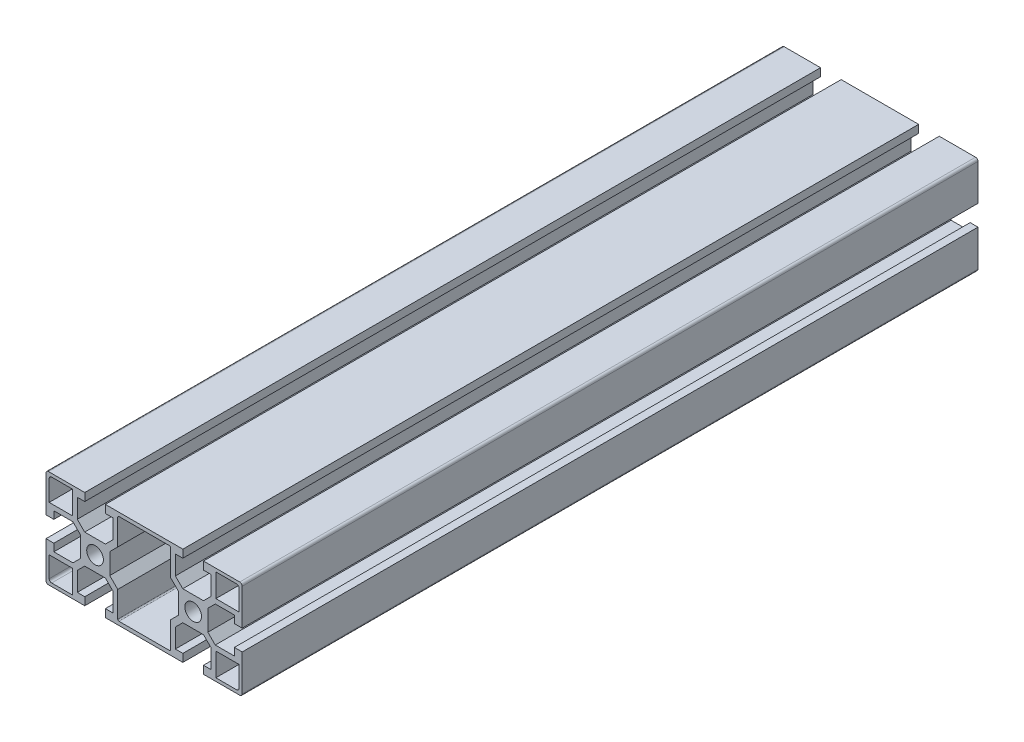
ISO-10303-21;
HEADER;
FILE_DESCRIPTION(('STEP AP214'),'2;1');
FILE_NAME('part.step','',(''),(''),'','','');
FILE_SCHEMA(('AUTOMOTIVE_DESIGN { 1 0 10303 214 1 1 1 1 }'));
ENDSEC;
DATA;
#1=APPLICATION_CONTEXT('core data for automotive mechanical design processes');
#2=APPLICATION_PROTOCOL_DEFINITION('international standard','automotive_design',2000,#1);
#3=PRODUCT_CONTEXT('',#1,'mechanical');
#4=PRODUCT('Part','Part','',(#3));
#5=PRODUCT_RELATED_PRODUCT_CATEGORY('part','',(#4));
#6=PRODUCT_DEFINITION_FORMATION('','',#4);
#7=PRODUCT_DEFINITION_CONTEXT('part definition',#1,'design');
#8=PRODUCT_DEFINITION('design','',#6,#7);
#9=PRODUCT_DEFINITION_SHAPE('','',#8);
#10=(LENGTH_UNIT() NAMED_UNIT(*) SI_UNIT(.MILLI.,.METRE.));
#11=(NAMED_UNIT(*) PLANE_ANGLE_UNIT() SI_UNIT($,.RADIAN.));
#12=(NAMED_UNIT(*) SI_UNIT($,.STERADIAN.) SOLID_ANGLE_UNIT());
#13=UNCERTAINTY_MEASURE_WITH_UNIT(LENGTH_MEASURE(1.E-05),#10,'distance_accuracy_value','');
#14=(GEOMETRIC_REPRESENTATION_CONTEXT(3) GLOBAL_UNCERTAINTY_ASSIGNED_CONTEXT((#13)) GLOBAL_UNIT_ASSIGNED_CONTEXT((#10,
#11,#12)) REPRESENTATION_CONTEXT('',''));
#15=CARTESIAN_POINT('',(0.,0.,0.));
#16=DIRECTION('',(0.,0.,1.));
#17=DIRECTION('',(1.,0.,0.));
#18=AXIS2_PLACEMENT_3D('',#15,#16,#17);
#19=CARTESIAN_POINT('',(38.9999999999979,-18.9999999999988,150.));
#20=DIRECTION('',(0.,0.,1.));
#21=DIRECTION('',(1.,0.,0.));
#22=AXIS2_PLACEMENT_3D('',#19,#20,#21);
#23=PLANE('',#22);
#24=CARTESIAN_POINT('',(20.0000000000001,7.70217223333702E-13,150.));
#25=DIRECTION('',(0.,0.,1.));
#26=DIRECTION('',(1.,0.,0.));
#27=AXIS2_PLACEMENT_3D('',#24,#25,#26);
#28=CIRCLE('',#27,3.39999999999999);
#29=CARTESIAN_POINT('',(23.4000000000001,7.70217223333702E-13,150.));
#30=VERTEX_POINT('',#29);
#31=EDGE_CURVE('E708',#30,#30,#28,.T.);
#32=ORIENTED_EDGE('',*,*,#31,.F.);
#33=EDGE_LOOP('',(#32));
#34=FACE_BOUND('',#33,.T.);
#35=DIRECTION('',(-1.,0.,0.));
#36=VECTOR('',#35,1.);
#37=CARTESIAN_POINT('',(37.7000000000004,18.7000000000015,150.));
#38=LINE('',#37,#36);
#39=CARTESIAN_POINT('',(37.7000000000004,18.7000000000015,150.));
#40=VERTEX_POINT('',#39);
#41=CARTESIAN_POINT('',(29.2500000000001,18.7000000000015,150.));
#42=VERTEX_POINT('',#41);
#43=EDGE_CURVE('E725',#40,#42,#38,.T.);
#44=ORIENTED_EDGE('',*,*,#43,.F.);
#45=CARTESIAN_POINT('',(37.7000000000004,17.7000000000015,150.));
#46=DIRECTION('',(0.,0.,1.));
#47=DIRECTION('',(1.,0.,0.));
#48=AXIS2_PLACEMENT_3D('',#45,#46,#47);
#49=CIRCLE('',#48,0.999999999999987);
#50=CARTESIAN_POINT('',(38.7000000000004,17.7000000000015,150.));
#51=VERTEX_POINT('',#50);
#52=EDGE_CURVE('E723',#51,#40,#49,.T.);
#53=ORIENTED_EDGE('',*,*,#52,.F.);
#54=DIRECTION('',(0.,1.,0.));
#55=VECTOR('',#54,1.);
#56=CARTESIAN_POINT('',(38.7000000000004,9.25000000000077,150.));
#57=LINE('',#56,#55);
#58=CARTESIAN_POINT('',(38.7000000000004,9.25000000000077,150.));
#59=VERTEX_POINT('',#58);
#60=EDGE_CURVE('E733',#59,#51,#57,.T.);
#61=ORIENTED_EDGE('',*,*,#60,.F.);
#62=DIRECTION('',(1.,0.,0.));
#63=VECTOR('',#62,1.);
#64=CARTESIAN_POINT('',(29.2500000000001,9.25000000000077,150.));
#65=LINE('',#64,#63);
#66=CARTESIAN_POINT('',(29.2500000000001,9.25000000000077,150.));
#67=VERTEX_POINT('',#66);
#68=EDGE_CURVE('E730',#67,#59,#65,.T.);
#69=ORIENTED_EDGE('',*,*,#68,.F.);
#70=DIRECTION('',(0.,-1.,0.));
#71=VECTOR('',#70,1.);
#72=CARTESIAN_POINT('',(29.2500000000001,18.7000000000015,150.));
#73=LINE('',#72,#71);
#74=EDGE_CURVE('E728',#42,#67,#73,.T.);
#75=ORIENTED_EDGE('',*,*,#74,.F.);
#76=EDGE_LOOP('',(#44,#53,#61,#69,#75));
#77=FACE_BOUND('',#76,.T.);
#78=DIRECTION('',(-1.,0.,0.));
#79=VECTOR('',#78,1.);
#80=CARTESIAN_POINT('',(10.2500000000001,18.5000000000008,150.));
#81=LINE('',#80,#79);
#82=CARTESIAN_POINT('',(10.2500000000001,18.5000000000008,150.));
#83=VERTEX_POINT('',#82);
#84=CARTESIAN_POINT('',(-10.2499999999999,18.5000000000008,150.));
#85=VERTEX_POINT('',#84);
#86=EDGE_CURVE('E801',#83,#85,#81,.T.);
#87=ORIENTED_EDGE('',*,*,#86,.F.);
#88=CARTESIAN_POINT('',(10.2500000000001,18.0000000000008,150.));
#89=DIRECTION('',(0.,0.,1.));
#90=DIRECTION('',(1.,0.,0.));
#91=AXIS2_PLACEMENT_3D('',#88,#89,#90);
#92=CIRCLE('',#91,0.499999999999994);
#93=CARTESIAN_POINT('',(10.7500000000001,18.0000000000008,150.));
#94=VERTEX_POINT('',#93);
#95=EDGE_CURVE('E799',#94,#83,#92,.T.);
#96=ORIENTED_EDGE('',*,*,#95,.F.);
#97=DIRECTION('',(0.,1.,0.));
#98=VECTOR('',#97,1.);
#99=CARTESIAN_POINT('',(10.7500000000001,7.48223304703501,150.));
#100=LINE('',#99,#98);
#101=CARTESIAN_POINT('',(10.7500000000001,7.48223304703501,150.));
#102=VERTEX_POINT('',#101);
#103=EDGE_CURVE('E831',#102,#94,#100,.T.);
#104=ORIENTED_EDGE('',*,*,#103,.F.);
#105=DIRECTION('',(-0.707106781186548,0.707106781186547,0.));
#106=VECTOR('',#105,1.);
#107=CARTESIAN_POINT('',(14.0000000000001,4.23223304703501,150.));
#108=LINE('',#107,#106);
#109=CARTESIAN_POINT('',(14.0000000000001,4.23223304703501,150.));
#110=VERTEX_POINT('',#109);
#111=EDGE_CURVE('E828',#110,#102,#108,.T.);
#112=ORIENTED_EDGE('',*,*,#111,.F.);
#113=DIRECTION('',(0.,1.,0.));
#114=VECTOR('',#113,1.);
#115=CARTESIAN_POINT('',(14.0000000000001,-4.23223304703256,150.));
#116=LINE('',#115,#114);
#117=CARTESIAN_POINT('',(14.0000000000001,-4.23223304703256,150.));
#118=VERTEX_POINT('',#117);
#119=EDGE_CURVE('E826',#118,#110,#116,.T.);
#120=ORIENTED_EDGE('',*,*,#119,.F.);
#121=DIRECTION('',(0.707106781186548,0.707106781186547,0.));
#122=VECTOR('',#121,1.);
#123=CARTESIAN_POINT('',(10.7500000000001,-7.48223304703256,150.));
#124=LINE('',#123,#122);
#125=CARTESIAN_POINT('',(10.7500000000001,-7.48223304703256,150.));
#126=VERTEX_POINT('',#125);
#127=EDGE_CURVE('E824',#126,#118,#124,.T.);
#128=ORIENTED_EDGE('',*,*,#127,.F.);
#129=DIRECTION('',(0.,1.,0.));
#130=VECTOR('',#129,1.);
#131=CARTESIAN_POINT('',(10.7500000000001,-17.9999999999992,150.));
#132=LINE('',#131,#130);
#133=CARTESIAN_POINT('',(10.7500000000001,-17.9999999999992,150.));
#134=VERTEX_POINT('',#133);
#135=EDGE_CURVE('E822',#134,#126,#132,.T.);
#136=ORIENTED_EDGE('',*,*,#135,.F.);
#137=CARTESIAN_POINT('',(10.2500000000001,-17.9999999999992,150.));
#138=DIRECTION('',(0.,0.,1.));
#139=DIRECTION('',(1.,0.,0.));
#140=AXIS2_PLACEMENT_3D('',#137,#138,#139);
#141=CIRCLE('',#140,0.499999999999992);
#142=CARTESIAN_POINT('',(10.2500000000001,-18.4999999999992,150.));
#143=VERTEX_POINT('',#142);
#144=EDGE_CURVE('E820',#143,#134,#141,.T.);
#145=ORIENTED_EDGE('',*,*,#144,.F.);
#146=DIRECTION('',(1.,0.,0.));
#147=VECTOR('',#146,1.);
#148=CARTESIAN_POINT('',(-10.2499999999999,-18.4999999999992,150.));
#149=LINE('',#148,#147);
#150=CARTESIAN_POINT('',(-10.2499999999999,-18.4999999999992,150.));
#151=VERTEX_POINT('',#150);
#152=EDGE_CURVE('E818',#151,#143,#149,.T.);
#153=ORIENTED_EDGE('',*,*,#152,.F.);
#154=CARTESIAN_POINT('',(-10.2499999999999,-17.9999999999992,150.));
#155=DIRECTION('',(0.,0.,1.));
#156=DIRECTION('',(1.,0.,0.));
#157=AXIS2_PLACEMENT_3D('',#154,#155,#156);
#158=CIRCLE('',#157,0.499999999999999);
#159=CARTESIAN_POINT('',(-10.7499999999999,-17.9999999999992,150.));
#160=VERTEX_POINT('',#159);
#161=EDGE_CURVE('E816',#160,#151,#158,.T.);
#162=ORIENTED_EDGE('',*,*,#161,.F.);
#163=DIRECTION('',(0.,-1.,0.));
#164=VECTOR('',#163,1.);
#165=CARTESIAN_POINT('',(-10.7499999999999,-7.48223304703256,150.));
#166=LINE('',#165,#164);
#167=CARTESIAN_POINT('',(-10.7499999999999,-7.48223304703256,150.));
#168=VERTEX_POINT('',#167);
#169=EDGE_CURVE('E814',#168,#160,#166,.T.);
#170=ORIENTED_EDGE('',*,*,#169,.F.);
#171=DIRECTION('',(0.707106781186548,-0.707106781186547,0.));
#172=VECTOR('',#171,1.);
#173=CARTESIAN_POINT('',(-13.9999999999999,-4.23223304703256,150.));
#174=LINE('',#173,#172);
#175=CARTESIAN_POINT('',(-13.9999999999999,-4.23223304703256,150.));
#176=VERTEX_POINT('',#175);
#177=EDGE_CURVE('E812',#176,#168,#174,.T.);
#178=ORIENTED_EDGE('',*,*,#177,.F.);
#179=DIRECTION('',(0.,-1.,0.));
#180=VECTOR('',#179,1.);
#181=CARTESIAN_POINT('',(-13.9999999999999,4.23223304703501,150.));
#182=LINE('',#181,#180);
#183=CARTESIAN_POINT('',(-13.9999999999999,4.23223304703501,150.));
#184=VERTEX_POINT('',#183);
#185=EDGE_CURVE('E810',#184,#176,#182,.T.);
#186=ORIENTED_EDGE('',*,*,#185,.F.);
#187=DIRECTION('',(-0.707106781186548,-0.707106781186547,0.));
#188=VECTOR('',#187,1.);
#189=CARTESIAN_POINT('',(-10.7499999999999,7.48223304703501,150.));
#190=LINE('',#189,#188);
#191=CARTESIAN_POINT('',(-10.7499999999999,7.48223304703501,150.));
#192=VERTEX_POINT('',#191);
#193=EDGE_CURVE('E808',#192,#184,#190,.T.);
#194=ORIENTED_EDGE('',*,*,#193,.F.);
#195=DIRECTION('',(0.,-1.,0.));
#196=VECTOR('',#195,1.);
#197=CARTESIAN_POINT('',(-10.7499999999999,18.0000000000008,150.));
#198=LINE('',#197,#196);
#199=CARTESIAN_POINT('',(-10.7499999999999,18.0000000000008,150.));
#200=VERTEX_POINT('',#199);
#201=EDGE_CURVE('E806',#200,#192,#198,.T.);
#202=ORIENTED_EDGE('',*,*,#201,.F.);
#203=CARTESIAN_POINT('',(-10.2499999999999,18.0000000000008,150.));
#204=DIRECTION('',(0.,0.,1.));
#205=DIRECTION('',(1.,0.,0.));
#206=AXIS2_PLACEMENT_3D('',#203,#204,#205);
#207=CIRCLE('',#206,0.499999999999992);
#208=EDGE_CURVE('E804',#85,#200,#207,.T.);
#209=ORIENTED_EDGE('',*,*,#208,.F.);
#210=EDGE_LOOP('',(#87,#96,#104,#112,#120,#128,#136,#145,#153,#162,#170,#178,#186,#194,#202,#209));
#211=FACE_BOUND('',#210,.T.);
#212=DIRECTION('',(1.,0.,0.));
#213=VECTOR('',#212,1.);
#214=CARTESIAN_POINT('',(15.7677669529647,-5.99999999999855,150.));
#215=LINE('',#214,#213);
#216=CARTESIAN_POINT('',(15.7677669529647,-5.99999999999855,150.));
#217=VERTEX_POINT('',#216);
#218=CARTESIAN_POINT('',(24.2322330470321,-5.99999999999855,150.));
#219=VERTEX_POINT('',#218);
#220=EDGE_CURVE('E952',#217,#219,#215,.T.);
#221=ORIENTED_EDGE('',*,*,#220,.T.);
#222=DIRECTION('',(0.707106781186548,-0.707106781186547,0.));
#223=VECTOR('',#222,1.);
#224=CARTESIAN_POINT('',(24.2322330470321,-5.99999999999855,150.));
#225=LINE('',#224,#223);
#226=CARTESIAN_POINT('',(27.249999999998,-9.01776695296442,150.));
#227=VERTEX_POINT('',#226);
#228=EDGE_CURVE('E955',#219,#227,#225,.T.);
#229=ORIENTED_EDGE('',*,*,#228,.T.);
#230=DIRECTION('',(0.,-1.,0.));
#231=VECTOR('',#230,1.);
#232=CARTESIAN_POINT('',(27.249999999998,-9.01776695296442,150.));
#233=LINE('',#232,#231);
#234=CARTESIAN_POINT('',(27.249999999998,-16.799999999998,150.));
#235=VERTEX_POINT('',#234);
#236=EDGE_CURVE('E958',#227,#235,#233,.T.);
#237=ORIENTED_EDGE('',*,*,#236,.T.);
#238=DIRECTION('',(-1.,0.,0.));
#239=VECTOR('',#238,1.);
#240=CARTESIAN_POINT('',(27.249999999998,-16.799999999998,150.));
#241=LINE('',#240,#239);
#242=CARTESIAN_POINT('',(24.1999999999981,-16.799999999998,150.));
#243=VERTEX_POINT('',#242);
#244=EDGE_CURVE('E960',#235,#243,#241,.T.);
#245=ORIENTED_EDGE('',*,*,#244,.T.);
#246=DIRECTION('',(0.,-1.,0.));
#247=VECTOR('',#246,1.);
#248=CARTESIAN_POINT('',(24.1999999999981,-16.799999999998,150.));
#249=LINE('',#248,#247);
#250=CARTESIAN_POINT('',(24.1999999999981,-19.9999999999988,150.));
#251=VERTEX_POINT('',#250);
#252=EDGE_CURVE('E962',#243,#251,#249,.T.);
#253=ORIENTED_EDGE('',*,*,#252,.T.);
#254=DIRECTION('',(1.,0.,0.));
#255=VECTOR('',#254,1.);
#256=CARTESIAN_POINT('',(24.1999999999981,-19.9999999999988,150.));
#257=LINE('',#256,#255);
#258=CARTESIAN_POINT('',(38.9999999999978,-19.9999999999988,150.));
#259=VERTEX_POINT('',#258);
#260=EDGE_CURVE('E964',#251,#259,#257,.T.);
#261=ORIENTED_EDGE('',*,*,#260,.T.);
#262=CARTESIAN_POINT('',(38.9999999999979,-18.9999999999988,150.));
#263=DIRECTION('',(0.,0.,1.));
#264=DIRECTION('',(1.,0.,0.));
#265=AXIS2_PLACEMENT_3D('',#262,#263,#264);
#266=CIRCLE('',#265,0.99999999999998);
#267=CARTESIAN_POINT('',(39.9999999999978,-18.9999999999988,150.));
#268=VERTEX_POINT('',#267);
#269=EDGE_CURVE('E966',#259,#268,#266,.T.);
#270=ORIENTED_EDGE('',*,*,#269,.T.);
#271=DIRECTION('',(0.,1.,0.));
#272=VECTOR('',#271,1.);
#273=CARTESIAN_POINT('',(39.9999999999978,-18.9999999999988,150.));
#274=LINE('',#273,#272);
#275=CARTESIAN_POINT('',(39.9999999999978,-4.19999999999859,150.));
#276=VERTEX_POINT('',#275);
#277=EDGE_CURVE('E968',#268,#276,#274,.T.);
#278=ORIENTED_EDGE('',*,*,#277,.T.);
#279=DIRECTION('',(-1.,0.,0.));
#280=VECTOR('',#279,1.);
#281=CARTESIAN_POINT('',(39.9999999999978,-4.19999999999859,150.));
#282=LINE('',#281,#280);
#283=CARTESIAN_POINT('',(36.799999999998,-4.19999999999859,150.));
#284=VERTEX_POINT('',#283);
#285=EDGE_CURVE('E970',#276,#284,#282,.T.);
#286=ORIENTED_EDGE('',*,*,#285,.T.);
#287=DIRECTION('',(0.,-1.,0.));
#288=VECTOR('',#287,1.);
#289=CARTESIAN_POINT('',(36.799999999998,-4.19999999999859,150.));
#290=LINE('',#289,#288);
#291=CARTESIAN_POINT('',(36.799999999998,-7.24999999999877,150.));
#292=VERTEX_POINT('',#291);
#293=EDGE_CURVE('E972',#284,#292,#290,.T.);
#294=ORIENTED_EDGE('',*,*,#293,.T.);
#295=DIRECTION('',(-1.,0.,0.));
#296=VECTOR('',#295,1.);
#297=CARTESIAN_POINT('',(36.799999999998,-7.24999999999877,150.));
#298=LINE('',#297,#296);
#299=CARTESIAN_POINT('',(29.0177669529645,-7.24999999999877,150.));
#300=VERTEX_POINT('',#299);
#301=EDGE_CURVE('E974',#292,#300,#298,.T.);
#302=ORIENTED_EDGE('',*,*,#301,.T.);
#303=DIRECTION('',(-0.707106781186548,0.707106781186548,0.));
#304=VECTOR('',#303,1.);
#305=CARTESIAN_POINT('',(29.0177669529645,-7.24999999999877,150.));
#306=LINE('',#305,#304);
#307=CARTESIAN_POINT('',(25.9999999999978,-4.2322330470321,150.));
#308=VERTEX_POINT('',#307);
#309=EDGE_CURVE('E976',#300,#308,#306,.T.);
#310=ORIENTED_EDGE('',*,*,#309,.T.);
#311=DIRECTION('',(0.,1.,0.));
#312=VECTOR('',#311,1.);
#313=CARTESIAN_POINT('',(25.9999999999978,-4.2322330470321,150.));
#314=LINE('',#313,#312);
#315=CARTESIAN_POINT('',(25.9999999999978,4.23223304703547,150.));
#316=VERTEX_POINT('',#315);
#317=EDGE_CURVE('E978',#308,#316,#314,.T.);
#318=ORIENTED_EDGE('',*,*,#317,.T.);
#319=DIRECTION('',(0.707106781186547,0.707106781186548,0.));
#320=VECTOR('',#319,1.);
#321=CARTESIAN_POINT('',(25.9999999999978,4.23223304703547,150.));
#322=LINE('',#321,#320);
#323=CARTESIAN_POINT('',(29.017766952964,7.25000000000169,150.));
#324=VERTEX_POINT('',#323);
#325=EDGE_CURVE('E980',#316,#324,#322,.T.);
#326=ORIENTED_EDGE('',*,*,#325,.T.);
#327=DIRECTION('',(1.,0.,0.));
#328=VECTOR('',#327,1.);
#329=CARTESIAN_POINT('',(29.017766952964,7.25000000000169,150.));
#330=LINE('',#329,#328);
#331=CARTESIAN_POINT('',(36.7999999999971,7.25000000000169,150.));
#332=VERTEX_POINT('',#331);
#333=EDGE_CURVE('E982',#324,#332,#330,.T.);
#334=ORIENTED_EDGE('',*,*,#333,.T.);
#335=DIRECTION('',(0.,-1.,0.));
#336=VECTOR('',#335,1.);
#337=CARTESIAN_POINT('',(36.7999999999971,7.25000000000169,150.));
#338=LINE('',#337,#336);
#339=CARTESIAN_POINT('',(36.7999999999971,4.20000000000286,150.));
#340=VERTEX_POINT('',#339);
#341=EDGE_CURVE('E984',#332,#340,#338,.T.);
#342=ORIENTED_EDGE('',*,*,#341,.T.);
#343=DIRECTION('',(1.,0.,0.));
#344=VECTOR('',#343,1.);
#345=CARTESIAN_POINT('',(36.7999999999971,4.20000000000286,150.));
#346=LINE('',#345,#344);
#347=CARTESIAN_POINT('',(40.0000000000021,4.20000000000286,150.));
#348=VERTEX_POINT('',#347);
#349=EDGE_CURVE('E986',#340,#348,#346,.T.);
#350=ORIENTED_EDGE('',*,*,#349,.T.);
#351=DIRECTION('',(0.,1.,0.));
#352=VECTOR('',#351,1.);
#353=CARTESIAN_POINT('',(40.0000000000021,4.20000000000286,150.));
#354=LINE('',#353,#352);
#355=CARTESIAN_POINT('',(40.0000000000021,19.000000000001,150.));
#356=VERTEX_POINT('',#355);
#357=EDGE_CURVE('E988',#348,#356,#354,.T.);
#358=ORIENTED_EDGE('',*,*,#357,.T.);
#359=CARTESIAN_POINT('',(39.0000000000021,19.000000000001,150.));
#360=DIRECTION('',(0.,0.,1.));
#361=DIRECTION('',(1.,0.,0.));
#362=AXIS2_PLACEMENT_3D('',#359,#360,#361);
#363=CIRCLE('',#362,0.999999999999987);
#364=CARTESIAN_POINT('',(39.0000000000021,20.000000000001,150.));
#365=VERTEX_POINT('',#364);
#366=EDGE_CURVE('E990',#356,#365,#363,.T.);
#367=ORIENTED_EDGE('',*,*,#366,.T.);
#368=DIRECTION('',(-1.,0.,0.));
#369=VECTOR('',#368,1.);
#370=CARTESIAN_POINT('',(39.0000000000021,20.000000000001,150.));
#371=LINE('',#370,#369);
#372=CARTESIAN_POINT('',(24.2000000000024,20.000000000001,150.));
#373=VERTEX_POINT('',#372);
#374=EDGE_CURVE('E992',#365,#373,#371,.T.);
#375=ORIENTED_EDGE('',*,*,#374,.T.);
#376=DIRECTION('',(0.,-1.,0.));
#377=VECTOR('',#376,1.);
#378=CARTESIAN_POINT('',(24.2000000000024,20.000000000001,150.));
#379=LINE('',#378,#377);
#380=CARTESIAN_POINT('',(24.2000000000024,16.8000000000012,150.));
#381=VERTEX_POINT('',#380);
#382=EDGE_CURVE('E994',#373,#381,#379,.T.);
#383=ORIENTED_EDGE('',*,*,#382,.T.);
#384=DIRECTION('',(1.,0.,0.));
#385=VECTOR('',#384,1.);
#386=CARTESIAN_POINT('',(24.2000000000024,16.8000000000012,150.));
#387=LINE('',#386,#385);
#388=CARTESIAN_POINT('',(27.250000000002,16.8000000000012,150.));
#389=VERTEX_POINT('',#388);
#390=EDGE_CURVE('E996',#381,#389,#387,.T.);
#391=ORIENTED_EDGE('',*,*,#390,.T.);
#392=DIRECTION('',(0.,-1.,0.));
#393=VECTOR('',#392,1.);
#394=CARTESIAN_POINT('',(27.250000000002,16.8000000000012,150.));
#395=LINE('',#394,#393);
#396=CARTESIAN_POINT('',(27.250000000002,9.01776695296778,150.));
#397=VERTEX_POINT('',#396);
#398=EDGE_CURVE('E998',#389,#397,#395,.T.);
#399=ORIENTED_EDGE('',*,*,#398,.T.);
#400=DIRECTION('',(-0.707106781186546,-0.707106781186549,0.));
#401=VECTOR('',#400,1.);
#402=CARTESIAN_POINT('',(27.250000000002,9.01776695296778,150.));
#403=LINE('',#402,#401);
#404=CARTESIAN_POINT('',(24.2322330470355,6.00000000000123,150.));
#405=VERTEX_POINT('',#404);
#406=EDGE_CURVE('E1000',#397,#405,#403,.T.);
#407=ORIENTED_EDGE('',*,*,#406,.T.);
#408=DIRECTION('',(-1.,0.,0.));
#409=VECTOR('',#408,1.);
#410=CARTESIAN_POINT('',(24.2322330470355,6.00000000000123,150.));
#411=LINE('',#410,#409);
#412=CARTESIAN_POINT('',(15.7677669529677,6.00000000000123,150.));
#413=VERTEX_POINT('',#412);
#414=EDGE_CURVE('E1002',#405,#413,#411,.T.);
#415=ORIENTED_EDGE('',*,*,#414,.T.);
#416=DIRECTION('',(-0.707106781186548,0.707106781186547,0.));
#417=VECTOR('',#416,1.);
#418=CARTESIAN_POINT('',(15.7677669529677,6.00000000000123,150.));
#419=LINE('',#418,#417);
#420=CARTESIAN_POINT('',(12.7500000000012,9.01776695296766,150.));
#421=VERTEX_POINT('',#420);
#422=EDGE_CURVE('E1004',#413,#421,#419,.T.);
#423=ORIENTED_EDGE('',*,*,#422,.T.);
#424=DIRECTION('',(0.,1.,0.));
#425=VECTOR('',#424,1.);
#426=CARTESIAN_POINT('',(12.7500000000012,9.01776695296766,150.));
#427=LINE('',#426,#425);
#428=CARTESIAN_POINT('',(12.7500000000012,16.8000000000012,150.));
#429=VERTEX_POINT('',#428);
#430=EDGE_CURVE('E1006',#421,#429,#427,.T.);
#431=ORIENTED_EDGE('',*,*,#430,.T.);
#432=DIRECTION('',(1.,0.,0.));
#433=VECTOR('',#432,1.);
#434=CARTESIAN_POINT('',(12.7500000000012,16.8000000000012,150.));
#435=LINE('',#434,#433);
#436=CARTESIAN_POINT('',(15.8000000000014,16.8000000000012,150.));
#437=VERTEX_POINT('',#436);
#438=EDGE_CURVE('E1008',#429,#437,#435,.T.);
#439=ORIENTED_EDGE('',*,*,#438,.T.);
#440=DIRECTION('',(0.,1.,0.));
#441=VECTOR('',#440,1.);
#442=CARTESIAN_POINT('',(15.8000000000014,16.8000000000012,150.));
#443=LINE('',#442,#441);
#444=CARTESIAN_POINT('',(15.8000000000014,20.000000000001,150.));
#445=VERTEX_POINT('',#444);
#446=EDGE_CURVE('E1010',#437,#445,#443,.T.);
#447=ORIENTED_EDGE('',*,*,#446,.T.);
#448=DIRECTION('',(-1.,0.,0.));
#449=VECTOR('',#448,1.);
#450=CARTESIAN_POINT('',(15.8000000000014,20.000000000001,150.));
#451=LINE('',#450,#449);
#452=CARTESIAN_POINT('',(-15.7999999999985,20.000000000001,150.));
#453=VERTEX_POINT('',#452);
#454=EDGE_CURVE('E1012',#445,#453,#451,.T.);
#455=ORIENTED_EDGE('',*,*,#454,.T.);
#456=DIRECTION('',(0.,-1.,0.));
#457=VECTOR('',#456,1.);
#458=CARTESIAN_POINT('',(-15.7999999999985,20.000000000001,150.));
#459=LINE('',#458,#457);
#460=CARTESIAN_POINT('',(-15.7999999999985,16.8000000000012,150.));
#461=VERTEX_POINT('',#460);
#462=EDGE_CURVE('E1014',#453,#461,#459,.T.);
#463=ORIENTED_EDGE('',*,*,#462,.T.);
#464=DIRECTION('',(1.,0.,0.));
#465=VECTOR('',#464,1.);
#466=CARTESIAN_POINT('',(-15.7999999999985,16.8000000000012,150.));
#467=LINE('',#466,#465);
#468=CARTESIAN_POINT('',(-12.749999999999,16.8000000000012,150.));
#469=VERTEX_POINT('',#468);
#470=EDGE_CURVE('E1016',#461,#469,#467,.T.);
#471=ORIENTED_EDGE('',*,*,#470,.T.);
#472=DIRECTION('',(0.,-1.,0.));
#473=VECTOR('',#472,1.);
#474=CARTESIAN_POINT('',(-12.749999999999,16.8000000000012,150.));
#475=LINE('',#474,#473);
#476=CARTESIAN_POINT('',(-12.749999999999,9.01776695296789,150.));
#477=VERTEX_POINT('',#476);
#478=EDGE_CURVE('E1018',#469,#477,#475,.T.);
#479=ORIENTED_EDGE('',*,*,#478,.T.);
#480=DIRECTION('',(-0.707106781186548,-0.707106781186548,0.));
#481=VECTOR('',#480,1.);
#482=CARTESIAN_POINT('',(-12.749999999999,9.01776695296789,150.));
#483=LINE('',#482,#481);
#484=CARTESIAN_POINT('',(-15.7677669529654,6.00000000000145,150.));
#485=VERTEX_POINT('',#484);
#486=EDGE_CURVE('E1020',#477,#485,#483,.T.);
#487=ORIENTED_EDGE('',*,*,#486,.T.);
#488=DIRECTION('',(-1.,0.,0.));
#489=VECTOR('',#488,1.);
#490=CARTESIAN_POINT('',(-15.7677669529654,6.00000000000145,150.));
#491=LINE('',#490,#489);
#492=CARTESIAN_POINT('',(-24.2322330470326,6.00000000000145,150.));
#493=VERTEX_POINT('',#492);
#494=EDGE_CURVE('E1022',#485,#493,#491,.T.);
#495=ORIENTED_EDGE('',*,*,#494,.T.);
#496=DIRECTION('',(-0.707106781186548,0.707106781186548,0.));
#497=VECTOR('',#496,1.);
#498=CARTESIAN_POINT('',(-24.2322330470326,6.00000000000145,150.));
#499=LINE('',#498,#497);
#500=CARTESIAN_POINT('',(-27.2499999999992,9.01776695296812,150.));
#501=VERTEX_POINT('',#500);
#502=EDGE_CURVE('E1024',#493,#501,#499,.T.);
#503=ORIENTED_EDGE('',*,*,#502,.T.);
#504=DIRECTION('',(0.,1.,0.));
#505=VECTOR('',#504,1.);
#506=CARTESIAN_POINT('',(-27.2499999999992,9.01776695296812,150.));
#507=LINE('',#506,#505);
#508=CARTESIAN_POINT('',(-27.2499999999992,16.8000000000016,150.));
#509=VERTEX_POINT('',#508);
#510=EDGE_CURVE('E1026',#501,#509,#507,.T.);
#511=ORIENTED_EDGE('',*,*,#510,.T.);
#512=DIRECTION('',(1.,0.,0.));
#513=VECTOR('',#512,1.);
#514=CARTESIAN_POINT('',(-27.2499999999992,16.8000000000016,150.));
#515=LINE('',#514,#513);
#516=CARTESIAN_POINT('',(-24.199999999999,16.8000000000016,150.));
#517=VERTEX_POINT('',#516);
#518=EDGE_CURVE('E1028',#509,#517,#515,.T.);
#519=ORIENTED_EDGE('',*,*,#518,.T.);
#520=DIRECTION('',(0.,1.,0.));
#521=VECTOR('',#520,1.);
#522=CARTESIAN_POINT('',(-24.199999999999,16.8000000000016,150.));
#523=LINE('',#522,#521);
#524=CARTESIAN_POINT('',(-24.199999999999,20.0000000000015,150.));
#525=VERTEX_POINT('',#524);
#526=EDGE_CURVE('E1030',#517,#525,#523,.T.);
#527=ORIENTED_EDGE('',*,*,#526,.T.);
#528=DIRECTION('',(-1.,0.,0.));
#529=VECTOR('',#528,1.);
#530=CARTESIAN_POINT('',(-24.199999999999,20.0000000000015,150.));
#531=LINE('',#530,#529);
#532=CARTESIAN_POINT('',(-38.9999999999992,20.0000000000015,150.));
#533=VERTEX_POINT('',#532);
#534=EDGE_CURVE('E1032',#525,#533,#531,.T.);
#535=ORIENTED_EDGE('',*,*,#534,.T.);
#536=CARTESIAN_POINT('',(-38.9999999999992,19.0000000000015,150.));
#537=DIRECTION('',(0.,0.,1.));
#538=DIRECTION('',(1.,0.,0.));
#539=AXIS2_PLACEMENT_3D('',#536,#537,#538);
#540=CIRCLE('',#539,0.999999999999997);
#541=CARTESIAN_POINT('',(-39.9999999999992,19.0000000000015,150.));
#542=VERTEX_POINT('',#541);
#543=EDGE_CURVE('E1034',#533,#542,#540,.T.);
#544=ORIENTED_EDGE('',*,*,#543,.T.);
#545=DIRECTION('',(0.,-1.,0.));
#546=VECTOR('',#545,1.);
#547=CARTESIAN_POINT('',(-39.9999999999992,19.0000000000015,150.));
#548=LINE('',#547,#546);
#549=CARTESIAN_POINT('',(-39.9999999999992,4.20000000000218,150.));
#550=VERTEX_POINT('',#549);
#551=EDGE_CURVE('E1036',#542,#550,#548,.T.);
#552=ORIENTED_EDGE('',*,*,#551,.T.);
#553=DIRECTION('',(1.,0.,0.));
#554=VECTOR('',#553,1.);
#555=CARTESIAN_POINT('',(-39.9999999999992,4.20000000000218,150.));
#556=LINE('',#555,#554);
#557=CARTESIAN_POINT('',(-36.7999999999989,4.20000000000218,150.));
#558=VERTEX_POINT('',#557);
#559=EDGE_CURVE('E1038',#550,#558,#556,.T.);
#560=ORIENTED_EDGE('',*,*,#559,.T.);
#561=DIRECTION('',(-2.22954623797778E-13,1.,0.));
#562=VECTOR('',#561,1.);
#563=CARTESIAN_POINT('',(-36.7999999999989,4.20000000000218,150.));
#564=LINE('',#563,#562);
#565=CARTESIAN_POINT('',(-36.7999999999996,7.25000000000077,150.));
#566=VERTEX_POINT('',#565);
#567=EDGE_CURVE('E1040',#558,#566,#564,.T.);
#568=ORIENTED_EDGE('',*,*,#567,.T.);
#569=DIRECTION('',(1.,0.,0.));
#570=VECTOR('',#569,1.);
#571=CARTESIAN_POINT('',(-36.7999999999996,7.25000000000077,150.));
#572=LINE('',#571,#570);
#573=CARTESIAN_POINT('',(-29.0177669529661,7.25000000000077,150.));
#574=VERTEX_POINT('',#573);
#575=EDGE_CURVE('E1042',#566,#574,#572,.T.);
#576=ORIENTED_EDGE('',*,*,#575,.T.);
#577=DIRECTION('',(0.707106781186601,-0.707106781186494,0.));
#578=VECTOR('',#577,1.);
#579=CARTESIAN_POINT('',(-29.0177669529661,7.25000000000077,150.));
#580=LINE('',#579,#578);
#581=CARTESIAN_POINT('',(-25.9999999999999,4.23223304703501,150.));
#582=VERTEX_POINT('',#581);
#583=EDGE_CURVE('E1044',#574,#582,#580,.T.);
#584=ORIENTED_EDGE('',*,*,#583,.T.);
#585=DIRECTION('',(0.,-1.,0.));
#586=VECTOR('',#585,1.);
#587=CARTESIAN_POINT('',(-25.9999999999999,4.23223304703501,150.));
#588=LINE('',#587,#586);
#589=CARTESIAN_POINT('',(-25.9999999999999,-4.23223304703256,150.));
#590=VERTEX_POINT('',#589);
#591=EDGE_CURVE('E1046',#582,#590,#588,.T.);
#592=ORIENTED_EDGE('',*,*,#591,.T.);
#593=DIRECTION('',(-0.707106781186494,-0.707106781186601,0.));
#594=VECTOR('',#593,1.);
#595=CARTESIAN_POINT('',(-25.9999999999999,-4.23223304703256,150.));
#596=LINE('',#595,#594);
#597=CARTESIAN_POINT('',(-29.0177669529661,-7.24999999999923,150.));
#598=VERTEX_POINT('',#597);
#599=EDGE_CURVE('E1048',#590,#598,#596,.T.);
#600=ORIENTED_EDGE('',*,*,#599,.T.);
#601=DIRECTION('',(-1.,0.,0.));
#602=VECTOR('',#601,1.);
#603=CARTESIAN_POINT('',(-29.0177669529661,-7.24999999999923,150.));
#604=LINE('',#603,#602);
#605=CARTESIAN_POINT('',(-36.7999999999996,-7.24999999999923,150.));
#606=VERTEX_POINT('',#605);
#607=EDGE_CURVE('E1050',#598,#606,#604,.T.);
#608=ORIENTED_EDGE('',*,*,#607,.T.);
#609=DIRECTION('',(0.,1.,0.));
#610=VECTOR('',#609,1.);
#611=CARTESIAN_POINT('',(-36.7999999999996,-7.24999999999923,150.));
#612=LINE('',#611,#610);
#613=CARTESIAN_POINT('',(-36.7999999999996,-4.19999999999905,150.));
#614=VERTEX_POINT('',#613);
#615=EDGE_CURVE('E1052',#606,#614,#612,.T.);
#616=ORIENTED_EDGE('',*,*,#615,.T.);
#617=DIRECTION('',(-1.,0.,0.));
#618=VECTOR('',#617,1.);
#619=CARTESIAN_POINT('',(-36.7999999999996,-4.19999999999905,150.));
#620=LINE('',#619,#618);
#621=CARTESIAN_POINT('',(-39.9999999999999,-4.19999999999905,150.));
#622=VERTEX_POINT('',#621);
#623=EDGE_CURVE('E1054',#614,#622,#620,.T.);
#624=ORIENTED_EDGE('',*,*,#623,.T.);
#625=DIRECTION('',(0.,-1.,0.));
#626=VECTOR('',#625,1.);
#627=CARTESIAN_POINT('',(-39.9999999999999,-4.19999999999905,150.));
#628=LINE('',#627,#626);
#629=CARTESIAN_POINT('',(-39.9999999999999,-18.9999999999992,150.));
#630=VERTEX_POINT('',#629);
#631=EDGE_CURVE('E1056',#622,#630,#628,.T.);
#632=ORIENTED_EDGE('',*,*,#631,.T.);
#633=CARTESIAN_POINT('',(-38.9999999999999,-18.9999999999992,150.));
#634=DIRECTION('',(0.,0.,1.));
#635=DIRECTION('',(1.,0.,0.));
#636=AXIS2_PLACEMENT_3D('',#633,#634,#635);
#637=CIRCLE('',#636,1.);
#638=CARTESIAN_POINT('',(-38.9999999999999,-19.9999999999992,150.));
#639=VERTEX_POINT('',#638);
#640=EDGE_CURVE('E1058',#630,#639,#637,.T.);
#641=ORIENTED_EDGE('',*,*,#640,.T.);
#642=DIRECTION('',(1.,0.,0.));
#643=VECTOR('',#642,1.);
#644=CARTESIAN_POINT('',(-38.9999999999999,-19.9999999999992,150.));
#645=LINE('',#644,#643);
#646=CARTESIAN_POINT('',(-24.1999999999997,-19.9999999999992,150.));
#647=VERTEX_POINT('',#646);
#648=EDGE_CURVE('E1060',#639,#647,#645,.T.);
#649=ORIENTED_EDGE('',*,*,#648,.T.);
#650=DIRECTION('',(0.,1.,0.));
#651=VECTOR('',#650,1.);
#652=CARTESIAN_POINT('',(-24.1999999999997,-19.9999999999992,150.));
#653=LINE('',#652,#651);
#654=CARTESIAN_POINT('',(-24.1999999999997,-16.7999999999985,150.));
#655=VERTEX_POINT('',#654);
#656=EDGE_CURVE('E1062',#647,#655,#653,.T.);
#657=ORIENTED_EDGE('',*,*,#656,.T.);
#658=DIRECTION('',(-1.,0.,0.));
#659=VECTOR('',#658,1.);
#660=CARTESIAN_POINT('',(-24.1999999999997,-16.7999999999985,150.));
#661=LINE('',#660,#659);
#662=CARTESIAN_POINT('',(-27.2499999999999,-16.7999999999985,150.));
#663=VERTEX_POINT('',#662);
#664=EDGE_CURVE('E1064',#655,#663,#661,.T.);
#665=ORIENTED_EDGE('',*,*,#664,.T.);
#666=DIRECTION('',(0.,1.,0.));
#667=VECTOR('',#666,1.);
#668=CARTESIAN_POINT('',(-27.2499999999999,-16.7999999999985,150.));
#669=LINE('',#668,#667);
#670=CARTESIAN_POINT('',(-27.2499999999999,-9.01776695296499,150.));
#671=VERTEX_POINT('',#670);
#672=EDGE_CURVE('E1066',#663,#671,#669,.T.);
#673=ORIENTED_EDGE('',*,*,#672,.T.);
#674=DIRECTION('',(0.707106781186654,0.707106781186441,0.));
#675=VECTOR('',#674,1.);
#676=CARTESIAN_POINT('',(-27.2499999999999,-9.01776695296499,150.));
#677=LINE('',#676,#675);
#678=CARTESIAN_POINT('',(-24.2322330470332,-5.99999999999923,150.));
#679=VERTEX_POINT('',#678);
#680=EDGE_CURVE('E1068',#671,#679,#677,.T.);
#681=ORIENTED_EDGE('',*,*,#680,.T.);
#682=DIRECTION('',(1.,0.,0.));
#683=VECTOR('',#682,1.);
#684=CARTESIAN_POINT('',(-24.2322330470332,-5.99999999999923,150.));
#685=LINE('',#684,#683);
#686=CARTESIAN_POINT('',(-15.767766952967,-5.99999999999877,150.));
#687=VERTEX_POINT('',#686);
#688=EDGE_CURVE('E1070',#679,#687,#685,.T.);
#689=ORIENTED_EDGE('',*,*,#688,.T.);
#690=DIRECTION('',(0.707106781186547,-0.707106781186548,0.));
#691=VECTOR('',#690,1.);
#692=CARTESIAN_POINT('',(-15.767766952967,-5.99999999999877,150.));
#693=LINE('',#692,#691);
#694=CARTESIAN_POINT('',(-12.7500000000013,-9.01776695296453,150.));
#695=VERTEX_POINT('',#694);
#696=EDGE_CURVE('E1072',#687,#695,#693,.T.);
#697=ORIENTED_EDGE('',*,*,#696,.T.);
#698=DIRECTION('',(0.,-1.,0.));
#699=VECTOR('',#698,1.);
#700=CARTESIAN_POINT('',(-12.7500000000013,-9.01776695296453,150.));
#701=LINE('',#700,#699);
#702=CARTESIAN_POINT('',(-12.7500000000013,-16.799999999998,150.));
#703=VERTEX_POINT('',#702);
#704=EDGE_CURVE('E1074',#695,#703,#701,.T.);
#705=ORIENTED_EDGE('',*,*,#704,.T.);
#706=DIRECTION('',(-1.,0.,0.));
#707=VECTOR('',#706,1.);
#708=CARTESIAN_POINT('',(-12.7500000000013,-16.799999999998,150.));
#709=LINE('',#708,#707);
#710=CARTESIAN_POINT('',(-15.800000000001,-16.799999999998,150.));
#711=VERTEX_POINT('',#710);
#712=EDGE_CURVE('E1076',#703,#711,#709,.T.);
#713=ORIENTED_EDGE('',*,*,#712,.T.);
#714=DIRECTION('',(0.,-1.,0.));
#715=VECTOR('',#714,1.);
#716=CARTESIAN_POINT('',(-15.800000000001,-16.799999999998,150.));
#717=LINE('',#716,#715);
#718=CARTESIAN_POINT('',(-15.800000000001,-19.9999999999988,150.));
#719=VERTEX_POINT('',#718);
#720=EDGE_CURVE('E1078',#711,#719,#717,.T.);
#721=ORIENTED_EDGE('',*,*,#720,.T.);
#722=DIRECTION('',(1.,0.,0.));
#723=VECTOR('',#722,1.);
#724=CARTESIAN_POINT('',(-15.800000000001,-19.9999999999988,150.));
#725=LINE('',#724,#723);
#726=CARTESIAN_POINT('',(15.7999999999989,-19.9999999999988,150.));
#727=VERTEX_POINT('',#726);
#728=EDGE_CURVE('E1080',#719,#727,#725,.T.);
#729=ORIENTED_EDGE('',*,*,#728,.T.);
#730=DIRECTION('',(0.,1.,0.));
#731=VECTOR('',#730,1.);
#732=CARTESIAN_POINT('',(15.7999999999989,-19.9999999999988,150.));
#733=LINE('',#732,#731);
#734=CARTESIAN_POINT('',(15.7999999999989,-16.799999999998,150.));
#735=VERTEX_POINT('',#734);
#736=EDGE_CURVE('E1082',#727,#735,#733,.T.);
#737=ORIENTED_EDGE('',*,*,#736,.T.);
#738=DIRECTION('',(-1.,0.,0.));
#739=VECTOR('',#738,1.);
#740=CARTESIAN_POINT('',(15.7999999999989,-16.799999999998,150.));
#741=LINE('',#740,#739);
#742=CARTESIAN_POINT('',(12.7499999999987,-16.799999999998,150.));
#743=VERTEX_POINT('',#742);
#744=EDGE_CURVE('E1084',#735,#743,#741,.T.);
#745=ORIENTED_EDGE('',*,*,#744,.T.);
#746=DIRECTION('',(0.,1.,0.));
#747=VECTOR('',#746,1.);
#748=CARTESIAN_POINT('',(12.7499999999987,-16.799999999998,150.));
#749=LINE('',#748,#747);
#750=CARTESIAN_POINT('',(12.7499999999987,-9.01776695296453,150.));
#751=VERTEX_POINT('',#750);
#752=EDGE_CURVE('E1086',#743,#751,#749,.T.);
#753=ORIENTED_EDGE('',*,*,#752,.T.);
#754=DIRECTION('',(0.707106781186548,0.707106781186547,0.));
#755=VECTOR('',#754,1.);
#756=CARTESIAN_POINT('',(12.7499999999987,-9.01776695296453,150.));
#757=LINE('',#756,#755);
#758=EDGE_CURVE('E1088',#751,#217,#757,.T.);
#759=ORIENTED_EDGE('',*,*,#758,.T.);
#760=EDGE_LOOP('',(#221,#229,#237,#245,#253,#261,#270,#278,#286,#294,#302,#310,#318,#326,#334,
#342,#350,#358,#367,#375,#383,#391,#399,#407,#415,#423,#431,#439,#447,#455,#463,#471,#479,#487,
#495,#503,#511,#519,#527,#535,#544,#552,#560,#568,#576,#584,#592,#600,#608,#616,#624,#632,#641,
#649,#657,#665,#673,#681,#689,#697,#705,#713,#721,#729,#737,#745,#753,#759));
#761=FACE_BOUND('',#760,.T.);
#762=DIRECTION('',(1.,0.,0.));
#763=VECTOR('',#762,1.);
#764=CARTESIAN_POINT('',(-37.6999999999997,-18.699999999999,150.));
#765=LINE('',#764,#763);
#766=CARTESIAN_POINT('',(-37.6999999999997,-18.699999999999,150.));
#767=VERTEX_POINT('',#766);
#768=CARTESIAN_POINT('',(-29.2499999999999,-18.699999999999,150.));
#769=VERTEX_POINT('',#768);
#770=EDGE_CURVE('E916',#767,#769,#765,.T.);
#771=ORIENTED_EDGE('',*,*,#770,.F.);
#772=CARTESIAN_POINT('',(-37.6999999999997,-17.699999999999,150.));
#773=DIRECTION('',(0.,0.,1.));
#774=DIRECTION('',(1.,0.,0.));
#775=AXIS2_PLACEMENT_3D('',#772,#773,#774);
#776=CIRCLE('',#775,1.);
#777=CARTESIAN_POINT('',(-38.6999999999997,-17.699999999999,150.));
#778=VERTEX_POINT('',#777);
#779=EDGE_CURVE('E914',#778,#767,#776,.T.);
#780=ORIENTED_EDGE('',*,*,#779,.F.);
#781=DIRECTION('',(0.,-1.,0.));
#782=VECTOR('',#781,1.);
#783=CARTESIAN_POINT('',(-38.6999999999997,-9.24999999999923,150.));
#784=LINE('',#783,#782);
#785=CARTESIAN_POINT('',(-38.6999999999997,-9.24999999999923,150.));
#786=VERTEX_POINT('',#785);
#787=EDGE_CURVE('E924',#786,#778,#784,.T.);
#788=ORIENTED_EDGE('',*,*,#787,.F.);
#789=DIRECTION('',(-1.,0.,0.));
#790=VECTOR('',#789,1.);
#791=CARTESIAN_POINT('',(-29.2499999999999,-9.24999999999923,150.));
#792=LINE('',#791,#790);
#793=CARTESIAN_POINT('',(-29.2499999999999,-9.24999999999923,150.));
#794=VERTEX_POINT('',#793);
#795=EDGE_CURVE('E921',#794,#786,#792,.T.);
#796=ORIENTED_EDGE('',*,*,#795,.F.);
#797=DIRECTION('',(0.,1.,0.));
#798=VECTOR('',#797,1.);
#799=CARTESIAN_POINT('',(-29.2499999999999,-18.699999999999,150.));
#800=LINE('',#799,#798);
#801=EDGE_CURVE('E919',#769,#794,#800,.T.);
#802=ORIENTED_EDGE('',*,*,#801,.F.);
#803=EDGE_LOOP('',(#771,#780,#788,#796,#802));
#804=FACE_BOUND('',#803,.T.);
#805=DIRECTION('',(0.,1.,0.));
#806=VECTOR('',#805,1.);
#807=CARTESIAN_POINT('',(38.7000000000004,-17.699999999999,150.));
#808=LINE('',#807,#806);
#809=CARTESIAN_POINT('',(38.7000000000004,-17.699999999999,150.));
#810=VERTEX_POINT('',#809);
#811=CARTESIAN_POINT('',(38.7000000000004,-9.24999999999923,150.));
#812=VERTEX_POINT('',#811);
#813=EDGE_CURVE('E763',#810,#812,#808,.T.);
#814=ORIENTED_EDGE('',*,*,#813,.F.);
#815=CARTESIAN_POINT('',(37.7000000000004,-17.6999999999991,150.));
#816=DIRECTION('',(0.,0.,1.));
#817=DIRECTION('',(1.,0.,0.));
#818=AXIS2_PLACEMENT_3D('',#815,#816,#817);
#819=CIRCLE('',#818,0.999999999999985);
#820=CARTESIAN_POINT('',(37.7000000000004,-18.699999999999,150.));
#821=VERTEX_POINT('',#820);
#822=EDGE_CURVE('E761',#821,#810,#819,.T.);
#823=ORIENTED_EDGE('',*,*,#822,.F.);
#824=DIRECTION('',(1.,0.,0.));
#825=VECTOR('',#824,1.);
#826=CARTESIAN_POINT('',(29.2500000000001,-18.699999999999,150.));
#827=LINE('',#826,#825);
#828=CARTESIAN_POINT('',(29.2500000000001,-18.699999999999,150.));
#829=VERTEX_POINT('',#828);
#830=EDGE_CURVE('E771',#829,#821,#827,.T.);
#831=ORIENTED_EDGE('',*,*,#830,.F.);
#832=DIRECTION('',(0.,-1.,0.));
#833=VECTOR('',#832,1.);
#834=CARTESIAN_POINT('',(29.2500000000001,-9.24999999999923,150.));
#835=LINE('',#834,#833);
#836=CARTESIAN_POINT('',(29.2500000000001,-9.24999999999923,150.));
#837=VERTEX_POINT('',#836);
#838=EDGE_CURVE('E768',#837,#829,#835,.T.);
#839=ORIENTED_EDGE('',*,*,#838,.F.);
#840=DIRECTION('',(-1.,0.,0.));
#841=VECTOR('',#840,1.);
#842=CARTESIAN_POINT('',(38.7000000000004,-9.24999999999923,150.));
#843=LINE('',#842,#841);
#844=EDGE_CURVE('E766',#812,#837,#843,.T.);
#845=ORIENTED_EDGE('',*,*,#844,.F.);
#846=EDGE_LOOP('',(#814,#823,#831,#839,#845));
#847=FACE_BOUND('',#846,.T.);
#848=DIRECTION('',(0.,-1.,0.));
#849=VECTOR('',#848,1.);
#850=CARTESIAN_POINT('',(-38.6999999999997,17.7000000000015,150.));
#851=LINE('',#850,#849);
#852=CARTESIAN_POINT('',(-38.6999999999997,17.7000000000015,150.));
#853=VERTEX_POINT('',#852);
#854=CARTESIAN_POINT('',(-38.6999999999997,9.25000000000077,150.));
#855=VERTEX_POINT('',#854);
#856=EDGE_CURVE('E684',#853,#855,#851,.T.);
#857=ORIENTED_EDGE('',*,*,#856,.F.);
#858=CARTESIAN_POINT('',(-37.6999999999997,17.7000000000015,150.));
#859=DIRECTION('',(0.,0.,1.));
#860=DIRECTION('',(1.,0.,0.));
#861=AXIS2_PLACEMENT_3D('',#858,#859,#860);
#862=CIRCLE('',#861,1.);
#863=CARTESIAN_POINT('',(-37.6999999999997,18.7000000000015,150.));
#864=VERTEX_POINT('',#863);
#865=EDGE_CURVE('E676',#864,#853,#862,.T.);
#866=ORIENTED_EDGE('',*,*,#865,.F.);
#867=DIRECTION('',(-1.,0.,0.));
#868=VECTOR('',#867,1.);
#869=CARTESIAN_POINT('',(-29.2499999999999,18.7000000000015,150.));
#870=LINE('',#869,#868);
#871=CARTESIAN_POINT('',(-29.2499999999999,18.7000000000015,150.));
#872=VERTEX_POINT('',#871);
#873=EDGE_CURVE('E705',#872,#864,#870,.T.);
#874=ORIENTED_EDGE('',*,*,#873,.F.);
#875=DIRECTION('',(0.,1.,0.));
#876=VECTOR('',#875,1.);
#877=CARTESIAN_POINT('',(-29.2499999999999,9.25000000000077,150.));
#878=LINE('',#877,#876);
#879=CARTESIAN_POINT('',(-29.2499999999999,9.25000000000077,150.));
#880=VERTEX_POINT('',#879);
#881=EDGE_CURVE('E700',#880,#872,#878,.T.);
#882=ORIENTED_EDGE('',*,*,#881,.F.);
#883=DIRECTION('',(1.,0.,0.));
#884=VECTOR('',#883,1.);
#885=CARTESIAN_POINT('',(-38.6999999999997,9.25000000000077,150.));
#886=LINE('',#885,#884);
#887=EDGE_CURVE('E698',#855,#880,#886,.T.);
#888=ORIENTED_EDGE('',*,*,#887,.F.);
#889=EDGE_LOOP('',(#857,#866,#874,#882,#888));
#890=FACE_BOUND('',#889,.T.);
#891=CARTESIAN_POINT('',(-19.9999999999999,7.70217223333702E-13,150.));
#892=DIRECTION('',(0.,0.,1.));
#893=DIRECTION('',(1.,0.,0.));
#894=AXIS2_PLACEMENT_3D('',#891,#892,#893);
#895=CIRCLE('',#894,3.4);
#896=CARTESIAN_POINT('',(-16.5999999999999,7.70217223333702E-13,150.));
#897=VERTEX_POINT('',#896);
#898=EDGE_CURVE('E2705',#897,#897,#895,.T.);
#899=ORIENTED_EDGE('',*,*,#898,.F.);
#900=EDGE_LOOP('',(#899));
#901=FACE_BOUND('',#900,.T.);
#902=ADVANCED_FACE('F35',(#34,#77,#211,#761,#804,#847,#890,#901),#23,.T.);
#903=CARTESIAN_POINT('',(38.9999999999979,-18.9999999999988,-150.));
#904=DIRECTION('',(0.,0.,1.));
#905=DIRECTION('',(1.,0.,0.));
#906=AXIS2_PLACEMENT_3D('',#903,#904,#905);
#907=PLANE('',#906);
#908=CARTESIAN_POINT('',(20.0000000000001,7.70217223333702E-13,-150.));
#909=DIRECTION('',(0.,0.,1.));
#910=DIRECTION('',(1.,0.,0.));
#911=AXIS2_PLACEMENT_3D('',#908,#909,#910);
#912=CIRCLE('',#911,3.39999999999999);
#913=CARTESIAN_POINT('',(23.4000000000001,7.70217223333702E-13,-150.));
#914=VERTEX_POINT('',#913);
#915=EDGE_CURVE('E2711',#914,#914,#912,.T.);
#916=ORIENTED_EDGE('',*,*,#915,.T.);
#917=EDGE_LOOP('',(#916));
#918=FACE_BOUND('',#917,.T.);
#919=CARTESIAN_POINT('',(37.7000000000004,17.7000000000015,-150.));
#920=DIRECTION('',(0.,0.,1.));
#921=DIRECTION('',(1.,0.,0.));
#922=AXIS2_PLACEMENT_3D('',#919,#920,#921);
#923=CIRCLE('',#922,0.999999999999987);
#924=CARTESIAN_POINT('',(38.7000000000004,17.7000000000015,-150.));
#925=VERTEX_POINT('',#924);
#926=CARTESIAN_POINT('',(37.7000000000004,18.7000000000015,-150.));
#927=VERTEX_POINT('',#926);
#928=EDGE_CURVE('E692',#925,#927,#923,.T.);
#929=ORIENTED_EDGE('',*,*,#928,.T.);
#930=DIRECTION('',(-1.,0.,0.));
#931=VECTOR('',#930,1.);
#932=CARTESIAN_POINT('',(37.7000000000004,18.7000000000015,-150.));
#933=LINE('',#932,#931);
#934=CARTESIAN_POINT('',(29.2500000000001,18.7000000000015,-150.));
#935=VERTEX_POINT('',#934);
#936=EDGE_CURVE('E738',#927,#935,#933,.T.);
#937=ORIENTED_EDGE('',*,*,#936,.T.);
#938=DIRECTION('',(0.,-1.,0.));
#939=VECTOR('',#938,1.);
#940=CARTESIAN_POINT('',(29.2500000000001,18.7000000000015,-150.));
#941=LINE('',#940,#939);
#942=CARTESIAN_POINT('',(29.2500000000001,9.25000000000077,-150.));
#943=VERTEX_POINT('',#942);
#944=EDGE_CURVE('E741',#935,#943,#941,.T.);
#945=ORIENTED_EDGE('',*,*,#944,.T.);
#946=DIRECTION('',(1.,0.,0.));
#947=VECTOR('',#946,1.);
#948=CARTESIAN_POINT('',(29.2500000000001,9.25000000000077,-150.));
#949=LINE('',#948,#947);
#950=CARTESIAN_POINT('',(38.7000000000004,9.25000000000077,-150.));
#951=VERTEX_POINT('',#950);
#952=EDGE_CURVE('E744',#943,#951,#949,.T.);
#953=ORIENTED_EDGE('',*,*,#952,.T.);
#954=DIRECTION('',(0.,1.,0.));
#955=VECTOR('',#954,1.);
#956=CARTESIAN_POINT('',(38.7000000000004,9.25000000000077,-150.));
#957=LINE('',#956,#955);
#958=EDGE_CURVE('E726',#951,#925,#957,.T.);
#959=ORIENTED_EDGE('',*,*,#958,.T.);
#960=EDGE_LOOP('',(#929,#937,#945,#953,#959));
#961=FACE_BOUND('',#960,.T.);
#962=CARTESIAN_POINT('',(10.2500000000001,18.0000000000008,-150.));
#963=DIRECTION('',(0.,0.,1.));
#964=DIRECTION('',(1.,0.,0.));
#965=AXIS2_PLACEMENT_3D('',#962,#963,#964);
#966=CIRCLE('',#965,0.499999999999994);
#967=CARTESIAN_POINT('',(10.7500000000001,18.0000000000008,-150.));
#968=VERTEX_POINT('',#967);
#969=CARTESIAN_POINT('',(10.2500000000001,18.5000000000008,-150.));
#970=VERTEX_POINT('',#969);
#971=EDGE_CURVE('E798',#968,#970,#966,.T.);
#972=ORIENTED_EDGE('',*,*,#971,.T.);
#973=DIRECTION('',(-1.,0.,0.));
#974=VECTOR('',#973,1.);
#975=CARTESIAN_POINT('',(10.2500000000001,18.5000000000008,-150.));
#976=LINE('',#975,#974);
#977=CARTESIAN_POINT('',(-10.2499999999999,18.5000000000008,-150.));
#978=VERTEX_POINT('',#977);
#979=EDGE_CURVE('E836',#970,#978,#976,.T.);
#980=ORIENTED_EDGE('',*,*,#979,.T.);
#981=CARTESIAN_POINT('',(-10.2499999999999,18.0000000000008,-150.));
#982=DIRECTION('',(0.,0.,1.));
#983=DIRECTION('',(1.,0.,0.));
#984=AXIS2_PLACEMENT_3D('',#981,#982,#983);
#985=CIRCLE('',#984,0.499999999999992);
#986=CARTESIAN_POINT('',(-10.7499999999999,18.0000000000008,-150.));
#987=VERTEX_POINT('',#986);
#988=EDGE_CURVE('E839',#978,#987,#985,.T.);
#989=ORIENTED_EDGE('',*,*,#988,.T.);
#990=DIRECTION('',(0.,-1.,0.));
#991=VECTOR('',#990,1.);
#992=CARTESIAN_POINT('',(-10.7499999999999,18.0000000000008,-150.));
#993=LINE('',#992,#991);
#994=CARTESIAN_POINT('',(-10.7499999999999,7.48223304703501,-150.));
#995=VERTEX_POINT('',#994);
#996=EDGE_CURVE('E842',#987,#995,#993,.T.);
#997=ORIENTED_EDGE('',*,*,#996,.T.);
#998=DIRECTION('',(-0.707106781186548,-0.707106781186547,0.));
#999=VECTOR('',#998,1.);
#1000=CARTESIAN_POINT('',(-10.7499999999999,7.48223304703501,-150.));
#1001=LINE('',#1000,#999);
#1002=CARTESIAN_POINT('',(-13.9999999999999,4.23223304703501,-150.));
#1003=VERTEX_POINT('',#1002);
#1004=EDGE_CURVE('E845',#995,#1003,#1001,.T.);
#1005=ORIENTED_EDGE('',*,*,#1004,.T.);
#1006=DIRECTION('',(0.,-1.,0.));
#1007=VECTOR('',#1006,1.);
#1008=CARTESIAN_POINT('',(-13.9999999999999,4.23223304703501,-150.));
#1009=LINE('',#1008,#1007);
#1010=CARTESIAN_POINT('',(-13.9999999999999,-4.23223304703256,-150.));
#1011=VERTEX_POINT('',#1010);
#1012=EDGE_CURVE('E848',#1003,#1011,#1009,.T.);
#1013=ORIENTED_EDGE('',*,*,#1012,.T.);
#1014=DIRECTION('',(0.707106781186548,-0.707106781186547,0.));
#1015=VECTOR('',#1014,1.);
#1016=CARTESIAN_POINT('',(-13.9999999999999,-4.23223304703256,-150.));
#1017=LINE('',#1016,#1015);
#1018=CARTESIAN_POINT('',(-10.7499999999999,-7.48223304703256,-150.));
#1019=VERTEX_POINT('',#1018);
#1020=EDGE_CURVE('E851',#1011,#1019,#1017,.T.);
#1021=ORIENTED_EDGE('',*,*,#1020,.T.);
#1022=DIRECTION('',(0.,-1.,0.));
#1023=VECTOR('',#1022,1.);
#1024=CARTESIAN_POINT('',(-10.7499999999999,-7.48223304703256,-150.));
#1025=LINE('',#1024,#1023);
#1026=CARTESIAN_POINT('',(-10.7499999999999,-17.9999999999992,-150.));
#1027=VERTEX_POINT('',#1026);
#1028=EDGE_CURVE('E854',#1019,#1027,#1025,.T.);
#1029=ORIENTED_EDGE('',*,*,#1028,.T.);
#1030=CARTESIAN_POINT('',(-10.2499999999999,-17.9999999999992,-150.));
#1031=DIRECTION('',(0.,0.,1.));
#1032=DIRECTION('',(1.,0.,0.));
#1033=AXIS2_PLACEMENT_3D('',#1030,#1031,#1032);
#1034=CIRCLE('',#1033,0.499999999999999);
#1035=CARTESIAN_POINT('',(-10.2499999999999,-18.4999999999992,-150.));
#1036=VERTEX_POINT('',#1035);
#1037=EDGE_CURVE('E857',#1027,#1036,#1034,.T.);
#1038=ORIENTED_EDGE('',*,*,#1037,.T.);
#1039=DIRECTION('',(1.,0.,0.));
#1040=VECTOR('',#1039,1.);
#1041=CARTESIAN_POINT('',(-10.2499999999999,-18.4999999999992,-150.));
#1042=LINE('',#1041,#1040);
#1043=CARTESIAN_POINT('',(10.2500000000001,-18.4999999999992,-150.));
#1044=VERTEX_POINT('',#1043);
#1045=EDGE_CURVE('E860',#1036,#1044,#1042,.T.);
#1046=ORIENTED_EDGE('',*,*,#1045,.T.);
#1047=CARTESIAN_POINT('',(10.2500000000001,-17.9999999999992,-150.));
#1048=DIRECTION('',(0.,0.,1.));
#1049=DIRECTION('',(1.,0.,0.));
#1050=AXIS2_PLACEMENT_3D('',#1047,#1048,#1049);
#1051=CIRCLE('',#1050,0.499999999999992);
#1052=CARTESIAN_POINT('',(10.7500000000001,-17.9999999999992,-150.));
#1053=VERTEX_POINT('',#1052);
#1054=EDGE_CURVE('E863',#1044,#1053,#1051,.T.);
#1055=ORIENTED_EDGE('',*,*,#1054,.T.);
#1056=DIRECTION('',(0.,1.,0.));
#1057=VECTOR('',#1056,1.);
#1058=CARTESIAN_POINT('',(10.7500000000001,-17.9999999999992,-150.));
#1059=LINE('',#1058,#1057);
#1060=CARTESIAN_POINT('',(10.7500000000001,-7.48223304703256,-150.));
#1061=VERTEX_POINT('',#1060);
#1062=EDGE_CURVE('E866',#1053,#1061,#1059,.T.);
#1063=ORIENTED_EDGE('',*,*,#1062,.T.);
#1064=DIRECTION('',(0.707106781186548,0.707106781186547,0.));
#1065=VECTOR('',#1064,1.);
#1066=CARTESIAN_POINT('',(10.7500000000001,-7.48223304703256,-150.));
#1067=LINE('',#1066,#1065);
#1068=CARTESIAN_POINT('',(14.0000000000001,-4.23223304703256,-150.));
#1069=VERTEX_POINT('',#1068);
#1070=EDGE_CURVE('E869',#1061,#1069,#1067,.T.);
#1071=ORIENTED_EDGE('',*,*,#1070,.T.);
#1072=DIRECTION('',(0.,1.,0.));
#1073=VECTOR('',#1072,1.);
#1074=CARTESIAN_POINT('',(14.0000000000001,-4.23223304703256,-150.));
#1075=LINE('',#1074,#1073);
#1076=CARTESIAN_POINT('',(14.0000000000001,4.23223304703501,-150.));
#1077=VERTEX_POINT('',#1076);
#1078=EDGE_CURVE('E872',#1069,#1077,#1075,.T.);
#1079=ORIENTED_EDGE('',*,*,#1078,.T.);
#1080=DIRECTION('',(-0.707106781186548,0.707106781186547,0.));
#1081=VECTOR('',#1080,1.);
#1082=CARTESIAN_POINT('',(14.0000000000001,4.23223304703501,-150.));
#1083=LINE('',#1082,#1081);
#1084=CARTESIAN_POINT('',(10.7500000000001,7.48223304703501,-150.));
#1085=VERTEX_POINT('',#1084);
#1086=EDGE_CURVE('E875',#1077,#1085,#1083,.T.);
#1087=ORIENTED_EDGE('',*,*,#1086,.T.);
#1088=DIRECTION('',(0.,1.,0.));
#1089=VECTOR('',#1088,1.);
#1090=CARTESIAN_POINT('',(10.7500000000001,7.48223304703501,-150.));
#1091=LINE('',#1090,#1089);
#1092=EDGE_CURVE('E802',#1085,#968,#1091,.T.);
#1093=ORIENTED_EDGE('',*,*,#1092,.T.);
#1094=EDGE_LOOP('',(#972,#980,#989,#997,#1005,#1013,#1021,#1029,#1038,#1046,#1055,#1063,#1071,
#1079,#1087,#1093));
#1095=FACE_BOUND('',#1094,.T.);
#1096=DIRECTION('',(1.,0.,0.));
#1097=VECTOR('',#1096,1.);
#1098=CARTESIAN_POINT('',(15.7677669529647,-5.99999999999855,-150.));
#1099=LINE('',#1098,#1097);
#1100=CARTESIAN_POINT('',(15.7677669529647,-5.99999999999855,-150.));
#1101=VERTEX_POINT('',#1100);
#1102=CARTESIAN_POINT('',(24.2322330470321,-5.99999999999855,-150.));
#1103=VERTEX_POINT('',#1102);
#1104=EDGE_CURVE('E951',#1101,#1103,#1099,.T.);
#1105=ORIENTED_EDGE('',*,*,#1104,.F.);
#1106=DIRECTION('',(0.707106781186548,0.707106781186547,0.));
#1107=VECTOR('',#1106,1.);
#1108=CARTESIAN_POINT('',(12.7499999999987,-9.01776695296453,-150.));
#1109=LINE('',#1108,#1107);
#1110=CARTESIAN_POINT('',(12.7499999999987,-9.01776695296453,-150.));
#1111=VERTEX_POINT('',#1110);
#1112=EDGE_CURVE('E956',#1111,#1101,#1109,.T.);
#1113=ORIENTED_EDGE('',*,*,#1112,.F.);
#1114=DIRECTION('',(0.,1.,0.));
#1115=VECTOR('',#1114,1.);
#1116=CARTESIAN_POINT('',(12.7499999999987,-16.799999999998,-150.));
#1117=LINE('',#1116,#1115);
#1118=CARTESIAN_POINT('',(12.7499999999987,-16.799999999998,-150.));
#1119=VERTEX_POINT('',#1118);
#1120=EDGE_CURVE('E1223',#1119,#1111,#1117,.T.);
#1121=ORIENTED_EDGE('',*,*,#1120,.F.);
#1122=DIRECTION('',(-1.,0.,0.));
#1123=VECTOR('',#1122,1.);
#1124=CARTESIAN_POINT('',(15.7999999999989,-16.799999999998,-150.));
#1125=LINE('',#1124,#1123);
#1126=CARTESIAN_POINT('',(15.7999999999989,-16.799999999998,-150.));
#1127=VERTEX_POINT('',#1126);
#1128=EDGE_CURVE('E1221',#1127,#1119,#1125,.T.);
#1129=ORIENTED_EDGE('',*,*,#1128,.F.);
#1130=DIRECTION('',(0.,1.,0.));
#1131=VECTOR('',#1130,1.);
#1132=CARTESIAN_POINT('',(15.7999999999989,-19.9999999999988,-150.));
#1133=LINE('',#1132,#1131);
#1134=CARTESIAN_POINT('',(15.7999999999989,-19.9999999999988,-150.));
#1135=VERTEX_POINT('',#1134);
#1136=EDGE_CURVE('E1219',#1135,#1127,#1133,.T.);
#1137=ORIENTED_EDGE('',*,*,#1136,.F.);
#1138=DIRECTION('',(1.,0.,0.));
#1139=VECTOR('',#1138,1.);
#1140=CARTESIAN_POINT('',(-15.800000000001,-19.9999999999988,-150.));
#1141=LINE('',#1140,#1139);
#1142=CARTESIAN_POINT('',(-15.800000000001,-19.9999999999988,-150.));
#1143=VERTEX_POINT('',#1142);
#1144=EDGE_CURVE('E1217',#1143,#1135,#1141,.T.);
#1145=ORIENTED_EDGE('',*,*,#1144,.F.);
#1146=DIRECTION('',(0.,-1.,0.));
#1147=VECTOR('',#1146,1.);
#1148=CARTESIAN_POINT('',(-15.800000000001,-16.799999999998,-150.));
#1149=LINE('',#1148,#1147);
#1150=CARTESIAN_POINT('',(-15.800000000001,-16.799999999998,-150.));
#1151=VERTEX_POINT('',#1150);
#1152=EDGE_CURVE('E1215',#1151,#1143,#1149,.T.);
#1153=ORIENTED_EDGE('',*,*,#1152,.F.);
#1154=DIRECTION('',(-1.,0.,0.));
#1155=VECTOR('',#1154,1.);
#1156=CARTESIAN_POINT('',(-12.7500000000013,-16.799999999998,-150.));
#1157=LINE('',#1156,#1155);
#1158=CARTESIAN_POINT('',(-12.7500000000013,-16.799999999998,-150.));
#1159=VERTEX_POINT('',#1158);
#1160=EDGE_CURVE('E1213',#1159,#1151,#1157,.T.);
#1161=ORIENTED_EDGE('',*,*,#1160,.F.);
#1162=DIRECTION('',(0.,-1.,0.));
#1163=VECTOR('',#1162,1.);
#1164=CARTESIAN_POINT('',(-12.7500000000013,-9.01776695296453,-150.));
#1165=LINE('',#1164,#1163);
#1166=CARTESIAN_POINT('',(-12.7500000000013,-9.01776695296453,-150.));
#1167=VERTEX_POINT('',#1166);
#1168=EDGE_CURVE('E1211',#1167,#1159,#1165,.T.);
#1169=ORIENTED_EDGE('',*,*,#1168,.F.);
#1170=DIRECTION('',(0.707106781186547,-0.707106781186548,0.));
#1171=VECTOR('',#1170,1.);
#1172=CARTESIAN_POINT('',(-15.767766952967,-5.99999999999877,-150.));
#1173=LINE('',#1172,#1171);
#1174=CARTESIAN_POINT('',(-15.767766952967,-5.99999999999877,-150.));
#1175=VERTEX_POINT('',#1174);
#1176=EDGE_CURVE('E1209',#1175,#1167,#1173,.T.);
#1177=ORIENTED_EDGE('',*,*,#1176,.F.);
#1178=DIRECTION('',(1.,0.,0.));
#1179=VECTOR('',#1178,1.);
#1180=CARTESIAN_POINT('',(-24.2322330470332,-5.99999999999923,-150.));
#1181=LINE('',#1180,#1179);
#1182=CARTESIAN_POINT('',(-24.2322330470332,-5.99999999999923,-150.));
#1183=VERTEX_POINT('',#1182);
#1184=EDGE_CURVE('E1207',#1183,#1175,#1181,.T.);
#1185=ORIENTED_EDGE('',*,*,#1184,.F.);
#1186=DIRECTION('',(0.707106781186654,0.707106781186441,0.));
#1187=VECTOR('',#1186,1.);
#1188=CARTESIAN_POINT('',(-27.2499999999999,-9.01776695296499,-150.));
#1189=LINE('',#1188,#1187);
#1190=CARTESIAN_POINT('',(-27.2499999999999,-9.01776695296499,-150.));
#1191=VERTEX_POINT('',#1190);
#1192=EDGE_CURVE('E1205',#1191,#1183,#1189,.T.);
#1193=ORIENTED_EDGE('',*,*,#1192,.F.);
#1194=DIRECTION('',(0.,1.,0.));
#1195=VECTOR('',#1194,1.);
#1196=CARTESIAN_POINT('',(-27.2499999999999,-16.7999999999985,-150.));
#1197=LINE('',#1196,#1195);
#1198=CARTESIAN_POINT('',(-27.2499999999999,-16.7999999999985,-150.));
#1199=VERTEX_POINT('',#1198);
#1200=EDGE_CURVE('E1203',#1199,#1191,#1197,.T.);
#1201=ORIENTED_EDGE('',*,*,#1200,.F.);
#1202=DIRECTION('',(-1.,0.,0.));
#1203=VECTOR('',#1202,1.);
#1204=CARTESIAN_POINT('',(-24.1999999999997,-16.7999999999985,-150.));
#1205=LINE('',#1204,#1203);
#1206=CARTESIAN_POINT('',(-24.1999999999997,-16.7999999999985,-150.));
#1207=VERTEX_POINT('',#1206);
#1208=EDGE_CURVE('E1201',#1207,#1199,#1205,.T.);
#1209=ORIENTED_EDGE('',*,*,#1208,.F.);
#1210=DIRECTION('',(0.,1.,0.));
#1211=VECTOR('',#1210,1.);
#1212=CARTESIAN_POINT('',(-24.1999999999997,-19.9999999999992,-150.));
#1213=LINE('',#1212,#1211);
#1214=CARTESIAN_POINT('',(-24.1999999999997,-19.9999999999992,-150.));
#1215=VERTEX_POINT('',#1214);
#1216=EDGE_CURVE('E1199',#1215,#1207,#1213,.T.);
#1217=ORIENTED_EDGE('',*,*,#1216,.F.);
#1218=DIRECTION('',(1.,0.,0.));
#1219=VECTOR('',#1218,1.);
#1220=CARTESIAN_POINT('',(-38.9999999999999,-19.9999999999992,-150.));
#1221=LINE('',#1220,#1219);
#1222=CARTESIAN_POINT('',(-38.9999999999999,-19.9999999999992,-150.));
#1223=VERTEX_POINT('',#1222);
#1224=EDGE_CURVE('E1197',#1223,#1215,#1221,.T.);
#1225=ORIENTED_EDGE('',*,*,#1224,.F.);
#1226=CARTESIAN_POINT('',(-38.9999999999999,-18.9999999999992,-150.));
#1227=DIRECTION('',(0.,0.,1.));
#1228=DIRECTION('',(1.,0.,0.));
#1229=AXIS2_PLACEMENT_3D('',#1226,#1227,#1228);
#1230=CIRCLE('',#1229,1.);
#1231=CARTESIAN_POINT('',(-39.9999999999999,-18.9999999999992,-150.));
#1232=VERTEX_POINT('',#1231);
#1233=EDGE_CURVE('E1195',#1232,#1223,#1230,.T.);
#1234=ORIENTED_EDGE('',*,*,#1233,.F.);
#1235=DIRECTION('',(0.,-1.,0.));
#1236=VECTOR('',#1235,1.);
#1237=CARTESIAN_POINT('',(-39.9999999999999,-4.19999999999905,-150.));
#1238=LINE('',#1237,#1236);
#1239=CARTESIAN_POINT('',(-39.9999999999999,-4.19999999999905,-150.));
#1240=VERTEX_POINT('',#1239);
#1241=EDGE_CURVE('E1193',#1240,#1232,#1238,.T.);
#1242=ORIENTED_EDGE('',*,*,#1241,.F.);
#1243=DIRECTION('',(-1.,0.,0.));
#1244=VECTOR('',#1243,1.);
#1245=CARTESIAN_POINT('',(-36.7999999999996,-4.19999999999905,-150.));
#1246=LINE('',#1245,#1244);
#1247=CARTESIAN_POINT('',(-36.7999999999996,-4.19999999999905,-150.));
#1248=VERTEX_POINT('',#1247);
#1249=EDGE_CURVE('E1191',#1248,#1240,#1246,.T.);
#1250=ORIENTED_EDGE('',*,*,#1249,.F.);
#1251=DIRECTION('',(0.,1.,0.));
#1252=VECTOR('',#1251,1.);
#1253=CARTESIAN_POINT('',(-36.7999999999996,-7.24999999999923,-150.));
#1254=LINE('',#1253,#1252);
#1255=CARTESIAN_POINT('',(-36.7999999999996,-7.24999999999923,-150.));
#1256=VERTEX_POINT('',#1255);
#1257=EDGE_CURVE('E1189',#1256,#1248,#1254,.T.);
#1258=ORIENTED_EDGE('',*,*,#1257,.F.);
#1259=DIRECTION('',(-1.,0.,0.));
#1260=VECTOR('',#1259,1.);
#1261=CARTESIAN_POINT('',(-29.0177669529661,-7.24999999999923,-150.));
#1262=LINE('',#1261,#1260);
#1263=CARTESIAN_POINT('',(-29.0177669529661,-7.24999999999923,-150.));
#1264=VERTEX_POINT('',#1263);
#1265=EDGE_CURVE('E1187',#1264,#1256,#1262,.T.);
#1266=ORIENTED_EDGE('',*,*,#1265,.F.);
#1267=DIRECTION('',(-0.707106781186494,-0.707106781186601,0.));
#1268=VECTOR('',#1267,1.);
#1269=CARTESIAN_POINT('',(-25.9999999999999,-4.23223304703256,-150.));
#1270=LINE('',#1269,#1268);
#1271=CARTESIAN_POINT('',(-25.9999999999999,-4.23223304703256,-150.));
#1272=VERTEX_POINT('',#1271);
#1273=EDGE_CURVE('E1185',#1272,#1264,#1270,.T.);
#1274=ORIENTED_EDGE('',*,*,#1273,.F.);
#1275=DIRECTION('',(0.,-1.,0.));
#1276=VECTOR('',#1275,1.);
#1277=CARTESIAN_POINT('',(-25.9999999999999,4.23223304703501,-150.));
#1278=LINE('',#1277,#1276);
#1279=CARTESIAN_POINT('',(-25.9999999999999,4.23223304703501,-150.));
#1280=VERTEX_POINT('',#1279);
#1281=EDGE_CURVE('E1183',#1280,#1272,#1278,.T.);
#1282=ORIENTED_EDGE('',*,*,#1281,.F.);
#1283=DIRECTION('',(0.707106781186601,-0.707106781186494,0.));
#1284=VECTOR('',#1283,1.);
#1285=CARTESIAN_POINT('',(-29.0177669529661,7.25000000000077,-150.));
#1286=LINE('',#1285,#1284);
#1287=CARTESIAN_POINT('',(-29.0177669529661,7.25000000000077,-150.));
#1288=VERTEX_POINT('',#1287);
#1289=EDGE_CURVE('E1181',#1288,#1280,#1286,.T.);
#1290=ORIENTED_EDGE('',*,*,#1289,.F.);
#1291=DIRECTION('',(1.,0.,0.));
#1292=VECTOR('',#1291,1.);
#1293=CARTESIAN_POINT('',(-36.7999999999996,7.25000000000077,-150.));
#1294=LINE('',#1293,#1292);
#1295=CARTESIAN_POINT('',(-36.7999999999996,7.25000000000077,-150.));
#1296=VERTEX_POINT('',#1295);
#1297=EDGE_CURVE('E1179',#1296,#1288,#1294,.T.);
#1298=ORIENTED_EDGE('',*,*,#1297,.F.);
#1299=DIRECTION('',(-2.22954623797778E-13,1.,0.));
#1300=VECTOR('',#1299,1.);
#1301=CARTESIAN_POINT('',(-36.7999999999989,4.20000000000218,-150.));
#1302=LINE('',#1301,#1300);
#1303=CARTESIAN_POINT('',(-36.7999999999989,4.20000000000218,-150.));
#1304=VERTEX_POINT('',#1303);
#1305=EDGE_CURVE('E1177',#1304,#1296,#1302,.T.);
#1306=ORIENTED_EDGE('',*,*,#1305,.F.);
#1307=DIRECTION('',(1.,0.,0.));
#1308=VECTOR('',#1307,1.);
#1309=CARTESIAN_POINT('',(-39.9999999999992,4.20000000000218,-150.));
#1310=LINE('',#1309,#1308);
#1311=CARTESIAN_POINT('',(-39.9999999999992,4.20000000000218,-150.));
#1312=VERTEX_POINT('',#1311);
#1313=EDGE_CURVE('E1175',#1312,#1304,#1310,.T.);
#1314=ORIENTED_EDGE('',*,*,#1313,.F.);
#1315=DIRECTION('',(0.,-1.,0.));
#1316=VECTOR('',#1315,1.);
#1317=CARTESIAN_POINT('',(-39.9999999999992,19.0000000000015,-150.));
#1318=LINE('',#1317,#1316);
#1319=CARTESIAN_POINT('',(-39.9999999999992,19.0000000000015,-150.));
#1320=VERTEX_POINT('',#1319);
#1321=EDGE_CURVE('E1173',#1320,#1312,#1318,.T.);
#1322=ORIENTED_EDGE('',*,*,#1321,.F.);
#1323=CARTESIAN_POINT('',(-38.9999999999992,19.0000000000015,-150.));
#1324=DIRECTION('',(0.,0.,1.));
#1325=DIRECTION('',(1.,0.,0.));
#1326=AXIS2_PLACEMENT_3D('',#1323,#1324,#1325);
#1327=CIRCLE('',#1326,0.999999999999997);
#1328=CARTESIAN_POINT('',(-38.9999999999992,20.0000000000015,-150.));
#1329=VERTEX_POINT('',#1328);
#1330=EDGE_CURVE('E1171',#1329,#1320,#1327,.T.);
#1331=ORIENTED_EDGE('',*,*,#1330,.F.);
#1332=DIRECTION('',(-1.,0.,0.));
#1333=VECTOR('',#1332,1.);
#1334=CARTESIAN_POINT('',(-24.199999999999,20.0000000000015,-150.));
#1335=LINE('',#1334,#1333);
#1336=CARTESIAN_POINT('',(-24.199999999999,20.0000000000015,-150.));
#1337=VERTEX_POINT('',#1336);
#1338=EDGE_CURVE('E1169',#1337,#1329,#1335,.T.);
#1339=ORIENTED_EDGE('',*,*,#1338,.F.);
#1340=DIRECTION('',(0.,1.,0.));
#1341=VECTOR('',#1340,1.);
#1342=CARTESIAN_POINT('',(-24.199999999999,16.8000000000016,-150.));
#1343=LINE('',#1342,#1341);
#1344=CARTESIAN_POINT('',(-24.199999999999,16.8000000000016,-150.));
#1345=VERTEX_POINT('',#1344);
#1346=EDGE_CURVE('E1167',#1345,#1337,#1343,.T.);
#1347=ORIENTED_EDGE('',*,*,#1346,.F.);
#1348=DIRECTION('',(1.,0.,0.));
#1349=VECTOR('',#1348,1.);
#1350=CARTESIAN_POINT('',(-27.2499999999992,16.8000000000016,-150.));
#1351=LINE('',#1350,#1349);
#1352=CARTESIAN_POINT('',(-27.2499999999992,16.8000000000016,-150.));
#1353=VERTEX_POINT('',#1352);
#1354=EDGE_CURVE('E1165',#1353,#1345,#1351,.T.);
#1355=ORIENTED_EDGE('',*,*,#1354,.F.);
#1356=DIRECTION('',(0.,1.,0.));
#1357=VECTOR('',#1356,1.);
#1358=CARTESIAN_POINT('',(-27.2499999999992,9.01776695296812,-150.));
#1359=LINE('',#1358,#1357);
#1360=CARTESIAN_POINT('',(-27.2499999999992,9.01776695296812,-150.));
#1361=VERTEX_POINT('',#1360);
#1362=EDGE_CURVE('E1163',#1361,#1353,#1359,.T.);
#1363=ORIENTED_EDGE('',*,*,#1362,.F.);
#1364=DIRECTION('',(-0.707106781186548,0.707106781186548,0.));
#1365=VECTOR('',#1364,1.);
#1366=CARTESIAN_POINT('',(-24.2322330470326,6.00000000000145,-150.));
#1367=LINE('',#1366,#1365);
#1368=CARTESIAN_POINT('',(-24.2322330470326,6.00000000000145,-150.));
#1369=VERTEX_POINT('',#1368);
#1370=EDGE_CURVE('E1161',#1369,#1361,#1367,.T.);
#1371=ORIENTED_EDGE('',*,*,#1370,.F.);
#1372=DIRECTION('',(-1.,0.,0.));
#1373=VECTOR('',#1372,1.);
#1374=CARTESIAN_POINT('',(-15.7677669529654,6.00000000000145,-150.));
#1375=LINE('',#1374,#1373);
#1376=CARTESIAN_POINT('',(-15.7677669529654,6.00000000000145,-150.));
#1377=VERTEX_POINT('',#1376);
#1378=EDGE_CURVE('E1159',#1377,#1369,#1375,.T.);
#1379=ORIENTED_EDGE('',*,*,#1378,.F.);
#1380=DIRECTION('',(-0.707106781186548,-0.707106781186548,0.));
#1381=VECTOR('',#1380,1.);
#1382=CARTESIAN_POINT('',(-12.749999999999,9.01776695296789,-150.));
#1383=LINE('',#1382,#1381);
#1384=CARTESIAN_POINT('',(-12.749999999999,9.01776695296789,-150.));
#1385=VERTEX_POINT('',#1384);
#1386=EDGE_CURVE('E1157',#1385,#1377,#1383,.T.);
#1387=ORIENTED_EDGE('',*,*,#1386,.F.);
#1388=DIRECTION('',(0.,-1.,0.));
#1389=VECTOR('',#1388,1.);
#1390=CARTESIAN_POINT('',(-12.749999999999,16.8000000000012,-150.));
#1391=LINE('',#1390,#1389);
#1392=CARTESIAN_POINT('',(-12.749999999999,16.8000000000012,-150.));
#1393=VERTEX_POINT('',#1392);
#1394=EDGE_CURVE('E1155',#1393,#1385,#1391,.T.);
#1395=ORIENTED_EDGE('',*,*,#1394,.F.);
#1396=DIRECTION('',(1.,0.,0.));
#1397=VECTOR('',#1396,1.);
#1398=CARTESIAN_POINT('',(-15.7999999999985,16.8000000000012,-150.));
#1399=LINE('',#1398,#1397);
#1400=CARTESIAN_POINT('',(-15.7999999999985,16.8000000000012,-150.));
#1401=VERTEX_POINT('',#1400);
#1402=EDGE_CURVE('E1153',#1401,#1393,#1399,.T.);
#1403=ORIENTED_EDGE('',*,*,#1402,.F.);
#1404=DIRECTION('',(0.,-1.,0.));
#1405=VECTOR('',#1404,1.);
#1406=CARTESIAN_POINT('',(-15.7999999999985,20.000000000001,-150.));
#1407=LINE('',#1406,#1405);
#1408=CARTESIAN_POINT('',(-15.7999999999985,20.000000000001,-150.));
#1409=VERTEX_POINT('',#1408);
#1410=EDGE_CURVE('E1151',#1409,#1401,#1407,.T.);
#1411=ORIENTED_EDGE('',*,*,#1410,.F.);
#1412=DIRECTION('',(-1.,0.,0.));
#1413=VECTOR('',#1412,1.);
#1414=CARTESIAN_POINT('',(15.8000000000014,20.000000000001,-150.));
#1415=LINE('',#1414,#1413);
#1416=CARTESIAN_POINT('',(15.8000000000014,20.000000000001,-150.));
#1417=VERTEX_POINT('',#1416);
#1418=EDGE_CURVE('E1149',#1417,#1409,#1415,.T.);
#1419=ORIENTED_EDGE('',*,*,#1418,.F.);
#1420=DIRECTION('',(0.,1.,0.));
#1421=VECTOR('',#1420,1.);
#1422=CARTESIAN_POINT('',(15.8000000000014,16.8000000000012,-150.));
#1423=LINE('',#1422,#1421);
#1424=CARTESIAN_POINT('',(15.8000000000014,16.8000000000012,-150.));
#1425=VERTEX_POINT('',#1424);
#1426=EDGE_CURVE('E1147',#1425,#1417,#1423,.T.);
#1427=ORIENTED_EDGE('',*,*,#1426,.F.);
#1428=DIRECTION('',(1.,0.,0.));
#1429=VECTOR('',#1428,1.);
#1430=CARTESIAN_POINT('',(12.7500000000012,16.8000000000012,-150.));
#1431=LINE('',#1430,#1429);
#1432=CARTESIAN_POINT('',(12.7500000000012,16.8000000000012,-150.));
#1433=VERTEX_POINT('',#1432);
#1434=EDGE_CURVE('E1145',#1433,#1425,#1431,.T.);
#1435=ORIENTED_EDGE('',*,*,#1434,.F.);
#1436=DIRECTION('',(0.,1.,0.));
#1437=VECTOR('',#1436,1.);
#1438=CARTESIAN_POINT('',(12.7500000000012,9.01776695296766,-150.));
#1439=LINE('',#1438,#1437);
#1440=CARTESIAN_POINT('',(12.7500000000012,9.01776695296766,-150.));
#1441=VERTEX_POINT('',#1440);
#1442=EDGE_CURVE('E1143',#1441,#1433,#1439,.T.);
#1443=ORIENTED_EDGE('',*,*,#1442,.F.);
#1444=DIRECTION('',(-0.707106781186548,0.707106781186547,0.));
#1445=VECTOR('',#1444,1.);
#1446=CARTESIAN_POINT('',(15.7677669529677,6.00000000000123,-150.));
#1447=LINE('',#1446,#1445);
#1448=CARTESIAN_POINT('',(15.7677669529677,6.00000000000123,-150.));
#1449=VERTEX_POINT('',#1448);
#1450=EDGE_CURVE('E1141',#1449,#1441,#1447,.T.);
#1451=ORIENTED_EDGE('',*,*,#1450,.F.);
#1452=DIRECTION('',(-1.,0.,0.));
#1453=VECTOR('',#1452,1.);
#1454=CARTESIAN_POINT('',(24.2322330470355,6.00000000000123,-150.));
#1455=LINE('',#1454,#1453);
#1456=CARTESIAN_POINT('',(24.2322330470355,6.00000000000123,-150.));
#1457=VERTEX_POINT('',#1456);
#1458=EDGE_CURVE('E1139',#1457,#1449,#1455,.T.);
#1459=ORIENTED_EDGE('',*,*,#1458,.F.);
#1460=DIRECTION('',(-0.707106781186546,-0.707106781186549,0.));
#1461=VECTOR('',#1460,1.);
#1462=CARTESIAN_POINT('',(27.250000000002,9.01776695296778,-150.));
#1463=LINE('',#1462,#1461);
#1464=CARTESIAN_POINT('',(27.250000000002,9.01776695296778,-150.));
#1465=VERTEX_POINT('',#1464);
#1466=EDGE_CURVE('E1137',#1465,#1457,#1463,.T.);
#1467=ORIENTED_EDGE('',*,*,#1466,.F.);
#1468=DIRECTION('',(0.,-1.,0.));
#1469=VECTOR('',#1468,1.);
#1470=CARTESIAN_POINT('',(27.250000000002,16.8000000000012,-150.));
#1471=LINE('',#1470,#1469);
#1472=CARTESIAN_POINT('',(27.250000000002,16.8000000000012,-150.));
#1473=VERTEX_POINT('',#1472);
#1474=EDGE_CURVE('E1135',#1473,#1465,#1471,.T.);
#1475=ORIENTED_EDGE('',*,*,#1474,.F.);
#1476=DIRECTION('',(1.,0.,0.));
#1477=VECTOR('',#1476,1.);
#1478=CARTESIAN_POINT('',(24.2000000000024,16.8000000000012,-150.));
#1479=LINE('',#1478,#1477);
#1480=CARTESIAN_POINT('',(24.2000000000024,16.8000000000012,-150.));
#1481=VERTEX_POINT('',#1480);
#1482=EDGE_CURVE('E1133',#1481,#1473,#1479,.T.);
#1483=ORIENTED_EDGE('',*,*,#1482,.F.);
#1484=DIRECTION('',(0.,-1.,0.));
#1485=VECTOR('',#1484,1.);
#1486=CARTESIAN_POINT('',(24.2000000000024,20.000000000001,-150.));
#1487=LINE('',#1486,#1485);
#1488=CARTESIAN_POINT('',(24.2000000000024,20.000000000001,-150.));
#1489=VERTEX_POINT('',#1488);
#1490=EDGE_CURVE('E1131',#1489,#1481,#1487,.T.);
#1491=ORIENTED_EDGE('',*,*,#1490,.F.);
#1492=DIRECTION('',(-1.,0.,0.));
#1493=VECTOR('',#1492,1.);
#1494=CARTESIAN_POINT('',(39.0000000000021,20.000000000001,-150.));
#1495=LINE('',#1494,#1493);
#1496=CARTESIAN_POINT('',(39.0000000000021,20.000000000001,-150.));
#1497=VERTEX_POINT('',#1496);
#1498=EDGE_CURVE('E1129',#1497,#1489,#1495,.T.);
#1499=ORIENTED_EDGE('',*,*,#1498,.F.);
#1500=CARTESIAN_POINT('',(39.0000000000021,19.000000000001,-150.));
#1501=DIRECTION('',(0.,0.,1.));
#1502=DIRECTION('',(1.,0.,0.));
#1503=AXIS2_PLACEMENT_3D('',#1500,#1501,#1502);
#1504=CIRCLE('',#1503,0.999999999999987);
#1505=CARTESIAN_POINT('',(40.0000000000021,19.000000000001,-150.));
#1506=VERTEX_POINT('',#1505);
#1507=EDGE_CURVE('E1127',#1506,#1497,#1504,.T.);
#1508=ORIENTED_EDGE('',*,*,#1507,.F.);
#1509=DIRECTION('',(0.,1.,0.));
#1510=VECTOR('',#1509,1.);
#1511=CARTESIAN_POINT('',(40.0000000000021,4.20000000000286,-150.));
#1512=LINE('',#1511,#1510);
#1513=CARTESIAN_POINT('',(40.0000000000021,4.20000000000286,-150.));
#1514=VERTEX_POINT('',#1513);
#1515=EDGE_CURVE('E1125',#1514,#1506,#1512,.T.);
#1516=ORIENTED_EDGE('',*,*,#1515,.F.);
#1517=DIRECTION('',(1.,0.,0.));
#1518=VECTOR('',#1517,1.);
#1519=CARTESIAN_POINT('',(36.7999999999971,4.20000000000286,-150.));
#1520=LINE('',#1519,#1518);
#1521=CARTESIAN_POINT('',(36.7999999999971,4.20000000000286,-150.));
#1522=VERTEX_POINT('',#1521);
#1523=EDGE_CURVE('E1123',#1522,#1514,#1520,.T.);
#1524=ORIENTED_EDGE('',*,*,#1523,.F.);
#1525=DIRECTION('',(0.,-1.,0.));
#1526=VECTOR('',#1525,1.);
#1527=CARTESIAN_POINT('',(36.7999999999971,7.25000000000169,-150.));
#1528=LINE('',#1527,#1526);
#1529=CARTESIAN_POINT('',(36.7999999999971,7.25000000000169,-150.));
#1530=VERTEX_POINT('',#1529);
#1531=EDGE_CURVE('E1121',#1530,#1522,#1528,.T.);
#1532=ORIENTED_EDGE('',*,*,#1531,.F.);
#1533=DIRECTION('',(1.,0.,0.));
#1534=VECTOR('',#1533,1.);
#1535=CARTESIAN_POINT('',(29.017766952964,7.25000000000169,-150.));
#1536=LINE('',#1535,#1534);
#1537=CARTESIAN_POINT('',(29.017766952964,7.25000000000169,-150.));
#1538=VERTEX_POINT('',#1537);
#1539=EDGE_CURVE('E1119',#1538,#1530,#1536,.T.);
#1540=ORIENTED_EDGE('',*,*,#1539,.F.);
#1541=DIRECTION('',(0.707106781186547,0.707106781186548,0.));
#1542=VECTOR('',#1541,1.);
#1543=CARTESIAN_POINT('',(25.9999999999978,4.23223304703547,-150.));
#1544=LINE('',#1543,#1542);
#1545=CARTESIAN_POINT('',(25.9999999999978,4.23223304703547,-150.));
#1546=VERTEX_POINT('',#1545);
#1547=EDGE_CURVE('E1117',#1546,#1538,#1544,.T.);
#1548=ORIENTED_EDGE('',*,*,#1547,.F.);
#1549=DIRECTION('',(0.,1.,0.));
#1550=VECTOR('',#1549,1.);
#1551=CARTESIAN_POINT('',(25.9999999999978,-4.2322330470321,-150.));
#1552=LINE('',#1551,#1550);
#1553=CARTESIAN_POINT('',(25.9999999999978,-4.2322330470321,-150.));
#1554=VERTEX_POINT('',#1553);
#1555=EDGE_CURVE('E1115',#1554,#1546,#1552,.T.);
#1556=ORIENTED_EDGE('',*,*,#1555,.F.);
#1557=DIRECTION('',(-0.707106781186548,0.707106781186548,0.));
#1558=VECTOR('',#1557,1.);
#1559=CARTESIAN_POINT('',(29.0177669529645,-7.24999999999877,-150.));
#1560=LINE('',#1559,#1558);
#1561=CARTESIAN_POINT('',(29.0177669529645,-7.24999999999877,-150.));
#1562=VERTEX_POINT('',#1561);
#1563=EDGE_CURVE('E1113',#1562,#1554,#1560,.T.);
#1564=ORIENTED_EDGE('',*,*,#1563,.F.);
#1565=DIRECTION('',(-1.,0.,0.));
#1566=VECTOR('',#1565,1.);
#1567=CARTESIAN_POINT('',(36.799999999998,-7.24999999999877,-150.));
#1568=LINE('',#1567,#1566);
#1569=CARTESIAN_POINT('',(36.799999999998,-7.24999999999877,-150.));
#1570=VERTEX_POINT('',#1569);
#1571=EDGE_CURVE('E1111',#1570,#1562,#1568,.T.);
#1572=ORIENTED_EDGE('',*,*,#1571,.F.);
#1573=DIRECTION('',(0.,-1.,0.));
#1574=VECTOR('',#1573,1.);
#1575=CARTESIAN_POINT('',(36.799999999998,-4.19999999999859,-150.));
#1576=LINE('',#1575,#1574);
#1577=CARTESIAN_POINT('',(36.799999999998,-4.19999999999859,-150.));
#1578=VERTEX_POINT('',#1577);
#1579=EDGE_CURVE('E1109',#1578,#1570,#1576,.T.);
#1580=ORIENTED_EDGE('',*,*,#1579,.F.);
#1581=DIRECTION('',(-1.,0.,0.));
#1582=VECTOR('',#1581,1.);
#1583=CARTESIAN_POINT('',(39.9999999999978,-4.19999999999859,-150.));
#1584=LINE('',#1583,#1582);
#1585=CARTESIAN_POINT('',(39.9999999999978,-4.19999999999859,-150.));
#1586=VERTEX_POINT('',#1585);
#1587=EDGE_CURVE('E1107',#1586,#1578,#1584,.T.);
#1588=ORIENTED_EDGE('',*,*,#1587,.F.);
#1589=DIRECTION('',(0.,1.,0.));
#1590=VECTOR('',#1589,1.);
#1591=CARTESIAN_POINT('',(39.9999999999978,-18.9999999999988,-150.));
#1592=LINE('',#1591,#1590);
#1593=CARTESIAN_POINT('',(39.9999999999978,-18.9999999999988,-150.));
#1594=VERTEX_POINT('',#1593);
#1595=EDGE_CURVE('E1105',#1594,#1586,#1592,.T.);
#1596=ORIENTED_EDGE('',*,*,#1595,.F.);
#1597=CARTESIAN_POINT('',(38.9999999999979,-18.9999999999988,-150.));
#1598=DIRECTION('',(0.,0.,1.));
#1599=DIRECTION('',(1.,0.,0.));
#1600=AXIS2_PLACEMENT_3D('',#1597,#1598,#1599);
#1601=CIRCLE('',#1600,0.99999999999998);
#1602=CARTESIAN_POINT('',(38.9999999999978,-19.9999999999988,-150.));
#1603=VERTEX_POINT('',#1602);
#1604=EDGE_CURVE('E1103',#1603,#1594,#1601,.T.);
#1605=ORIENTED_EDGE('',*,*,#1604,.F.);
#1606=DIRECTION('',(1.,0.,0.));
#1607=VECTOR('',#1606,1.);
#1608=CARTESIAN_POINT('',(24.1999999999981,-19.9999999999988,-150.));
#1609=LINE('',#1608,#1607);
#1610=CARTESIAN_POINT('',(24.1999999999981,-19.9999999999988,-150.));
#1611=VERTEX_POINT('',#1610);
#1612=EDGE_CURVE('E1101',#1611,#1603,#1609,.T.);
#1613=ORIENTED_EDGE('',*,*,#1612,.F.);
#1614=DIRECTION('',(0.,-1.,0.));
#1615=VECTOR('',#1614,1.);
#1616=CARTESIAN_POINT('',(24.1999999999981,-16.799999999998,-150.));
#1617=LINE('',#1616,#1615);
#1618=CARTESIAN_POINT('',(24.1999999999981,-16.799999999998,-150.));
#1619=VERTEX_POINT('',#1618);
#1620=EDGE_CURVE('E1099',#1619,#1611,#1617,.T.);
#1621=ORIENTED_EDGE('',*,*,#1620,.F.);
#1622=DIRECTION('',(-1.,0.,0.));
#1623=VECTOR('',#1622,1.);
#1624=CARTESIAN_POINT('',(27.249999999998,-16.799999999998,-150.));
#1625=LINE('',#1624,#1623);
#1626=CARTESIAN_POINT('',(27.249999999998,-16.799999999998,-150.));
#1627=VERTEX_POINT('',#1626);
#1628=EDGE_CURVE('E1097',#1627,#1619,#1625,.T.);
#1629=ORIENTED_EDGE('',*,*,#1628,.F.);
#1630=DIRECTION('',(0.,-1.,0.));
#1631=VECTOR('',#1630,1.);
#1632=CARTESIAN_POINT('',(27.249999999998,-9.01776695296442,-150.));
#1633=LINE('',#1632,#1631);
#1634=CARTESIAN_POINT('',(27.249999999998,-9.01776695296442,-150.));
#1635=VERTEX_POINT('',#1634);
#1636=EDGE_CURVE('E1095',#1635,#1627,#1633,.T.);
#1637=ORIENTED_EDGE('',*,*,#1636,.F.);
#1638=DIRECTION('',(0.707106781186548,-0.707106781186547,0.));
#1639=VECTOR('',#1638,1.);
#1640=CARTESIAN_POINT('',(24.2322330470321,-5.99999999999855,-150.));
#1641=LINE('',#1640,#1639);
#1642=EDGE_CURVE('E1093',#1103,#1635,#1641,.T.);
#1643=ORIENTED_EDGE('',*,*,#1642,.F.);
#1644=EDGE_LOOP('',(#1105,#1113,#1121,#1129,#1137,#1145,#1153,#1161,#1169,#1177,#1185,#1193,
#1201,#1209,#1217,#1225,#1234,#1242,#1250,#1258,#1266,#1274,#1282,#1290,#1298,#1306,#1314,#1322,
#1331,#1339,#1347,#1355,#1363,#1371,#1379,#1387,#1395,#1403,#1411,#1419,#1427,#1435,#1443,#1451,
#1459,#1467,#1475,#1483,#1491,#1499,#1508,#1516,#1524,#1532,#1540,#1548,#1556,#1564,#1572,#1580,
#1588,#1596,#1605,#1613,#1621,#1629,#1637,#1643));
#1645=FACE_BOUND('',#1644,.T.);
#1646=CARTESIAN_POINT('',(-37.6999999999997,-17.699999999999,-150.));
#1647=DIRECTION('',(0.,0.,1.));
#1648=DIRECTION('',(1.,0.,0.));
#1649=AXIS2_PLACEMENT_3D('',#1646,#1647,#1648);
#1650=CIRCLE('',#1649,1.);
#1651=CARTESIAN_POINT('',(-38.6999999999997,-17.699999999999,-150.));
#1652=VERTEX_POINT('',#1651);
#1653=CARTESIAN_POINT('',(-37.6999999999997,-18.699999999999,-150.));
#1654=VERTEX_POINT('',#1653);
#1655=EDGE_CURVE('E913',#1652,#1654,#1650,.T.);
#1656=ORIENTED_EDGE('',*,*,#1655,.T.);
#1657=DIRECTION('',(1.,0.,0.));
#1658=VECTOR('',#1657,1.);
#1659=CARTESIAN_POINT('',(-37.6999999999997,-18.699999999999,-150.));
#1660=LINE('',#1659,#1658);
#1661=CARTESIAN_POINT('',(-29.2499999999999,-18.699999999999,-150.));
#1662=VERTEX_POINT('',#1661);
#1663=EDGE_CURVE('E929',#1654,#1662,#1660,.T.);
#1664=ORIENTED_EDGE('',*,*,#1663,.T.);
#1665=DIRECTION('',(0.,1.,0.));
#1666=VECTOR('',#1665,1.);
#1667=CARTESIAN_POINT('',(-29.2499999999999,-18.699999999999,-150.));
#1668=LINE('',#1667,#1666);
#1669=CARTESIAN_POINT('',(-29.2499999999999,-9.24999999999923,-150.));
#1670=VERTEX_POINT('',#1669);
#1671=EDGE_CURVE('E932',#1662,#1670,#1668,.T.);
#1672=ORIENTED_EDGE('',*,*,#1671,.T.);
#1673=DIRECTION('',(-1.,0.,0.));
#1674=VECTOR('',#1673,1.);
#1675=CARTESIAN_POINT('',(-29.2499999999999,-9.24999999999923,-150.));
#1676=LINE('',#1675,#1674);
#1677=CARTESIAN_POINT('',(-38.6999999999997,-9.24999999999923,-150.));
#1678=VERTEX_POINT('',#1677);
#1679=EDGE_CURVE('E935',#1670,#1678,#1676,.T.);
#1680=ORIENTED_EDGE('',*,*,#1679,.T.);
#1681=DIRECTION('',(0.,-1.,0.));
#1682=VECTOR('',#1681,1.);
#1683=CARTESIAN_POINT('',(-38.6999999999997,-9.24999999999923,-150.));
#1684=LINE('',#1683,#1682);
#1685=EDGE_CURVE('E917',#1678,#1652,#1684,.T.);
#1686=ORIENTED_EDGE('',*,*,#1685,.T.);
#1687=EDGE_LOOP('',(#1656,#1664,#1672,#1680,#1686));
#1688=FACE_BOUND('',#1687,.T.);
#1689=CARTESIAN_POINT('',(37.7000000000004,-17.6999999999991,-150.));
#1690=DIRECTION('',(0.,0.,1.));
#1691=DIRECTION('',(1.,0.,0.));
#1692=AXIS2_PLACEMENT_3D('',#1689,#1690,#1691);
#1693=CIRCLE('',#1692,0.999999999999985);
#1694=CARTESIAN_POINT('',(37.7000000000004,-18.699999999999,-150.));
#1695=VERTEX_POINT('',#1694);
#1696=CARTESIAN_POINT('',(38.7000000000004,-17.699999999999,-150.));
#1697=VERTEX_POINT('',#1696);
#1698=EDGE_CURVE('E760',#1695,#1697,#1693,.T.);
#1699=ORIENTED_EDGE('',*,*,#1698,.T.);
#1700=DIRECTION('',(0.,1.,0.));
#1701=VECTOR('',#1700,1.);
#1702=CARTESIAN_POINT('',(38.7000000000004,-17.699999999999,-150.));
#1703=LINE('',#1702,#1701);
#1704=CARTESIAN_POINT('',(38.7000000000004,-9.24999999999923,-150.));
#1705=VERTEX_POINT('',#1704);
#1706=EDGE_CURVE('E776',#1697,#1705,#1703,.T.);
#1707=ORIENTED_EDGE('',*,*,#1706,.T.);
#1708=DIRECTION('',(-1.,0.,0.));
#1709=VECTOR('',#1708,1.);
#1710=CARTESIAN_POINT('',(38.7000000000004,-9.24999999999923,-150.));
#1711=LINE('',#1710,#1709);
#1712=CARTESIAN_POINT('',(29.2500000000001,-9.24999999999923,-150.));
#1713=VERTEX_POINT('',#1712);
#1714=EDGE_CURVE('E779',#1705,#1713,#1711,.T.);
#1715=ORIENTED_EDGE('',*,*,#1714,.T.);
#1716=DIRECTION('',(0.,-1.,0.));
#1717=VECTOR('',#1716,1.);
#1718=CARTESIAN_POINT('',(29.2500000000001,-9.24999999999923,-150.));
#1719=LINE('',#1718,#1717);
#1720=CARTESIAN_POINT('',(29.2500000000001,-18.699999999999,-150.));
#1721=VERTEX_POINT('',#1720);
#1722=EDGE_CURVE('E782',#1713,#1721,#1719,.T.);
#1723=ORIENTED_EDGE('',*,*,#1722,.T.);
#1724=DIRECTION('',(1.,0.,0.));
#1725=VECTOR('',#1724,1.);
#1726=CARTESIAN_POINT('',(29.2500000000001,-18.699999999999,-150.));
#1727=LINE('',#1726,#1725);
#1728=EDGE_CURVE('E764',#1721,#1695,#1727,.T.);
#1729=ORIENTED_EDGE('',*,*,#1728,.T.);
#1730=EDGE_LOOP('',(#1699,#1707,#1715,#1723,#1729));
#1731=FACE_BOUND('',#1730,.T.);
#1732=CARTESIAN_POINT('',(-37.6999999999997,17.7000000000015,-150.));
#1733=DIRECTION('',(0.,0.,1.));
#1734=DIRECTION('',(1.,0.,0.));
#1735=AXIS2_PLACEMENT_3D('',#1732,#1733,#1734);
#1736=CIRCLE('',#1735,1.);
#1737=CARTESIAN_POINT('',(-37.6999999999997,18.7000000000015,-150.));
#1738=VERTEX_POINT('',#1737);
#1739=CARTESIAN_POINT('',(-38.6999999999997,17.7000000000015,-150.));
#1740=VERTEX_POINT('',#1739);
#1741=EDGE_CURVE('E58',#1738,#1740,#1736,.T.);
#1742=ORIENTED_EDGE('',*,*,#1741,.T.);
#1743=DIRECTION('',(0.,-1.,0.));
#1744=VECTOR('',#1743,1.);
#1745=CARTESIAN_POINT('',(-38.6999999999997,17.7000000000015,-150.));
#1746=LINE('',#1745,#1744);
#1747=CARTESIAN_POINT('',(-38.6999999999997,9.25000000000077,-150.));
#1748=VERTEX_POINT('',#1747);
#1749=EDGE_CURVE('E691',#1740,#1748,#1746,.T.);
#1750=ORIENTED_EDGE('',*,*,#1749,.T.);
#1751=DIRECTION('',(1.,0.,0.));
#1752=VECTOR('',#1751,1.);
#1753=CARTESIAN_POINT('',(-38.6999999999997,9.25000000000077,-150.));
#1754=LINE('',#1753,#1752);
#1755=CARTESIAN_POINT('',(-29.2499999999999,9.25000000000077,-150.));
#1756=VERTEX_POINT('',#1755);
#1757=EDGE_CURVE('E710',#1748,#1756,#1754,.T.);
#1758=ORIENTED_EDGE('',*,*,#1757,.T.);
#1759=DIRECTION('',(0.,1.,0.));
#1760=VECTOR('',#1759,1.);
#1761=CARTESIAN_POINT('',(-29.2499999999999,9.25000000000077,-150.));
#1762=LINE('',#1761,#1760);
#1763=CARTESIAN_POINT('',(-29.2499999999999,18.7000000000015,-150.));
#1764=VERTEX_POINT('',#1763);
#1765=EDGE_CURVE('E713',#1756,#1764,#1762,.T.);
#1766=ORIENTED_EDGE('',*,*,#1765,.T.);
#1767=DIRECTION('',(-1.,0.,0.));
#1768=VECTOR('',#1767,1.);
#1769=CARTESIAN_POINT('',(-29.2499999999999,18.7000000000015,-150.));
#1770=LINE('',#1769,#1768);
#1771=EDGE_CURVE('E685',#1764,#1738,#1770,.T.);
#1772=ORIENTED_EDGE('',*,*,#1771,.T.);
#1773=EDGE_LOOP('',(#1742,#1750,#1758,#1766,#1772));
#1774=FACE_BOUND('',#1773,.T.);
#1775=CARTESIAN_POINT('',(-19.9999999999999,7.70217223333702E-13,-150.));
#1776=DIRECTION('',(0.,0.,1.));
#1777=DIRECTION('',(1.,0.,0.));
#1778=AXIS2_PLACEMENT_3D('',#1775,#1776,#1777);
#1779=CIRCLE('',#1778,3.4);
#1780=CARTESIAN_POINT('',(-16.5999999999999,7.70217223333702E-13,-150.));
#1781=VERTEX_POINT('',#1780);
#1782=EDGE_CURVE('E2708',#1781,#1781,#1779,.T.);
#1783=ORIENTED_EDGE('',*,*,#1782,.T.);
#1784=EDGE_LOOP('',(#1783));
#1785=FACE_BOUND('',#1784,.T.);
#1786=ADVANCED_FACE('F1433',(#918,#961,#1095,#1645,#1688,#1731,#1774,#1785),#907,.F.);
#1787=CARTESIAN_POINT('',(15.7677669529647,-5.99999999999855,150.));
#1788=DIRECTION('',(0.,1.,0.));
#1789=DIRECTION('',(0.,0.,1.));
#1790=AXIS2_PLACEMENT_3D('',#1787,#1788,#1789);
#1791=PLANE('',#1790);
#1792=ORIENTED_EDGE('',*,*,#1104,.T.);
#1793=DIRECTION('',(0.,0.,-1.));
#1794=VECTOR('',#1793,1.);
#1795=CARTESIAN_POINT('',(24.2322330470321,-5.99999999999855,150.));
#1796=LINE('',#1795,#1794);
#1797=EDGE_CURVE('E11',#219,#1103,#1796,.T.);
#1798=ORIENTED_EDGE('',*,*,#1797,.F.);
#1799=ORIENTED_EDGE('',*,*,#220,.F.);
#1800=DIRECTION('',(0.,0.,-1.));
#1801=VECTOR('',#1800,1.);
#1802=CARTESIAN_POINT('',(15.7677669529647,-5.99999999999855,150.));
#1803=LINE('',#1802,#1801);
#1804=EDGE_CURVE('E1090',#217,#1101,#1803,.T.);
#1805=ORIENTED_EDGE('',*,*,#1804,.T.);
#1806=EDGE_LOOP('',(#1792,#1798,#1799,#1805));
#1807=FACE_BOUND('',#1806,.T.);
#1808=ADVANCED_FACE('F37',(#1807),#1791,.F.);
#1809=CARTESIAN_POINT('',(24.2322330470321,-5.99999999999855,150.));
#1810=DIRECTION('',(0.707106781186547,0.707106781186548,0.));
#1811=DIRECTION('',(-0.707106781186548,0.707106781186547,0.));
#1812=AXIS2_PLACEMENT_3D('',#1809,#1810,#1811);
#1813=PLANE('',#1812);
#1814=ORIENTED_EDGE('',*,*,#1642,.T.);
#1815=DIRECTION('',(0.,0.,-1.));
#1816=VECTOR('',#1815,1.);
#1817=CARTESIAN_POINT('',(27.249999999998,-9.01776695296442,150.));
#1818=LINE('',#1817,#1816);
#1819=EDGE_CURVE('E43',#227,#1635,#1818,.T.);
#1820=ORIENTED_EDGE('',*,*,#1819,.F.);
#1821=ORIENTED_EDGE('',*,*,#228,.F.);
#1822=ORIENTED_EDGE('',*,*,#1797,.T.);
#1823=EDGE_LOOP('',(#1814,#1820,#1821,#1822));
#1824=FACE_BOUND('',#1823,.T.);
#1825=ADVANCED_FACE('F1451',(#1824),#1813,.F.);
#1826=CARTESIAN_POINT('',(27.249999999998,-9.01776695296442,150.));
#1827=DIRECTION('',(1.,0.,0.));
#1828=DIRECTION('',(0.,0.,-1.));
#1829=AXIS2_PLACEMENT_3D('',#1826,#1827,#1828);
#1830=PLANE('',#1829);
#1831=ORIENTED_EDGE('',*,*,#1636,.T.);
#1832=DIRECTION('',(0.,0.,-1.));
#1833=VECTOR('',#1832,1.);
#1834=CARTESIAN_POINT('',(27.249999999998,-16.799999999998,150.));
#1835=LINE('',#1834,#1833);
#1836=EDGE_CURVE('E1420',#235,#1627,#1835,.T.);
#1837=ORIENTED_EDGE('',*,*,#1836,.F.);
#1838=ORIENTED_EDGE('',*,*,#236,.F.);
#1839=ORIENTED_EDGE('',*,*,#1819,.T.);
#1840=EDGE_LOOP('',(#1831,#1837,#1838,#1839));
#1841=FACE_BOUND('',#1840,.T.);
#1842=ADVANCED_FACE('F1427',(#1841),#1830,.F.);
#1843=CARTESIAN_POINT('',(27.249999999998,-16.799999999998,150.));
#1844=DIRECTION('',(0.,-1.,0.));
#1845=DIRECTION('',(0.,0.,-1.));
#1846=AXIS2_PLACEMENT_3D('',#1843,#1844,#1845);
#1847=PLANE('',#1846);
#1848=ORIENTED_EDGE('',*,*,#1628,.T.);
#1849=DIRECTION('',(0.,0.,-1.));
#1850=VECTOR('',#1849,1.);
#1851=CARTESIAN_POINT('',(24.1999999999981,-16.799999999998,150.));
#1852=LINE('',#1851,#1850);
#1853=EDGE_CURVE('E1417',#243,#1619,#1852,.T.);
#1854=ORIENTED_EDGE('',*,*,#1853,.F.);
#1855=ORIENTED_EDGE('',*,*,#244,.F.);
#1856=ORIENTED_EDGE('',*,*,#1836,.T.);
#1857=EDGE_LOOP('',(#1848,#1854,#1855,#1856));
#1858=FACE_BOUND('',#1857,.T.);
#1859=ADVANCED_FACE('F1439',(#1858),#1847,.F.);
#1860=CARTESIAN_POINT('',(24.1999999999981,-16.799999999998,150.));
#1861=DIRECTION('',(1.,0.,0.));
#1862=DIRECTION('',(0.,0.,-1.));
#1863=AXIS2_PLACEMENT_3D('',#1860,#1861,#1862);
#1864=PLANE('',#1863);
#1865=ORIENTED_EDGE('',*,*,#1620,.T.);
#1866=DIRECTION('',(0.,0.,-1.));
#1867=VECTOR('',#1866,1.);
#1868=CARTESIAN_POINT('',(24.1999999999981,-19.9999999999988,150.));
#1869=LINE('',#1868,#1867);
#1870=EDGE_CURVE('E1414',#251,#1611,#1869,.T.);
#1871=ORIENTED_EDGE('',*,*,#1870,.F.);
#1872=ORIENTED_EDGE('',*,*,#252,.F.);
#1873=ORIENTED_EDGE('',*,*,#1853,.T.);
#1874=EDGE_LOOP('',(#1865,#1871,#1872,#1873));
#1875=FACE_BOUND('',#1874,.T.);
#1876=ADVANCED_FACE('F1443',(#1875),#1864,.F.);
#1877=CARTESIAN_POINT('',(24.1999999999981,-19.9999999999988,150.));
#1878=DIRECTION('',(0.,1.,0.));
#1879=DIRECTION('',(0.,0.,1.));
#1880=AXIS2_PLACEMENT_3D('',#1877,#1878,#1879);
#1881=PLANE('',#1880);
#1882=ORIENTED_EDGE('',*,*,#1612,.T.);
#1883=DIRECTION('',(0.,0.,-1.));
#1884=VECTOR('',#1883,1.);
#1885=CARTESIAN_POINT('',(38.9999999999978,-19.9999999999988,150.));
#1886=LINE('',#1885,#1884);
#1887=EDGE_CURVE('E1411',#259,#1603,#1886,.T.);
#1888=ORIENTED_EDGE('',*,*,#1887,.F.);
#1889=ORIENTED_EDGE('',*,*,#260,.F.);
#1890=ORIENTED_EDGE('',*,*,#1870,.T.);
#1891=EDGE_LOOP('',(#1882,#1888,#1889,#1890));
#1892=FACE_BOUND('',#1891,.T.);
#1893=ADVANCED_FACE('F1764',(#1892),#1881,.F.);
#1894=CARTESIAN_POINT('',(38.9999999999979,-18.9999999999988,150.));
#1895=DIRECTION('',(0.,0.,-1.));
#1896=DIRECTION('',(-1.,0.,0.));
#1897=AXIS2_PLACEMENT_3D('',#1894,#1895,#1896);
#1898=CYLINDRICAL_SURFACE('',#1897,0.99999999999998);
#1899=ORIENTED_EDGE('',*,*,#1604,.T.);
#1900=DIRECTION('',(0.,0.,-1.));
#1901=VECTOR('',#1900,1.);
#1902=CARTESIAN_POINT('',(39.9999999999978,-18.9999999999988,150.));
#1903=LINE('',#1902,#1901);
#1904=EDGE_CURVE('E1408',#268,#1594,#1903,.T.);
#1905=ORIENTED_EDGE('',*,*,#1904,.F.);
#1906=ORIENTED_EDGE('',*,*,#269,.F.);
#1907=ORIENTED_EDGE('',*,*,#1887,.T.);
#1908=EDGE_LOOP('',(#1899,#1905,#1906,#1907));
#1909=FACE_BOUND('',#1908,.T.);
#1910=ADVANCED_FACE('F1762',(#1909),#1898,.T.);
#1911=CARTESIAN_POINT('',(39.9999999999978,-18.9999999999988,150.));
#1912=DIRECTION('',(-1.,0.,0.));
#1913=DIRECTION('',(0.,0.,1.));
#1914=AXIS2_PLACEMENT_3D('',#1911,#1912,#1913);
#1915=PLANE('',#1914);
#1916=ORIENTED_EDGE('',*,*,#1595,.T.);
#1917=DIRECTION('',(0.,0.,-1.));
#1918=VECTOR('',#1917,1.);
#1919=CARTESIAN_POINT('',(39.9999999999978,-4.19999999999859,150.));
#1920=LINE('',#1919,#1918);
#1921=EDGE_CURVE('E1405',#276,#1586,#1920,.T.);
#1922=ORIENTED_EDGE('',*,*,#1921,.F.);
#1923=ORIENTED_EDGE('',*,*,#277,.F.);
#1924=ORIENTED_EDGE('',*,*,#1904,.T.);
#1925=EDGE_LOOP('',(#1916,#1922,#1923,#1924));
#1926=FACE_BOUND('',#1925,.T.);
#1927=ADVANCED_FACE('F1757',(#1926),#1915,.F.);
#1928=CARTESIAN_POINT('',(39.9999999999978,-4.19999999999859,150.));
#1929=DIRECTION('',(0.,-1.,0.));
#1930=DIRECTION('',(0.,0.,-1.));
#1931=AXIS2_PLACEMENT_3D('',#1928,#1929,#1930);
#1932=PLANE('',#1931);
#1933=ORIENTED_EDGE('',*,*,#1587,.T.);
#1934=DIRECTION('',(0.,0.,-1.));
#1935=VECTOR('',#1934,1.);
#1936=CARTESIAN_POINT('',(36.799999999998,-4.19999999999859,150.));
#1937=LINE('',#1936,#1935);
#1938=EDGE_CURVE('E1402',#284,#1578,#1937,.T.);
#1939=ORIENTED_EDGE('',*,*,#1938,.F.);
#1940=ORIENTED_EDGE('',*,*,#285,.F.);
#1941=ORIENTED_EDGE('',*,*,#1921,.T.);
#1942=EDGE_LOOP('',(#1933,#1939,#1940,#1941));
#1943=FACE_BOUND('',#1942,.T.);
#1944=ADVANCED_FACE('F1752',(#1943),#1932,.F.);
#1945=CARTESIAN_POINT('',(36.799999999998,-4.19999999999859,150.));
#1946=DIRECTION('',(1.,0.,0.));
#1947=DIRECTION('',(0.,0.,-1.));
#1948=AXIS2_PLACEMENT_3D('',#1945,#1946,#1947);
#1949=PLANE('',#1948);
#1950=ORIENTED_EDGE('',*,*,#1579,.T.);
#1951=DIRECTION('',(0.,0.,-1.));
#1952=VECTOR('',#1951,1.);
#1953=CARTESIAN_POINT('',(36.799999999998,-7.24999999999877,150.));
#1954=LINE('',#1953,#1952);
#1955=EDGE_CURVE('E1399',#292,#1570,#1954,.T.);
#1956=ORIENTED_EDGE('',*,*,#1955,.F.);
#1957=ORIENTED_EDGE('',*,*,#293,.F.);
#1958=ORIENTED_EDGE('',*,*,#1938,.T.);
#1959=EDGE_LOOP('',(#1950,#1956,#1957,#1958));
#1960=FACE_BOUND('',#1959,.T.);
#1961=ADVANCED_FACE('F1748',(#1960),#1949,.F.);
#1962=CARTESIAN_POINT('',(36.799999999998,-7.24999999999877,150.));
#1963=DIRECTION('',(0.,-1.,0.));
#1964=DIRECTION('',(0.,0.,-1.));
#1965=AXIS2_PLACEMENT_3D('',#1962,#1963,#1964);
#1966=PLANE('',#1965);
#1967=ORIENTED_EDGE('',*,*,#1571,.T.);
#1968=DIRECTION('',(0.,0.,-1.));
#1969=VECTOR('',#1968,1.);
#1970=CARTESIAN_POINT('',(29.0177669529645,-7.24999999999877,150.));
#1971=LINE('',#1970,#1969);
#1972=EDGE_CURVE('E1396',#300,#1562,#1971,.T.);
#1973=ORIENTED_EDGE('',*,*,#1972,.F.);
#1974=ORIENTED_EDGE('',*,*,#301,.F.);
#1975=ORIENTED_EDGE('',*,*,#1955,.T.);
#1976=EDGE_LOOP('',(#1967,#1973,#1974,#1975));
#1977=FACE_BOUND('',#1976,.T.);
#1978=ADVANCED_FACE('F1743',(#1977),#1966,.F.);
#1979=CARTESIAN_POINT('',(29.0177669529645,-7.24999999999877,150.));
#1980=DIRECTION('',(-0.707106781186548,-0.707106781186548,0.));
#1981=DIRECTION('',(0.707106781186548,-0.707106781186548,0.));
#1982=AXIS2_PLACEMENT_3D('',#1979,#1980,#1981);
#1983=PLANE('',#1982);
#1984=ORIENTED_EDGE('',*,*,#1563,.T.);
#1985=DIRECTION('',(0.,0.,-1.));
#1986=VECTOR('',#1985,1.);
#1987=CARTESIAN_POINT('',(25.9999999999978,-4.2322330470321,150.));
#1988=LINE('',#1987,#1986);
#1989=EDGE_CURVE('E1393',#308,#1554,#1988,.T.);
#1990=ORIENTED_EDGE('',*,*,#1989,.F.);
#1991=ORIENTED_EDGE('',*,*,#309,.F.);
#1992=ORIENTED_EDGE('',*,*,#1972,.T.);
#1993=EDGE_LOOP('',(#1984,#1990,#1991,#1992));
#1994=FACE_BOUND('',#1993,.T.);
#1995=ADVANCED_FACE('F1737',(#1994),#1983,.F.);
#1996=CARTESIAN_POINT('',(25.9999999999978,-4.2322330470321,150.));
#1997=DIRECTION('',(-1.,0.,0.));
#1998=DIRECTION('',(0.,0.,1.));
#1999=AXIS2_PLACEMENT_3D('',#1996,#1997,#1998);
#2000=PLANE('',#1999);
#2001=ORIENTED_EDGE('',*,*,#1555,.T.);
#2002=DIRECTION('',(0.,0.,-1.));
#2003=VECTOR('',#2002,1.);
#2004=CARTESIAN_POINT('',(25.9999999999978,4.23223304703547,150.));
#2005=LINE('',#2004,#2003);
#2006=EDGE_CURVE('E1390',#316,#1546,#2005,.T.);
#2007=ORIENTED_EDGE('',*,*,#2006,.F.);
#2008=ORIENTED_EDGE('',*,*,#317,.F.);
#2009=ORIENTED_EDGE('',*,*,#1989,.T.);
#2010=EDGE_LOOP('',(#2001,#2007,#2008,#2009));
#2011=FACE_BOUND('',#2010,.T.);
#2012=ADVANCED_FACE('F1733',(#2011),#2000,.F.);
#2013=CARTESIAN_POINT('',(25.9999999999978,4.23223304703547,150.));
#2014=DIRECTION('',(-0.707106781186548,0.707106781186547,0.));
#2015=DIRECTION('',(-0.707106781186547,-0.707106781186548,0.));
#2016=AXIS2_PLACEMENT_3D('',#2013,#2014,#2015);
#2017=PLANE('',#2016);
#2018=ORIENTED_EDGE('',*,*,#1547,.T.);
#2019=DIRECTION('',(0.,0.,-1.));
#2020=VECTOR('',#2019,1.);
#2021=CARTESIAN_POINT('',(29.017766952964,7.25000000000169,150.));
#2022=LINE('',#2021,#2020);
#2023=EDGE_CURVE('E1387',#324,#1538,#2022,.T.);
#2024=ORIENTED_EDGE('',*,*,#2023,.F.);
#2025=ORIENTED_EDGE('',*,*,#325,.F.);
#2026=ORIENTED_EDGE('',*,*,#2006,.T.);
#2027=EDGE_LOOP('',(#2018,#2024,#2025,#2026));
#2028=FACE_BOUND('',#2027,.T.);
#2029=ADVANCED_FACE('F1728',(#2028),#2017,.F.);
#2030=CARTESIAN_POINT('',(29.017766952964,7.25000000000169,150.));
#2031=DIRECTION('',(0.,1.,0.));
#2032=DIRECTION('',(0.,0.,1.));
#2033=AXIS2_PLACEMENT_3D('',#2030,#2031,#2032);
#2034=PLANE('',#2033);
#2035=ORIENTED_EDGE('',*,*,#1539,.T.);
#2036=DIRECTION('',(0.,0.,-1.));
#2037=VECTOR('',#2036,1.);
#2038=CARTESIAN_POINT('',(36.7999999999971,7.25000000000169,150.));
#2039=LINE('',#2038,#2037);
#2040=EDGE_CURVE('E1384',#332,#1530,#2039,.T.);
#2041=ORIENTED_EDGE('',*,*,#2040,.F.);
#2042=ORIENTED_EDGE('',*,*,#333,.F.);
#2043=ORIENTED_EDGE('',*,*,#2023,.T.);
#2044=EDGE_LOOP('',(#2035,#2041,#2042,#2043));
#2045=FACE_BOUND('',#2044,.T.);
#2046=ADVANCED_FACE('F1722',(#2045),#2034,.F.);
#2047=CARTESIAN_POINT('',(36.7999999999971,7.25000000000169,150.));
#2048=DIRECTION('',(1.,0.,0.));
#2049=DIRECTION('',(0.,0.,-1.));
#2050=AXIS2_PLACEMENT_3D('',#2047,#2048,#2049);
#2051=PLANE('',#2050);
#2052=ORIENTED_EDGE('',*,*,#1531,.T.);
#2053=DIRECTION('',(0.,0.,-1.));
#2054=VECTOR('',#2053,1.);
#2055=CARTESIAN_POINT('',(36.7999999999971,4.20000000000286,150.));
#2056=LINE('',#2055,#2054);
#2057=EDGE_CURVE('E1381',#340,#1522,#2056,.T.);
#2058=ORIENTED_EDGE('',*,*,#2057,.F.);
#2059=ORIENTED_EDGE('',*,*,#341,.F.);
#2060=ORIENTED_EDGE('',*,*,#2040,.T.);
#2061=EDGE_LOOP('',(#2052,#2058,#2059,#2060));
#2062=FACE_BOUND('',#2061,.T.);
#2063=ADVANCED_FACE('F1718',(#2062),#2051,.F.);
#2064=CARTESIAN_POINT('',(36.7999999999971,4.20000000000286,150.));
#2065=DIRECTION('',(0.,1.,0.));
#2066=DIRECTION('',(0.,0.,1.));
#2067=AXIS2_PLACEMENT_3D('',#2064,#2065,#2066);
#2068=PLANE('',#2067);
#2069=ORIENTED_EDGE('',*,*,#1523,.T.);
#2070=DIRECTION('',(0.,0.,-1.));
#2071=VECTOR('',#2070,1.);
#2072=CARTESIAN_POINT('',(40.0000000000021,4.20000000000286,150.));
#2073=LINE('',#2072,#2071);
#2074=EDGE_CURVE('E1378',#348,#1514,#2073,.T.);
#2075=ORIENTED_EDGE('',*,*,#2074,.F.);
#2076=ORIENTED_EDGE('',*,*,#349,.F.);
#2077=ORIENTED_EDGE('',*,*,#2057,.T.);
#2078=EDGE_LOOP('',(#2069,#2075,#2076,#2077));
#2079=FACE_BOUND('',#2078,.T.);
#2080=ADVANCED_FACE('F1713',(#2079),#2068,.F.);
#2081=CARTESIAN_POINT('',(40.0000000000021,4.20000000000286,150.));
#2082=DIRECTION('',(-1.,0.,0.));
#2083=DIRECTION('',(0.,0.,1.));
#2084=AXIS2_PLACEMENT_3D('',#2081,#2082,#2083);
#2085=PLANE('',#2084);
#2086=ORIENTED_EDGE('',*,*,#1515,.T.);
#2087=DIRECTION('',(0.,0.,-1.));
#2088=VECTOR('',#2087,1.);
#2089=CARTESIAN_POINT('',(40.0000000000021,19.000000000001,150.));
#2090=LINE('',#2089,#2088);
#2091=EDGE_CURVE('E1375',#356,#1506,#2090,.T.);
#2092=ORIENTED_EDGE('',*,*,#2091,.F.);
#2093=ORIENTED_EDGE('',*,*,#357,.F.);
#2094=ORIENTED_EDGE('',*,*,#2074,.T.);
#2095=EDGE_LOOP('',(#2086,#2092,#2093,#2094));
#2096=FACE_BOUND('',#2095,.T.);
#2097=ADVANCED_FACE('F1707',(#2096),#2085,.F.);
#2098=CARTESIAN_POINT('',(39.0000000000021,19.000000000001,150.));
#2099=DIRECTION('',(0.,0.,-1.));
#2100=DIRECTION('',(-1.,0.,0.));
#2101=AXIS2_PLACEMENT_3D('',#2098,#2099,#2100);
#2102=CYLINDRICAL_SURFACE('',#2101,0.999999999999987);
#2103=ORIENTED_EDGE('',*,*,#1507,.T.);
#2104=DIRECTION('',(0.,0.,-1.));
#2105=VECTOR('',#2104,1.);
#2106=CARTESIAN_POINT('',(39.0000000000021,20.000000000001,150.));
#2107=LINE('',#2106,#2105);
#2108=EDGE_CURVE('E1372',#365,#1497,#2107,.T.);
#2109=ORIENTED_EDGE('',*,*,#2108,.F.);
#2110=ORIENTED_EDGE('',*,*,#366,.F.);
#2111=ORIENTED_EDGE('',*,*,#2091,.T.);
#2112=EDGE_LOOP('',(#2103,#2109,#2110,#2111));
#2113=FACE_BOUND('',#2112,.T.);
#2114=ADVANCED_FACE('F1703',(#2113),#2102,.T.);
#2115=CARTESIAN_POINT('',(39.0000000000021,20.000000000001,150.));
#2116=DIRECTION('',(0.,-1.,0.));
#2117=DIRECTION('',(0.,0.,-1.));
#2118=AXIS2_PLACEMENT_3D('',#2115,#2116,#2117);
#2119=PLANE('',#2118);
#2120=ORIENTED_EDGE('',*,*,#1498,.T.);
#2121=DIRECTION('',(0.,0.,-1.));
#2122=VECTOR('',#2121,1.);
#2123=CARTESIAN_POINT('',(24.2000000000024,20.000000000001,150.));
#2124=LINE('',#2123,#2122);
#2125=EDGE_CURVE('E1369',#373,#1489,#2124,.T.);
#2126=ORIENTED_EDGE('',*,*,#2125,.F.);
#2127=ORIENTED_EDGE('',*,*,#374,.F.);
#2128=ORIENTED_EDGE('',*,*,#2108,.T.);
#2129=EDGE_LOOP('',(#2120,#2126,#2127,#2128));
#2130=FACE_BOUND('',#2129,.T.);
#2131=ADVANCED_FACE('F1698',(#2130),#2119,.F.);
#2132=CARTESIAN_POINT('',(24.2000000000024,20.000000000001,150.));
#2133=DIRECTION('',(1.,0.,0.));
#2134=DIRECTION('',(0.,0.,-1.));
#2135=AXIS2_PLACEMENT_3D('',#2132,#2133,#2134);
#2136=PLANE('',#2135);
#2137=ORIENTED_EDGE('',*,*,#1490,.T.);
#2138=DIRECTION('',(0.,0.,-1.));
#2139=VECTOR('',#2138,1.);
#2140=CARTESIAN_POINT('',(24.2000000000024,16.8000000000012,150.));
#2141=LINE('',#2140,#2139);
#2142=EDGE_CURVE('E1366',#381,#1481,#2141,.T.);
#2143=ORIENTED_EDGE('',*,*,#2142,.F.);
#2144=ORIENTED_EDGE('',*,*,#382,.F.);
#2145=ORIENTED_EDGE('',*,*,#2125,.T.);
#2146=EDGE_LOOP('',(#2137,#2143,#2144,#2145));
#2147=FACE_BOUND('',#2146,.T.);
#2148=ADVANCED_FACE('F1692',(#2147),#2136,.F.);
#2149=CARTESIAN_POINT('',(24.2000000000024,16.8000000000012,150.));
#2150=DIRECTION('',(0.,1.,0.));
#2151=DIRECTION('',(0.,0.,1.));
#2152=AXIS2_PLACEMENT_3D('',#2149,#2150,#2151);
#2153=PLANE('',#2152);
#2154=ORIENTED_EDGE('',*,*,#1482,.T.);
#2155=DIRECTION('',(0.,0.,-1.));
#2156=VECTOR('',#2155,1.);
#2157=CARTESIAN_POINT('',(27.250000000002,16.8000000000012,150.));
#2158=LINE('',#2157,#2156);
#2159=EDGE_CURVE('E1363',#389,#1473,#2158,.T.);
#2160=ORIENTED_EDGE('',*,*,#2159,.F.);
#2161=ORIENTED_EDGE('',*,*,#390,.F.);
#2162=ORIENTED_EDGE('',*,*,#2142,.T.);
#2163=EDGE_LOOP('',(#2154,#2160,#2161,#2162));
#2164=FACE_BOUND('',#2163,.T.);
#2165=ADVANCED_FACE('F1688',(#2164),#2153,.F.);
#2166=CARTESIAN_POINT('',(27.250000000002,16.8000000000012,150.));
#2167=DIRECTION('',(1.,0.,0.));
#2168=DIRECTION('',(0.,0.,-1.));
#2169=AXIS2_PLACEMENT_3D('',#2166,#2167,#2168);
#2170=PLANE('',#2169);
#2171=ORIENTED_EDGE('',*,*,#1474,.T.);
#2172=DIRECTION('',(0.,0.,-1.));
#2173=VECTOR('',#2172,1.);
#2174=CARTESIAN_POINT('',(27.250000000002,9.01776695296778,150.));
#2175=LINE('',#2174,#2173);
#2176=EDGE_CURVE('E1360',#397,#1465,#2175,.T.);
#2177=ORIENTED_EDGE('',*,*,#2176,.F.);
#2178=ORIENTED_EDGE('',*,*,#398,.F.);
#2179=ORIENTED_EDGE('',*,*,#2159,.T.);
#2180=EDGE_LOOP('',(#2171,#2177,#2178,#2179));
#2181=FACE_BOUND('',#2180,.T.);
#2182=ADVANCED_FACE('F1683',(#2181),#2170,.F.);
#2183=CARTESIAN_POINT('',(27.250000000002,9.01776695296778,150.));
#2184=DIRECTION('',(0.707106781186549,-0.707106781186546,0.));
#2185=DIRECTION('',(0.707106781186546,0.707106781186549,0.));
#2186=AXIS2_PLACEMENT_3D('',#2183,#2184,#2185);
#2187=PLANE('',#2186);
#2188=ORIENTED_EDGE('',*,*,#1466,.T.);
#2189=DIRECTION('',(0.,0.,-1.));
#2190=VECTOR('',#2189,1.);
#2191=CARTESIAN_POINT('',(24.2322330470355,6.00000000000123,150.));
#2192=LINE('',#2191,#2190);
#2193=EDGE_CURVE('E1357',#405,#1457,#2192,.T.);
#2194=ORIENTED_EDGE('',*,*,#2193,.F.);
#2195=ORIENTED_EDGE('',*,*,#406,.F.);
#2196=ORIENTED_EDGE('',*,*,#2176,.T.);
#2197=EDGE_LOOP('',(#2188,#2194,#2195,#2196));
#2198=FACE_BOUND('',#2197,.T.);
#2199=ADVANCED_FACE('F1677',(#2198),#2187,.F.);
#2200=CARTESIAN_POINT('',(24.2322330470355,6.00000000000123,150.));
#2201=DIRECTION('',(0.,-1.,0.));
#2202=DIRECTION('',(0.,0.,-1.));
#2203=AXIS2_PLACEMENT_3D('',#2200,#2201,#2202);
#2204=PLANE('',#2203);
#2205=ORIENTED_EDGE('',*,*,#1458,.T.);
#2206=DIRECTION('',(0.,0.,-1.));
#2207=VECTOR('',#2206,1.);
#2208=CARTESIAN_POINT('',(15.7677669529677,6.00000000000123,150.));
#2209=LINE('',#2208,#2207);
#2210=EDGE_CURVE('E1354',#413,#1449,#2209,.T.);
#2211=ORIENTED_EDGE('',*,*,#2210,.F.);
#2212=ORIENTED_EDGE('',*,*,#414,.F.);
#2213=ORIENTED_EDGE('',*,*,#2193,.T.);
#2214=EDGE_LOOP('',(#2205,#2211,#2212,#2213));
#2215=FACE_BOUND('',#2214,.T.);
#2216=ADVANCED_FACE('F1673',(#2215),#2204,.F.);
#2217=CARTESIAN_POINT('',(15.7677669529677,6.00000000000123,150.));
#2218=DIRECTION('',(-0.707106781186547,-0.707106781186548,0.));
#2219=DIRECTION('',(0.707106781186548,-0.707106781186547,0.));
#2220=AXIS2_PLACEMENT_3D('',#2217,#2218,#2219);
#2221=PLANE('',#2220);
#2222=ORIENTED_EDGE('',*,*,#1450,.T.);
#2223=DIRECTION('',(0.,0.,-1.));
#2224=VECTOR('',#2223,1.);
#2225=CARTESIAN_POINT('',(12.7500000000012,9.01776695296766,150.));
#2226=LINE('',#2225,#2224);
#2227=EDGE_CURVE('E1351',#421,#1441,#2226,.T.);
#2228=ORIENTED_EDGE('',*,*,#2227,.F.);
#2229=ORIENTED_EDGE('',*,*,#422,.F.);
#2230=ORIENTED_EDGE('',*,*,#2210,.T.);
#2231=EDGE_LOOP('',(#2222,#2228,#2229,#2230));
#2232=FACE_BOUND('',#2231,.T.);
#2233=ADVANCED_FACE('F1668',(#2232),#2221,.F.);
#2234=CARTESIAN_POINT('',(12.7500000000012,9.01776695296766,150.));
#2235=DIRECTION('',(-1.,0.,0.));
#2236=DIRECTION('',(0.,0.,1.));
#2237=AXIS2_PLACEMENT_3D('',#2234,#2235,#2236);
#2238=PLANE('',#2237);
#2239=ORIENTED_EDGE('',*,*,#1442,.T.);
#2240=DIRECTION('',(0.,0.,-1.));
#2241=VECTOR('',#2240,1.);
#2242=CARTESIAN_POINT('',(12.7500000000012,16.8000000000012,150.));
#2243=LINE('',#2242,#2241);
#2244=EDGE_CURVE('E1348',#429,#1433,#2243,.T.);
#2245=ORIENTED_EDGE('',*,*,#2244,.F.);
#2246=ORIENTED_EDGE('',*,*,#430,.F.);
#2247=ORIENTED_EDGE('',*,*,#2227,.T.);
#2248=EDGE_LOOP('',(#2239,#2245,#2246,#2247));
#2249=FACE_BOUND('',#2248,.T.);
#2250=ADVANCED_FACE('F1662',(#2249),#2238,.F.);
#2251=CARTESIAN_POINT('',(12.7500000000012,16.8000000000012,150.));
#2252=DIRECTION('',(0.,1.,0.));
#2253=DIRECTION('',(0.,0.,1.));
#2254=AXIS2_PLACEMENT_3D('',#2251,#2252,#2253);
#2255=PLANE('',#2254);
#2256=ORIENTED_EDGE('',*,*,#1434,.T.);
#2257=DIRECTION('',(0.,0.,-1.));
#2258=VECTOR('',#2257,1.);
#2259=CARTESIAN_POINT('',(15.8000000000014,16.8000000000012,150.));
#2260=LINE('',#2259,#2258);
#2261=EDGE_CURVE('E1345',#437,#1425,#2260,.T.);
#2262=ORIENTED_EDGE('',*,*,#2261,.F.);
#2263=ORIENTED_EDGE('',*,*,#438,.F.);
#2264=ORIENTED_EDGE('',*,*,#2244,.T.);
#2265=EDGE_LOOP('',(#2256,#2262,#2263,#2264));
#2266=FACE_BOUND('',#2265,.T.);
#2267=ADVANCED_FACE('F1658',(#2266),#2255,.F.);
#2268=CARTESIAN_POINT('',(15.8000000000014,16.8000000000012,150.));
#2269=DIRECTION('',(-1.,0.,0.));
#2270=DIRECTION('',(0.,0.,1.));
#2271=AXIS2_PLACEMENT_3D('',#2268,#2269,#2270);
#2272=PLANE('',#2271);
#2273=ORIENTED_EDGE('',*,*,#1426,.T.);
#2274=DIRECTION('',(0.,0.,-1.));
#2275=VECTOR('',#2274,1.);
#2276=CARTESIAN_POINT('',(15.8000000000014,20.000000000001,150.));
#2277=LINE('',#2276,#2275);
#2278=EDGE_CURVE('E1342',#445,#1417,#2277,.T.);
#2279=ORIENTED_EDGE('',*,*,#2278,.F.);
#2280=ORIENTED_EDGE('',*,*,#446,.F.);
#2281=ORIENTED_EDGE('',*,*,#2261,.T.);
#2282=EDGE_LOOP('',(#2273,#2279,#2280,#2281));
#2283=FACE_BOUND('',#2282,.T.);
#2284=ADVANCED_FACE('F1653',(#2283),#2272,.F.);
#2285=CARTESIAN_POINT('',(15.8000000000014,20.000000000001,150.));
#2286=DIRECTION('',(0.,-1.,0.));
#2287=DIRECTION('',(0.,0.,-1.));
#2288=AXIS2_PLACEMENT_3D('',#2285,#2286,#2287);
#2289=PLANE('',#2288);
#2290=ORIENTED_EDGE('',*,*,#1418,.T.);
#2291=DIRECTION('',(0.,0.,-1.));
#2292=VECTOR('',#2291,1.);
#2293=CARTESIAN_POINT('',(-15.7999999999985,20.000000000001,150.));
#2294=LINE('',#2293,#2292);
#2295=EDGE_CURVE('E1339',#453,#1409,#2294,.T.);
#2296=ORIENTED_EDGE('',*,*,#2295,.F.);
#2297=ORIENTED_EDGE('',*,*,#454,.F.);
#2298=ORIENTED_EDGE('',*,*,#2278,.T.);
#2299=EDGE_LOOP('',(#2290,#2296,#2297,#2298));
#2300=FACE_BOUND('',#2299,.T.);
#2301=ADVANCED_FACE('F1647',(#2300),#2289,.F.);
#2302=CARTESIAN_POINT('',(-15.7999999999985,20.000000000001,150.));
#2303=DIRECTION('',(1.,0.,0.));
#2304=DIRECTION('',(0.,0.,-1.));
#2305=AXIS2_PLACEMENT_3D('',#2302,#2303,#2304);
#2306=PLANE('',#2305);
#2307=ORIENTED_EDGE('',*,*,#1410,.T.);
#2308=DIRECTION('',(0.,0.,-1.));
#2309=VECTOR('',#2308,1.);
#2310=CARTESIAN_POINT('',(-15.7999999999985,16.8000000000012,150.));
#2311=LINE('',#2310,#2309);
#2312=EDGE_CURVE('E1336',#461,#1401,#2311,.T.);
#2313=ORIENTED_EDGE('',*,*,#2312,.F.);
#2314=ORIENTED_EDGE('',*,*,#462,.F.);
#2315=ORIENTED_EDGE('',*,*,#2295,.T.);
#2316=EDGE_LOOP('',(#2307,#2313,#2314,#2315));
#2317=FACE_BOUND('',#2316,.T.);
#2318=ADVANCED_FACE('F1643',(#2317),#2306,.F.);
#2319=CARTESIAN_POINT('',(-15.7999999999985,16.8000000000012,150.));
#2320=DIRECTION('',(0.,1.,0.));
#2321=DIRECTION('',(0.,0.,1.));
#2322=AXIS2_PLACEMENT_3D('',#2319,#2320,#2321);
#2323=PLANE('',#2322);
#2324=ORIENTED_EDGE('',*,*,#1402,.T.);
#2325=DIRECTION('',(0.,0.,-1.));
#2326=VECTOR('',#2325,1.);
#2327=CARTESIAN_POINT('',(-12.749999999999,16.8000000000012,150.));
#2328=LINE('',#2327,#2326);
#2329=EDGE_CURVE('E1333',#469,#1393,#2328,.T.);
#2330=ORIENTED_EDGE('',*,*,#2329,.F.);
#2331=ORIENTED_EDGE('',*,*,#470,.F.);
#2332=ORIENTED_EDGE('',*,*,#2312,.T.);
#2333=EDGE_LOOP('',(#2324,#2330,#2331,#2332));
#2334=FACE_BOUND('',#2333,.T.);
#2335=ADVANCED_FACE('F1638',(#2334),#2323,.F.);
#2336=CARTESIAN_POINT('',(-12.749999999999,16.8000000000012,150.));
#2337=DIRECTION('',(1.,0.,0.));
#2338=DIRECTION('',(0.,0.,-1.));
#2339=AXIS2_PLACEMENT_3D('',#2336,#2337,#2338);
#2340=PLANE('',#2339);
#2341=ORIENTED_EDGE('',*,*,#1394,.T.);
#2342=DIRECTION('',(0.,0.,-1.));
#2343=VECTOR('',#2342,1.);
#2344=CARTESIAN_POINT('',(-12.749999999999,9.01776695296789,150.));
#2345=LINE('',#2344,#2343);
#2346=EDGE_CURVE('E1330',#477,#1385,#2345,.T.);
#2347=ORIENTED_EDGE('',*,*,#2346,.F.);
#2348=ORIENTED_EDGE('',*,*,#478,.F.);
#2349=ORIENTED_EDGE('',*,*,#2329,.T.);
#2350=EDGE_LOOP('',(#2341,#2347,#2348,#2349));
#2351=FACE_BOUND('',#2350,.T.);
#2352=ADVANCED_FACE('F1632',(#2351),#2340,.F.);
#2353=CARTESIAN_POINT('',(-12.749999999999,9.01776695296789,150.));
#2354=DIRECTION('',(0.707106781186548,-0.707106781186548,0.));
#2355=DIRECTION('',(0.707106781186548,0.707106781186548,0.));
#2356=AXIS2_PLACEMENT_3D('',#2353,#2354,#2355);
#2357=PLANE('',#2356);
#2358=ORIENTED_EDGE('',*,*,#1386,.T.);
#2359=DIRECTION('',(0.,0.,-1.));
#2360=VECTOR('',#2359,1.);
#2361=CARTESIAN_POINT('',(-15.7677669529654,6.00000000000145,150.));
#2362=LINE('',#2361,#2360);
#2363=EDGE_CURVE('E1327',#485,#1377,#2362,.T.);
#2364=ORIENTED_EDGE('',*,*,#2363,.F.);
#2365=ORIENTED_EDGE('',*,*,#486,.F.);
#2366=ORIENTED_EDGE('',*,*,#2346,.T.);
#2367=EDGE_LOOP('',(#2358,#2364,#2365,#2366));
#2368=FACE_BOUND('',#2367,.T.);
#2369=ADVANCED_FACE('F1628',(#2368),#2357,.F.);
#2370=CARTESIAN_POINT('',(-15.7677669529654,6.00000000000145,150.));
#2371=DIRECTION('',(0.,-1.,0.));
#2372=DIRECTION('',(0.,0.,-1.));
#2373=AXIS2_PLACEMENT_3D('',#2370,#2371,#2372);
#2374=PLANE('',#2373);
#2375=ORIENTED_EDGE('',*,*,#1378,.T.);
#2376=DIRECTION('',(0.,0.,-1.));
#2377=VECTOR('',#2376,1.);
#2378=CARTESIAN_POINT('',(-24.2322330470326,6.00000000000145,150.));
#2379=LINE('',#2378,#2377);
#2380=EDGE_CURVE('E1324',#493,#1369,#2379,.T.);
#2381=ORIENTED_EDGE('',*,*,#2380,.F.);
#2382=ORIENTED_EDGE('',*,*,#494,.F.);
#2383=ORIENTED_EDGE('',*,*,#2363,.T.);
#2384=EDGE_LOOP('',(#2375,#2381,#2382,#2383));
#2385=FACE_BOUND('',#2384,.T.);
#2386=ADVANCED_FACE('F1623',(#2385),#2374,.F.);
#2387=CARTESIAN_POINT('',(-24.2322330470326,6.00000000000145,150.));
#2388=DIRECTION('',(-0.707106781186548,-0.707106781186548,0.));
#2389=DIRECTION('',(0.707106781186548,-0.707106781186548,0.));
#2390=AXIS2_PLACEMENT_3D('',#2387,#2388,#2389);
#2391=PLANE('',#2390);
#2392=ORIENTED_EDGE('',*,*,#1370,.T.);
#2393=DIRECTION('',(0.,0.,-1.));
#2394=VECTOR('',#2393,1.);
#2395=CARTESIAN_POINT('',(-27.2499999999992,9.01776695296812,150.));
#2396=LINE('',#2395,#2394);
#2397=EDGE_CURVE('E1321',#501,#1361,#2396,.T.);
#2398=ORIENTED_EDGE('',*,*,#2397,.F.);
#2399=ORIENTED_EDGE('',*,*,#502,.F.);
#2400=ORIENTED_EDGE('',*,*,#2380,.T.);
#2401=EDGE_LOOP('',(#2392,#2398,#2399,#2400));
#2402=FACE_BOUND('',#2401,.T.);
#2403=ADVANCED_FACE('F1617',(#2402),#2391,.F.);
#2404=CARTESIAN_POINT('',(-27.2499999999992,9.01776695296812,150.));
#2405=DIRECTION('',(-1.,0.,0.));
#2406=DIRECTION('',(0.,0.,1.));
#2407=AXIS2_PLACEMENT_3D('',#2404,#2405,#2406);
#2408=PLANE('',#2407);
#2409=ORIENTED_EDGE('',*,*,#1362,.T.);
#2410=DIRECTION('',(0.,0.,-1.));
#2411=VECTOR('',#2410,1.);
#2412=CARTESIAN_POINT('',(-27.2499999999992,16.8000000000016,150.));
#2413=LINE('',#2412,#2411);
#2414=EDGE_CURVE('E1318',#509,#1353,#2413,.T.);
#2415=ORIENTED_EDGE('',*,*,#2414,.F.);
#2416=ORIENTED_EDGE('',*,*,#510,.F.);
#2417=ORIENTED_EDGE('',*,*,#2397,.T.);
#2418=EDGE_LOOP('',(#2409,#2415,#2416,#2417));
#2419=FACE_BOUND('',#2418,.T.);
#2420=ADVANCED_FACE('F1613',(#2419),#2408,.F.);
#2421=CARTESIAN_POINT('',(-27.2499999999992,16.8000000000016,150.));
#2422=DIRECTION('',(0.,1.,0.));
#2423=DIRECTION('',(0.,0.,1.));
#2424=AXIS2_PLACEMENT_3D('',#2421,#2422,#2423);
#2425=PLANE('',#2424);
#2426=ORIENTED_EDGE('',*,*,#1354,.T.);
#2427=DIRECTION('',(0.,0.,-1.));
#2428=VECTOR('',#2427,1.);
#2429=CARTESIAN_POINT('',(-24.199999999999,16.8000000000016,150.));
#2430=LINE('',#2429,#2428);
#2431=EDGE_CURVE('E1315',#517,#1345,#2430,.T.);
#2432=ORIENTED_EDGE('',*,*,#2431,.F.);
#2433=ORIENTED_EDGE('',*,*,#518,.F.);
#2434=ORIENTED_EDGE('',*,*,#2414,.T.);
#2435=EDGE_LOOP('',(#2426,#2432,#2433,#2434));
#2436=FACE_BOUND('',#2435,.T.);
#2437=ADVANCED_FACE('F1608',(#2436),#2425,.F.);
#2438=CARTESIAN_POINT('',(-24.199999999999,16.8000000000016,150.));
#2439=DIRECTION('',(-1.,0.,0.));
#2440=DIRECTION('',(0.,0.,1.));
#2441=AXIS2_PLACEMENT_3D('',#2438,#2439,#2440);
#2442=PLANE('',#2441);
#2443=ORIENTED_EDGE('',*,*,#1346,.T.);
#2444=DIRECTION('',(0.,0.,-1.));
#2445=VECTOR('',#2444,1.);
#2446=CARTESIAN_POINT('',(-24.199999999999,20.0000000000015,150.));
#2447=LINE('',#2446,#2445);
#2448=EDGE_CURVE('E1312',#525,#1337,#2447,.T.);
#2449=ORIENTED_EDGE('',*,*,#2448,.F.);
#2450=ORIENTED_EDGE('',*,*,#526,.F.);
#2451=ORIENTED_EDGE('',*,*,#2431,.T.);
#2452=EDGE_LOOP('',(#2443,#2449,#2450,#2451));
#2453=FACE_BOUND('',#2452,.T.);
#2454=ADVANCED_FACE('F1602',(#2453),#2442,.F.);
#2455=CARTESIAN_POINT('',(-24.199999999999,20.0000000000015,150.));
#2456=DIRECTION('',(0.,-1.,0.));
#2457=DIRECTION('',(0.,0.,-1.));
#2458=AXIS2_PLACEMENT_3D('',#2455,#2456,#2457);
#2459=PLANE('',#2458);
#2460=ORIENTED_EDGE('',*,*,#1338,.T.);
#2461=DIRECTION('',(0.,0.,-1.));
#2462=VECTOR('',#2461,1.);
#2463=CARTESIAN_POINT('',(-38.9999999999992,20.0000000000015,150.));
#2464=LINE('',#2463,#2462);
#2465=EDGE_CURVE('E1309',#533,#1329,#2464,.T.);
#2466=ORIENTED_EDGE('',*,*,#2465,.F.);
#2467=ORIENTED_EDGE('',*,*,#534,.F.);
#2468=ORIENTED_EDGE('',*,*,#2448,.T.);
#2469=EDGE_LOOP('',(#2460,#2466,#2467,#2468));
#2470=FACE_BOUND('',#2469,.T.);
#2471=ADVANCED_FACE('F1598',(#2470),#2459,.F.);
#2472=CARTESIAN_POINT('',(-38.9999999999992,19.0000000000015,150.));
#2473=DIRECTION('',(0.,0.,-1.));
#2474=DIRECTION('',(-1.,0.,0.));
#2475=AXIS2_PLACEMENT_3D('',#2472,#2473,#2474);
#2476=CYLINDRICAL_SURFACE('',#2475,0.999999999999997);
#2477=ORIENTED_EDGE('',*,*,#1330,.T.);
#2478=DIRECTION('',(0.,0.,-1.));
#2479=VECTOR('',#2478,1.);
#2480=CARTESIAN_POINT('',(-39.9999999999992,19.0000000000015,150.));
#2481=LINE('',#2480,#2479);
#2482=EDGE_CURVE('E1306',#542,#1320,#2481,.T.);
#2483=ORIENTED_EDGE('',*,*,#2482,.F.);
#2484=ORIENTED_EDGE('',*,*,#543,.F.);
#2485=ORIENTED_EDGE('',*,*,#2465,.T.);
#2486=EDGE_LOOP('',(#2477,#2483,#2484,#2485));
#2487=FACE_BOUND('',#2486,.T.);
#2488=ADVANCED_FACE('F1593',(#2487),#2476,.T.);
#2489=CARTESIAN_POINT('',(-39.9999999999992,19.0000000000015,150.));
#2490=DIRECTION('',(1.,0.,0.));
#2491=DIRECTION('',(0.,0.,-1.));
#2492=AXIS2_PLACEMENT_3D('',#2489,#2490,#2491);
#2493=PLANE('',#2492);
#2494=ORIENTED_EDGE('',*,*,#1321,.T.);
#2495=DIRECTION('',(0.,0.,-1.));
#2496=VECTOR('',#2495,1.);
#2497=CARTESIAN_POINT('',(-39.9999999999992,4.20000000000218,150.));
#2498=LINE('',#2497,#2496);
#2499=EDGE_CURVE('E1303',#550,#1312,#2498,.T.);
#2500=ORIENTED_EDGE('',*,*,#2499,.F.);
#2501=ORIENTED_EDGE('',*,*,#551,.F.);
#2502=ORIENTED_EDGE('',*,*,#2482,.T.);
#2503=EDGE_LOOP('',(#2494,#2500,#2501,#2502));
#2504=FACE_BOUND('',#2503,.T.);
#2505=ADVANCED_FACE('F1587',(#2504),#2493,.F.);
#2506=CARTESIAN_POINT('',(-39.9999999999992,4.20000000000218,150.));
#2507=DIRECTION('',(0.,1.,0.));
#2508=DIRECTION('',(0.,0.,1.));
#2509=AXIS2_PLACEMENT_3D('',#2506,#2507,#2508);
#2510=PLANE('',#2509);
#2511=ORIENTED_EDGE('',*,*,#1313,.T.);
#2512=DIRECTION('',(0.,0.,-1.));
#2513=VECTOR('',#2512,1.);
#2514=CARTESIAN_POINT('',(-36.7999999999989,4.20000000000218,150.));
#2515=LINE('',#2514,#2513);
#2516=EDGE_CURVE('E1300',#558,#1304,#2515,.T.);
#2517=ORIENTED_EDGE('',*,*,#2516,.F.);
#2518=ORIENTED_EDGE('',*,*,#559,.F.);
#2519=ORIENTED_EDGE('',*,*,#2499,.T.);
#2520=EDGE_LOOP('',(#2511,#2517,#2518,#2519));
#2521=FACE_BOUND('',#2520,.T.);
#2522=ADVANCED_FACE('F1583',(#2521),#2510,.F.);
#2523=CARTESIAN_POINT('',(-36.7999999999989,4.20000000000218,150.));
#2524=DIRECTION('',(-1.,-2.22954623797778E-13,0.));
#2525=DIRECTION('',(2.22954623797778E-13,-1.,0.));
#2526=AXIS2_PLACEMENT_3D('',#2523,#2524,#2525);
#2527=PLANE('',#2526);
#2528=ORIENTED_EDGE('',*,*,#1305,.T.);
#2529=DIRECTION('',(0.,0.,-1.));
#2530=VECTOR('',#2529,1.);
#2531=CARTESIAN_POINT('',(-36.7999999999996,7.25000000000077,150.));
#2532=LINE('',#2531,#2530);
#2533=EDGE_CURVE('E1297',#566,#1296,#2532,.T.);
#2534=ORIENTED_EDGE('',*,*,#2533,.F.);
#2535=ORIENTED_EDGE('',*,*,#567,.F.);
#2536=ORIENTED_EDGE('',*,*,#2516,.T.);
#2537=EDGE_LOOP('',(#2528,#2534,#2535,#2536));
#2538=FACE_BOUND('',#2537,.T.);
#2539=ADVANCED_FACE('F1578',(#2538),#2527,.F.);
#2540=CARTESIAN_POINT('',(-36.7999999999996,7.25000000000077,150.));
#2541=DIRECTION('',(0.,1.,0.));
#2542=DIRECTION('',(0.,0.,1.));
#2543=AXIS2_PLACEMENT_3D('',#2540,#2541,#2542);
#2544=PLANE('',#2543);
#2545=ORIENTED_EDGE('',*,*,#1297,.T.);
#2546=DIRECTION('',(0.,0.,-1.));
#2547=VECTOR('',#2546,1.);
#2548=CARTESIAN_POINT('',(-29.0177669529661,7.25000000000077,150.));
#2549=LINE('',#2548,#2547);
#2550=EDGE_CURVE('E1294',#574,#1288,#2549,.T.);
#2551=ORIENTED_EDGE('',*,*,#2550,.F.);
#2552=ORIENTED_EDGE('',*,*,#575,.F.);
#2553=ORIENTED_EDGE('',*,*,#2533,.T.);
#2554=EDGE_LOOP('',(#2545,#2551,#2552,#2553));
#2555=FACE_BOUND('',#2554,.T.);
#2556=ADVANCED_FACE('F1572',(#2555),#2544,.F.);
#2557=CARTESIAN_POINT('',(-29.0177669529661,7.25000000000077,150.));
#2558=DIRECTION('',(0.707106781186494,0.707106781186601,0.));
#2559=DIRECTION('',(-0.707106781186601,0.707106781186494,0.));
#2560=AXIS2_PLACEMENT_3D('',#2557,#2558,#2559);
#2561=PLANE('',#2560);
#2562=ORIENTED_EDGE('',*,*,#1289,.T.);
#2563=DIRECTION('',(0.,0.,-1.));
#2564=VECTOR('',#2563,1.);
#2565=CARTESIAN_POINT('',(-25.9999999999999,4.23223304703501,150.));
#2566=LINE('',#2565,#2564);
#2567=EDGE_CURVE('E1291',#582,#1280,#2566,.T.);
#2568=ORIENTED_EDGE('',*,*,#2567,.F.);
#2569=ORIENTED_EDGE('',*,*,#583,.F.);
#2570=ORIENTED_EDGE('',*,*,#2550,.T.);
#2571=EDGE_LOOP('',(#2562,#2568,#2569,#2570));
#2572=FACE_BOUND('',#2571,.T.);
#2573=ADVANCED_FACE('F1568',(#2572),#2561,.F.);
#2574=CARTESIAN_POINT('',(-25.9999999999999,4.23223304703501,150.));
#2575=DIRECTION('',(1.,0.,0.));
#2576=DIRECTION('',(0.,0.,-1.));
#2577=AXIS2_PLACEMENT_3D('',#2574,#2575,#2576);
#2578=PLANE('',#2577);
#2579=ORIENTED_EDGE('',*,*,#1281,.T.);
#2580=DIRECTION('',(0.,0.,-1.));
#2581=VECTOR('',#2580,1.);
#2582=CARTESIAN_POINT('',(-25.9999999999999,-4.23223304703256,150.));
#2583=LINE('',#2582,#2581);
#2584=EDGE_CURVE('E1288',#590,#1272,#2583,.T.);
#2585=ORIENTED_EDGE('',*,*,#2584,.F.);
#2586=ORIENTED_EDGE('',*,*,#591,.F.);
#2587=ORIENTED_EDGE('',*,*,#2567,.T.);
#2588=EDGE_LOOP('',(#2579,#2585,#2586,#2587));
#2589=FACE_BOUND('',#2588,.T.);
#2590=ADVANCED_FACE('F1563',(#2589),#2578,.F.);
#2591=CARTESIAN_POINT('',(-25.9999999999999,-4.23223304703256,150.));
#2592=DIRECTION('',(0.707106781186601,-0.707106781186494,0.));
#2593=DIRECTION('',(0.707106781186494,0.707106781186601,0.));
#2594=AXIS2_PLACEMENT_3D('',#2591,#2592,#2593);
#2595=PLANE('',#2594);
#2596=ORIENTED_EDGE('',*,*,#1273,.T.);
#2597=DIRECTION('',(0.,0.,-1.));
#2598=VECTOR('',#2597,1.);
#2599=CARTESIAN_POINT('',(-29.0177669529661,-7.24999999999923,150.));
#2600=LINE('',#2599,#2598);
#2601=EDGE_CURVE('E1285',#598,#1264,#2600,.T.);
#2602=ORIENTED_EDGE('',*,*,#2601,.F.);
#2603=ORIENTED_EDGE('',*,*,#599,.F.);
#2604=ORIENTED_EDGE('',*,*,#2584,.T.);
#2605=EDGE_LOOP('',(#2596,#2602,#2603,#2604));
#2606=FACE_BOUND('',#2605,.T.);
#2607=ADVANCED_FACE('F1557',(#2606),#2595,.F.);
#2608=CARTESIAN_POINT('',(-29.0177669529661,-7.24999999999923,150.));
#2609=DIRECTION('',(0.,-1.,0.));
#2610=DIRECTION('',(0.,0.,-1.));
#2611=AXIS2_PLACEMENT_3D('',#2608,#2609,#2610);
#2612=PLANE('',#2611);
#2613=ORIENTED_EDGE('',*,*,#1265,.T.);
#2614=DIRECTION('',(0.,0.,-1.));
#2615=VECTOR('',#2614,1.);
#2616=CARTESIAN_POINT('',(-36.7999999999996,-7.24999999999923,150.));
#2617=LINE('',#2616,#2615);
#2618=EDGE_CURVE('E1282',#606,#1256,#2617,.T.);
#2619=ORIENTED_EDGE('',*,*,#2618,.F.);
#2620=ORIENTED_EDGE('',*,*,#607,.F.);
#2621=ORIENTED_EDGE('',*,*,#2601,.T.);
#2622=EDGE_LOOP('',(#2613,#2619,#2620,#2621));
#2623=FACE_BOUND('',#2622,.T.);
#2624=ADVANCED_FACE('F1553',(#2623),#2612,.F.);
#2625=CARTESIAN_POINT('',(-36.7999999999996,-7.24999999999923,150.));
#2626=DIRECTION('',(-1.,0.,0.));
#2627=DIRECTION('',(0.,0.,1.));
#2628=AXIS2_PLACEMENT_3D('',#2625,#2626,#2627);
#2629=PLANE('',#2628);
#2630=ORIENTED_EDGE('',*,*,#1257,.T.);
#2631=DIRECTION('',(0.,0.,-1.));
#2632=VECTOR('',#2631,1.);
#2633=CARTESIAN_POINT('',(-36.7999999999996,-4.19999999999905,150.));
#2634=LINE('',#2633,#2632);
#2635=EDGE_CURVE('E1279',#614,#1248,#2634,.T.);
#2636=ORIENTED_EDGE('',*,*,#2635,.F.);
#2637=ORIENTED_EDGE('',*,*,#615,.F.);
#2638=ORIENTED_EDGE('',*,*,#2618,.T.);
#2639=EDGE_LOOP('',(#2630,#2636,#2637,#2638));
#2640=FACE_BOUND('',#2639,.T.);
#2641=ADVANCED_FACE('F1548',(#2640),#2629,.F.);
#2642=CARTESIAN_POINT('',(-36.7999999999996,-4.19999999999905,150.));
#2643=DIRECTION('',(0.,-1.,0.));
#2644=DIRECTION('',(0.,0.,-1.));
#2645=AXIS2_PLACEMENT_3D('',#2642,#2643,#2644);
#2646=PLANE('',#2645);
#2647=ORIENTED_EDGE('',*,*,#1249,.T.);
#2648=DIRECTION('',(0.,0.,-1.));
#2649=VECTOR('',#2648,1.);
#2650=CARTESIAN_POINT('',(-39.9999999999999,-4.19999999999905,150.));
#2651=LINE('',#2650,#2649);
#2652=EDGE_CURVE('E1276',#622,#1240,#2651,.T.);
#2653=ORIENTED_EDGE('',*,*,#2652,.F.);
#2654=ORIENTED_EDGE('',*,*,#623,.F.);
#2655=ORIENTED_EDGE('',*,*,#2635,.T.);
#2656=EDGE_LOOP('',(#2647,#2653,#2654,#2655));
#2657=FACE_BOUND('',#2656,.T.);
#2658=ADVANCED_FACE('F1542',(#2657),#2646,.F.);
#2659=CARTESIAN_POINT('',(-39.9999999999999,-4.19999999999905,150.));
#2660=DIRECTION('',(1.,0.,0.));
#2661=DIRECTION('',(0.,0.,-1.));
#2662=AXIS2_PLACEMENT_3D('',#2659,#2660,#2661);
#2663=PLANE('',#2662);
#2664=ORIENTED_EDGE('',*,*,#1241,.T.);
#2665=DIRECTION('',(0.,0.,-1.));
#2666=VECTOR('',#2665,1.);
#2667=CARTESIAN_POINT('',(-39.9999999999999,-18.9999999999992,150.));
#2668=LINE('',#2667,#2666);
#2669=EDGE_CURVE('E1273',#630,#1232,#2668,.T.);
#2670=ORIENTED_EDGE('',*,*,#2669,.F.);
#2671=ORIENTED_EDGE('',*,*,#631,.F.);
#2672=ORIENTED_EDGE('',*,*,#2652,.T.);
#2673=EDGE_LOOP('',(#2664,#2670,#2671,#2672));
#2674=FACE_BOUND('',#2673,.T.);
#2675=ADVANCED_FACE('F1538',(#2674),#2663,.F.);
#2676=CARTESIAN_POINT('',(-38.9999999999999,-18.9999999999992,150.));
#2677=DIRECTION('',(0.,0.,-1.));
#2678=DIRECTION('',(-1.,0.,0.));
#2679=AXIS2_PLACEMENT_3D('',#2676,#2677,#2678);
#2680=CYLINDRICAL_SURFACE('',#2679,1.);
#2681=ORIENTED_EDGE('',*,*,#1233,.T.);
#2682=DIRECTION('',(0.,0.,-1.));
#2683=VECTOR('',#2682,1.);
#2684=CARTESIAN_POINT('',(-38.9999999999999,-19.9999999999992,150.));
#2685=LINE('',#2684,#2683);
#2686=EDGE_CURVE('E1270',#639,#1223,#2685,.T.);
#2687=ORIENTED_EDGE('',*,*,#2686,.F.);
#2688=ORIENTED_EDGE('',*,*,#640,.F.);
#2689=ORIENTED_EDGE('',*,*,#2669,.T.);
#2690=EDGE_LOOP('',(#2681,#2687,#2688,#2689));
#2691=FACE_BOUND('',#2690,.T.);
#2692=ADVANCED_FACE('F1533',(#2691),#2680,.T.);
#2693=CARTESIAN_POINT('',(-38.9999999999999,-19.9999999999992,150.));
#2694=DIRECTION('',(0.,1.,0.));
#2695=DIRECTION('',(0.,0.,1.));
#2696=AXIS2_PLACEMENT_3D('',#2693,#2694,#2695);
#2697=PLANE('',#2696);
#2698=ORIENTED_EDGE('',*,*,#1224,.T.);
#2699=DIRECTION('',(0.,0.,-1.));
#2700=VECTOR('',#2699,1.);
#2701=CARTESIAN_POINT('',(-24.1999999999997,-19.9999999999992,150.));
#2702=LINE('',#2701,#2700);
#2703=EDGE_CURVE('E1267',#647,#1215,#2702,.T.);
#2704=ORIENTED_EDGE('',*,*,#2703,.F.);
#2705=ORIENTED_EDGE('',*,*,#648,.F.);
#2706=ORIENTED_EDGE('',*,*,#2686,.T.);
#2707=EDGE_LOOP('',(#2698,#2704,#2705,#2706));
#2708=FACE_BOUND('',#2707,.T.);
#2709=ADVANCED_FACE('F1527',(#2708),#2697,.F.);
#2710=CARTESIAN_POINT('',(-24.1999999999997,-19.9999999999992,150.));
#2711=DIRECTION('',(-1.,0.,0.));
#2712=DIRECTION('',(0.,0.,1.));
#2713=AXIS2_PLACEMENT_3D('',#2710,#2711,#2712);
#2714=PLANE('',#2713);
#2715=ORIENTED_EDGE('',*,*,#1216,.T.);
#2716=DIRECTION('',(0.,0.,-1.));
#2717=VECTOR('',#2716,1.);
#2718=CARTESIAN_POINT('',(-24.1999999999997,-16.7999999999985,150.));
#2719=LINE('',#2718,#2717);
#2720=EDGE_CURVE('E1264',#655,#1207,#2719,.T.);
#2721=ORIENTED_EDGE('',*,*,#2720,.F.);
#2722=ORIENTED_EDGE('',*,*,#656,.F.);
#2723=ORIENTED_EDGE('',*,*,#2703,.T.);
#2724=EDGE_LOOP('',(#2715,#2721,#2722,#2723));
#2725=FACE_BOUND('',#2724,.T.);
#2726=ADVANCED_FACE('F1523',(#2725),#2714,.F.);
#2727=CARTESIAN_POINT('',(-24.1999999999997,-16.7999999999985,150.));
#2728=DIRECTION('',(0.,-1.,0.));
#2729=DIRECTION('',(0.,0.,-1.));
#2730=AXIS2_PLACEMENT_3D('',#2727,#2728,#2729);
#2731=PLANE('',#2730);
#2732=ORIENTED_EDGE('',*,*,#1208,.T.);
#2733=DIRECTION('',(0.,0.,-1.));
#2734=VECTOR('',#2733,1.);
#2735=CARTESIAN_POINT('',(-27.2499999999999,-16.7999999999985,150.));
#2736=LINE('',#2735,#2734);
#2737=EDGE_CURVE('E1261',#663,#1199,#2736,.T.);
#2738=ORIENTED_EDGE('',*,*,#2737,.F.);
#2739=ORIENTED_EDGE('',*,*,#664,.F.);
#2740=ORIENTED_EDGE('',*,*,#2720,.T.);
#2741=EDGE_LOOP('',(#2732,#2738,#2739,#2740));
#2742=FACE_BOUND('',#2741,.T.);
#2743=ADVANCED_FACE('F1518',(#2742),#2731,.F.);
#2744=CARTESIAN_POINT('',(-27.2499999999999,-16.7999999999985,150.));
#2745=DIRECTION('',(-1.,0.,0.));
#2746=DIRECTION('',(0.,0.,1.));
#2747=AXIS2_PLACEMENT_3D('',#2744,#2745,#2746);
#2748=PLANE('',#2747);
#2749=ORIENTED_EDGE('',*,*,#1200,.T.);
#2750=DIRECTION('',(0.,0.,-1.));
#2751=VECTOR('',#2750,1.);
#2752=CARTESIAN_POINT('',(-27.2499999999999,-9.01776695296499,150.));
#2753=LINE('',#2752,#2751);
#2754=EDGE_CURVE('E1258',#671,#1191,#2753,.T.);
#2755=ORIENTED_EDGE('',*,*,#2754,.F.);
#2756=ORIENTED_EDGE('',*,*,#672,.F.);
#2757=ORIENTED_EDGE('',*,*,#2737,.T.);
#2758=EDGE_LOOP('',(#2749,#2755,#2756,#2757));
#2759=FACE_BOUND('',#2758,.T.);
#2760=ADVANCED_FACE('F1512',(#2759),#2748,.F.);
#2761=CARTESIAN_POINT('',(-27.2499999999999,-9.01776695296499,150.));
#2762=DIRECTION('',(-0.707106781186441,0.707106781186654,0.));
#2763=DIRECTION('',(-0.707106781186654,-0.707106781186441,0.));
#2764=AXIS2_PLACEMENT_3D('',#2761,#2762,#2763);
#2765=PLANE('',#2764);
#2766=ORIENTED_EDGE('',*,*,#1192,.T.);
#2767=DIRECTION('',(0.,0.,-1.));
#2768=VECTOR('',#2767,1.);
#2769=CARTESIAN_POINT('',(-24.2322330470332,-5.99999999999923,150.));
#2770=LINE('',#2769,#2768);
#2771=EDGE_CURVE('E1255',#679,#1183,#2770,.T.);
#2772=ORIENTED_EDGE('',*,*,#2771,.F.);
#2773=ORIENTED_EDGE('',*,*,#680,.F.);
#2774=ORIENTED_EDGE('',*,*,#2754,.T.);
#2775=EDGE_LOOP('',(#2766,#2772,#2773,#2774));
#2776=FACE_BOUND('',#2775,.T.);
#2777=ADVANCED_FACE('F1508',(#2776),#2765,.F.);
#2778=CARTESIAN_POINT('',(-24.2322330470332,-5.99999999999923,150.));
#2779=DIRECTION('',(0.,1.,0.));
#2780=DIRECTION('',(-1.,0.,0.));
#2781=AXIS2_PLACEMENT_3D('',#2778,#2779,#2780);
#2782=PLANE('',#2781);
#2783=ORIENTED_EDGE('',*,*,#1184,.T.);
#2784=DIRECTION('',(0.,0.,-1.));
#2785=VECTOR('',#2784,1.);
#2786=CARTESIAN_POINT('',(-15.767766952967,-5.99999999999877,150.));
#2787=LINE('',#2786,#2785);
#2788=EDGE_CURVE('E1252',#687,#1175,#2787,.T.);
#2789=ORIENTED_EDGE('',*,*,#2788,.F.);
#2790=ORIENTED_EDGE('',*,*,#688,.F.);
#2791=ORIENTED_EDGE('',*,*,#2771,.T.);
#2792=EDGE_LOOP('',(#2783,#2789,#2790,#2791));
#2793=FACE_BOUND('',#2792,.T.);
#2794=ADVANCED_FACE('F1503',(#2793),#2782,.F.);
#2795=CARTESIAN_POINT('',(-15.767766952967,-5.99999999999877,150.));
#2796=DIRECTION('',(0.707106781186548,0.707106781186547,0.));
#2797=DIRECTION('',(-0.707106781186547,0.707106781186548,0.));
#2798=AXIS2_PLACEMENT_3D('',#2795,#2796,#2797);
#2799=PLANE('',#2798);
#2800=ORIENTED_EDGE('',*,*,#1176,.T.);
#2801=DIRECTION('',(0.,0.,-1.));
#2802=VECTOR('',#2801,1.);
#2803=CARTESIAN_POINT('',(-12.7500000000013,-9.01776695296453,150.));
#2804=LINE('',#2803,#2802);
#2805=EDGE_CURVE('E1249',#695,#1167,#2804,.T.);
#2806=ORIENTED_EDGE('',*,*,#2805,.F.);
#2807=ORIENTED_EDGE('',*,*,#696,.F.);
#2808=ORIENTED_EDGE('',*,*,#2788,.T.);
#2809=EDGE_LOOP('',(#2800,#2806,#2807,#2808));
#2810=FACE_BOUND('',#2809,.T.);
#2811=ADVANCED_FACE('F1497',(#2810),#2799,.F.);
#2812=CARTESIAN_POINT('',(-12.7500000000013,-9.01776695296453,150.));
#2813=DIRECTION('',(1.,0.,0.));
#2814=DIRECTION('',(0.,0.,-1.));
#2815=AXIS2_PLACEMENT_3D('',#2812,#2813,#2814);
#2816=PLANE('',#2815);
#2817=ORIENTED_EDGE('',*,*,#1168,.T.);
#2818=DIRECTION('',(0.,0.,-1.));
#2819=VECTOR('',#2818,1.);
#2820=CARTESIAN_POINT('',(-12.7500000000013,-16.799999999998,150.));
#2821=LINE('',#2820,#2819);
#2822=EDGE_CURVE('E1246',#703,#1159,#2821,.T.);
#2823=ORIENTED_EDGE('',*,*,#2822,.F.);
#2824=ORIENTED_EDGE('',*,*,#704,.F.);
#2825=ORIENTED_EDGE('',*,*,#2805,.T.);
#2826=EDGE_LOOP('',(#2817,#2823,#2824,#2825));
#2827=FACE_BOUND('',#2826,.T.);
#2828=ADVANCED_FACE('F1493',(#2827),#2816,.F.);
#2829=CARTESIAN_POINT('',(-12.7500000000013,-16.799999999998,150.));
#2830=DIRECTION('',(0.,-1.,0.));
#2831=DIRECTION('',(0.,0.,-1.));
#2832=AXIS2_PLACEMENT_3D('',#2829,#2830,#2831);
#2833=PLANE('',#2832);
#2834=ORIENTED_EDGE('',*,*,#1160,.T.);
#2835=DIRECTION('',(0.,0.,-1.));
#2836=VECTOR('',#2835,1.);
#2837=CARTESIAN_POINT('',(-15.800000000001,-16.799999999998,150.));
#2838=LINE('',#2837,#2836);
#2839=EDGE_CURVE('E1243',#711,#1151,#2838,.T.);
#2840=ORIENTED_EDGE('',*,*,#2839,.F.);
#2841=ORIENTED_EDGE('',*,*,#712,.F.);
#2842=ORIENTED_EDGE('',*,*,#2822,.T.);
#2843=EDGE_LOOP('',(#2834,#2840,#2841,#2842));
#2844=FACE_BOUND('',#2843,.T.);
#2845=ADVANCED_FACE('F1488',(#2844),#2833,.F.);
#2846=CARTESIAN_POINT('',(-15.800000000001,-16.799999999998,150.));
#2847=DIRECTION('',(1.,0.,0.));
#2848=DIRECTION('',(0.,0.,-1.));
#2849=AXIS2_PLACEMENT_3D('',#2846,#2847,#2848);
#2850=PLANE('',#2849);
#2851=ORIENTED_EDGE('',*,*,#1152,.T.);
#2852=DIRECTION('',(0.,0.,-1.));
#2853=VECTOR('',#2852,1.);
#2854=CARTESIAN_POINT('',(-15.800000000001,-19.9999999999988,150.));
#2855=LINE('',#2854,#2853);
#2856=EDGE_CURVE('E1240',#719,#1143,#2855,.T.);
#2857=ORIENTED_EDGE('',*,*,#2856,.F.);
#2858=ORIENTED_EDGE('',*,*,#720,.F.);
#2859=ORIENTED_EDGE('',*,*,#2839,.T.);
#2860=EDGE_LOOP('',(#2851,#2857,#2858,#2859));
#2861=FACE_BOUND('',#2860,.T.);
#2862=ADVANCED_FACE('F1482',(#2861),#2850,.F.);
#2863=CARTESIAN_POINT('',(-15.800000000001,-19.9999999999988,150.));
#2864=DIRECTION('',(0.,1.,0.));
#2865=DIRECTION('',(0.,0.,1.));
#2866=AXIS2_PLACEMENT_3D('',#2863,#2864,#2865);
#2867=PLANE('',#2866);
#2868=ORIENTED_EDGE('',*,*,#1144,.T.);
#2869=DIRECTION('',(0.,0.,-1.));
#2870=VECTOR('',#2869,1.);
#2871=CARTESIAN_POINT('',(15.7999999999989,-19.9999999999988,150.));
#2872=LINE('',#2871,#2870);
#2873=EDGE_CURVE('E1237',#727,#1135,#2872,.T.);
#2874=ORIENTED_EDGE('',*,*,#2873,.F.);
#2875=ORIENTED_EDGE('',*,*,#728,.F.);
#2876=ORIENTED_EDGE('',*,*,#2856,.T.);
#2877=EDGE_LOOP('',(#2868,#2874,#2875,#2876));
#2878=FACE_BOUND('',#2877,.T.);
#2879=ADVANCED_FACE('F1478',(#2878),#2867,.F.);
#2880=CARTESIAN_POINT('',(15.7999999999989,-19.9999999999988,150.));
#2881=DIRECTION('',(-1.,0.,0.));
#2882=DIRECTION('',(0.,0.,1.));
#2883=AXIS2_PLACEMENT_3D('',#2880,#2881,#2882);
#2884=PLANE('',#2883);
#2885=ORIENTED_EDGE('',*,*,#1136,.T.);
#2886=DIRECTION('',(0.,0.,-1.));
#2887=VECTOR('',#2886,1.);
#2888=CARTESIAN_POINT('',(15.7999999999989,-16.799999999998,150.));
#2889=LINE('',#2888,#2887);
#2890=EDGE_CURVE('E1234',#735,#1127,#2889,.T.);
#2891=ORIENTED_EDGE('',*,*,#2890,.F.);
#2892=ORIENTED_EDGE('',*,*,#736,.F.);
#2893=ORIENTED_EDGE('',*,*,#2873,.T.);
#2894=EDGE_LOOP('',(#2885,#2891,#2892,#2893));
#2895=FACE_BOUND('',#2894,.T.);
#2896=ADVANCED_FACE('F1473',(#2895),#2884,.F.);
#2897=CARTESIAN_POINT('',(15.7999999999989,-16.799999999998,150.));
#2898=DIRECTION('',(0.,-1.,0.));
#2899=DIRECTION('',(0.,0.,-1.));
#2900=AXIS2_PLACEMENT_3D('',#2897,#2898,#2899);
#2901=PLANE('',#2900);
#2902=ORIENTED_EDGE('',*,*,#1128,.T.);
#2903=DIRECTION('',(0.,0.,-1.));
#2904=VECTOR('',#2903,1.);
#2905=CARTESIAN_POINT('',(12.7499999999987,-16.799999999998,150.));
#2906=LINE('',#2905,#2904);
#2907=EDGE_CURVE('E1231',#743,#1119,#2906,.T.);
#2908=ORIENTED_EDGE('',*,*,#2907,.F.);
#2909=ORIENTED_EDGE('',*,*,#744,.F.);
#2910=ORIENTED_EDGE('',*,*,#2890,.T.);
#2911=EDGE_LOOP('',(#2902,#2908,#2909,#2910));
#2912=FACE_BOUND('',#2911,.T.);
#2913=ADVANCED_FACE('F1467',(#2912),#2901,.F.);
#2914=CARTESIAN_POINT('',(12.7499999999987,-16.799999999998,150.));
#2915=DIRECTION('',(-1.,0.,0.));
#2916=DIRECTION('',(0.,0.,1.));
#2917=AXIS2_PLACEMENT_3D('',#2914,#2915,#2916);
#2918=PLANE('',#2917);
#2919=ORIENTED_EDGE('',*,*,#1120,.T.);
#2920=DIRECTION('',(0.,0.,-1.));
#2921=VECTOR('',#2920,1.);
#2922=CARTESIAN_POINT('',(12.7499999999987,-9.01776695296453,150.));
#2923=LINE('',#2922,#2921);
#2924=EDGE_CURVE('E1228',#751,#1111,#2923,.T.);
#2925=ORIENTED_EDGE('',*,*,#2924,.F.);
#2926=ORIENTED_EDGE('',*,*,#752,.F.);
#2927=ORIENTED_EDGE('',*,*,#2907,.T.);
#2928=EDGE_LOOP('',(#2919,#2925,#2926,#2927));
#2929=FACE_BOUND('',#2928,.T.);
#2930=ADVANCED_FACE('F1463',(#2929),#2918,.F.);
#2931=CARTESIAN_POINT('',(12.7499999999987,-9.01776695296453,150.));
#2932=DIRECTION('',(-0.707106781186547,0.707106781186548,0.));
#2933=DIRECTION('',(-0.707106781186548,-0.707106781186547,0.));
#2934=AXIS2_PLACEMENT_3D('',#2931,#2932,#2933);
#2935=PLANE('',#2934);
#2936=ORIENTED_EDGE('',*,*,#1112,.T.);
#2937=ORIENTED_EDGE('',*,*,#1804,.F.);
#2938=ORIENTED_EDGE('',*,*,#758,.F.);
#2939=ORIENTED_EDGE('',*,*,#2924,.T.);
#2940=EDGE_LOOP('',(#2936,#2937,#2938,#2939));
#2941=FACE_BOUND('',#2940,.T.);
#2942=ADVANCED_FACE('F1458',(#2941),#2935,.F.);
#2943=CARTESIAN_POINT('',(-37.6999999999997,-17.699999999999,150.));
#2944=DIRECTION('',(0.,0.,-1.));
#2945=DIRECTION('',(-1.,0.,0.));
#2946=AXIS2_PLACEMENT_3D('',#2943,#2944,#2945);
#2947=CYLINDRICAL_SURFACE('',#2946,1.);
#2948=ORIENTED_EDGE('',*,*,#1655,.F.);
#2949=DIRECTION('',(0.,0.,-1.));
#2950=VECTOR('',#2949,1.);
#2951=CARTESIAN_POINT('',(-38.6999999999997,-17.699999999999,150.));
#2952=LINE('',#2951,#2950);
#2953=EDGE_CURVE('E926',#778,#1652,#2952,.T.);
#2954=ORIENTED_EDGE('',*,*,#2953,.F.);
#2955=ORIENTED_EDGE('',*,*,#779,.T.);
#2956=DIRECTION('',(0.,0.,-1.));
#2957=VECTOR('',#2956,1.);
#2958=CARTESIAN_POINT('',(-37.6999999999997,-18.699999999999,150.));
#2959=LINE('',#2958,#2957);
#2960=EDGE_CURVE('E948',#767,#1654,#2959,.T.);
#2961=ORIENTED_EDGE('',*,*,#2960,.T.);
#2962=EDGE_LOOP('',(#2948,#2954,#2955,#2961));
#2963=FACE_BOUND('',#2962,.T.);
#2964=ADVANCED_FACE('F1784',(#2963),#2947,.F.);
#2965=CARTESIAN_POINT('',(-37.6999999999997,-18.699999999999,150.));
#2966=DIRECTION('',(0.,1.,0.));
#2967=DIRECTION('',(0.,0.,1.));
#2968=AXIS2_PLACEMENT_3D('',#2965,#2966,#2967);
#2969=PLANE('',#2968);
#2970=ORIENTED_EDGE('',*,*,#1663,.F.);
#2971=ORIENTED_EDGE('',*,*,#2960,.F.);
#2972=ORIENTED_EDGE('',*,*,#770,.T.);
#2973=DIRECTION('',(0.,0.,-1.));
#2974=VECTOR('',#2973,1.);
#2975=CARTESIAN_POINT('',(-29.2499999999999,-18.699999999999,150.));
#2976=LINE('',#2975,#2974);
#2977=EDGE_CURVE('E946',#769,#1662,#2976,.T.);
#2978=ORIENTED_EDGE('',*,*,#2977,.T.);
#2979=EDGE_LOOP('',(#2970,#2971,#2972,#2978));
#2980=FACE_BOUND('',#2979,.T.);
#2981=ADVANCED_FACE('F2158',(#2980),#2969,.T.);
#2982=CARTESIAN_POINT('',(-29.2499999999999,-18.699999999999,150.));
#2983=DIRECTION('',(-1.,0.,0.));
#2984=DIRECTION('',(0.,0.,1.));
#2985=AXIS2_PLACEMENT_3D('',#2982,#2983,#2984);
#2986=PLANE('',#2985);
#2987=ORIENTED_EDGE('',*,*,#1671,.F.);
#2988=ORIENTED_EDGE('',*,*,#2977,.F.);
#2989=ORIENTED_EDGE('',*,*,#801,.T.);
#2990=DIRECTION('',(0.,0.,-1.));
#2991=VECTOR('',#2990,1.);
#2992=CARTESIAN_POINT('',(-29.2499999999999,-9.24999999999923,150.));
#2993=LINE('',#2992,#2991);
#2994=EDGE_CURVE('E944',#794,#1670,#2993,.T.);
#2995=ORIENTED_EDGE('',*,*,#2994,.T.);
#2996=EDGE_LOOP('',(#2987,#2988,#2989,#2995));
#2997=FACE_BOUND('',#2996,.T.);
#2998=ADVANCED_FACE('F2165',(#2997),#2986,.T.);
#2999=CARTESIAN_POINT('',(-29.2499999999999,-9.24999999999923,150.));
#3000=DIRECTION('',(0.,-1.,0.));
#3001=DIRECTION('',(0.,0.,-1.));
#3002=AXIS2_PLACEMENT_3D('',#2999,#3000,#3001);
#3003=PLANE('',#3002);
#3004=ORIENTED_EDGE('',*,*,#1679,.F.);
#3005=ORIENTED_EDGE('',*,*,#2994,.F.);
#3006=ORIENTED_EDGE('',*,*,#795,.T.);
#3007=DIRECTION('',(0.,0.,-1.));
#3008=VECTOR('',#3007,1.);
#3009=CARTESIAN_POINT('',(-38.6999999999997,-9.24999999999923,150.));
#3010=LINE('',#3009,#3008);
#3011=EDGE_CURVE('E942',#786,#1678,#3010,.T.);
#3012=ORIENTED_EDGE('',*,*,#3011,.T.);
#3013=EDGE_LOOP('',(#3004,#3005,#3006,#3012));
#3014=FACE_BOUND('',#3013,.T.);
#3015=ADVANCED_FACE('F2172',(#3014),#3003,.T.);
#3016=CARTESIAN_POINT('',(-38.6999999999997,-9.24999999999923,150.));
#3017=DIRECTION('',(1.,0.,0.));
#3018=DIRECTION('',(0.,0.,-1.));
#3019=AXIS2_PLACEMENT_3D('',#3016,#3017,#3018);
#3020=PLANE('',#3019);
#3021=ORIENTED_EDGE('',*,*,#1685,.F.);
#3022=ORIENTED_EDGE('',*,*,#3011,.F.);
#3023=ORIENTED_EDGE('',*,*,#787,.T.);
#3024=ORIENTED_EDGE('',*,*,#2953,.T.);
#3025=EDGE_LOOP('',(#3021,#3022,#3023,#3024));
#3026=FACE_BOUND('',#3025,.T.);
#3027=ADVANCED_FACE('F2180',(#3026),#3020,.T.);
#3028=CARTESIAN_POINT('',(10.2500000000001,18.0000000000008,150.));
#3029=DIRECTION('',(0.,0.,-1.));
#3030=DIRECTION('',(-1.,0.,0.));
#3031=AXIS2_PLACEMENT_3D('',#3028,#3029,#3030);
#3032=CYLINDRICAL_SURFACE('',#3031,0.499999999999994);
#3033=ORIENTED_EDGE('',*,*,#971,.F.);
#3034=DIRECTION('',(0.,0.,-1.));
#3035=VECTOR('',#3034,1.);
#3036=CARTESIAN_POINT('',(10.7500000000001,18.0000000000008,150.));
#3037=LINE('',#3036,#3035);
#3038=EDGE_CURVE('E833',#94,#968,#3037,.T.);
#3039=ORIENTED_EDGE('',*,*,#3038,.F.);
#3040=ORIENTED_EDGE('',*,*,#95,.T.);
#3041=DIRECTION('',(0.,0.,-1.));
#3042=VECTOR('',#3041,1.);
#3043=CARTESIAN_POINT('',(10.2500000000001,18.5000000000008,150.));
#3044=LINE('',#3043,#3042);
#3045=EDGE_CURVE('E910',#83,#970,#3044,.T.);
#3046=ORIENTED_EDGE('',*,*,#3045,.T.);
#3047=EDGE_LOOP('',(#3033,#3039,#3040,#3046));
#3048=FACE_BOUND('',#3047,.T.);
#3049=ADVANCED_FACE('F2188',(#3048),#3032,.F.);
#3050=CARTESIAN_POINT('',(10.2500000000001,18.5000000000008,150.));
#3051=DIRECTION('',(0.,-1.,0.));
#3052=DIRECTION('',(0.,0.,-1.));
#3053=AXIS2_PLACEMENT_3D('',#3050,#3051,#3052);
#3054=PLANE('',#3053);
#3055=ORIENTED_EDGE('',*,*,#979,.F.);
#3056=ORIENTED_EDGE('',*,*,#3045,.F.);
#3057=ORIENTED_EDGE('',*,*,#86,.T.);
#3058=DIRECTION('',(0.,0.,-1.));
#3059=VECTOR('',#3058,1.);
#3060=CARTESIAN_POINT('',(-10.2499999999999,18.5000000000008,150.));
#3061=LINE('',#3060,#3059);
#3062=EDGE_CURVE('E908',#85,#978,#3061,.T.);
#3063=ORIENTED_EDGE('',*,*,#3062,.T.);
#3064=EDGE_LOOP('',(#3055,#3056,#3057,#3063));
#3065=FACE_BOUND('',#3064,.T.);
#3066=ADVANCED_FACE('F2196',(#3065),#3054,.T.);
#3067=CARTESIAN_POINT('',(-10.2499999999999,18.0000000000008,150.));
#3068=DIRECTION('',(0.,0.,-1.));
#3069=DIRECTION('',(-1.,0.,0.));
#3070=AXIS2_PLACEMENT_3D('',#3067,#3068,#3069);
#3071=CYLINDRICAL_SURFACE('',#3070,0.499999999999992);
#3072=ORIENTED_EDGE('',*,*,#988,.F.);
#3073=ORIENTED_EDGE('',*,*,#3062,.F.);
#3074=ORIENTED_EDGE('',*,*,#208,.T.);
#3075=DIRECTION('',(0.,0.,-1.));
#3076=VECTOR('',#3075,1.);
#3077=CARTESIAN_POINT('',(-10.7499999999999,18.0000000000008,150.));
#3078=LINE('',#3077,#3076);
#3079=EDGE_CURVE('E906',#200,#987,#3078,.T.);
#3080=ORIENTED_EDGE('',*,*,#3079,.T.);
#3081=EDGE_LOOP('',(#3072,#3073,#3074,#3080));
#3082=FACE_BOUND('',#3081,.T.);
#3083=ADVANCED_FACE('F2204',(#3082),#3071,.F.);
#3084=CARTESIAN_POINT('',(-10.7499999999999,18.0000000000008,150.));
#3085=DIRECTION('',(1.,0.,0.));
#3086=DIRECTION('',(0.,1.,0.));
#3087=AXIS2_PLACEMENT_3D('',#3084,#3085,#3086);
#3088=PLANE('',#3087);
#3089=ORIENTED_EDGE('',*,*,#996,.F.);
#3090=ORIENTED_EDGE('',*,*,#3079,.F.);
#3091=ORIENTED_EDGE('',*,*,#201,.T.);
#3092=DIRECTION('',(0.,0.,-1.));
#3093=VECTOR('',#3092,1.);
#3094=CARTESIAN_POINT('',(-10.7499999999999,7.48223304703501,150.));
#3095=LINE('',#3094,#3093);
#3096=EDGE_CURVE('E904',#192,#995,#3095,.T.);
#3097=ORIENTED_EDGE('',*,*,#3096,.T.);
#3098=EDGE_LOOP('',(#3089,#3090,#3091,#3097));
#3099=FACE_BOUND('',#3098,.T.);
#3100=ADVANCED_FACE('F2212',(#3099),#3088,.T.);
#3101=CARTESIAN_POINT('',(-10.7499999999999,7.48223304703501,150.));
#3102=DIRECTION('',(0.707106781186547,-0.707106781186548,0.));
#3103=DIRECTION('',(0.707106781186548,0.707106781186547,0.));
#3104=AXIS2_PLACEMENT_3D('',#3101,#3102,#3103);
#3105=PLANE('',#3104);
#3106=ORIENTED_EDGE('',*,*,#1004,.F.);
#3107=ORIENTED_EDGE('',*,*,#3096,.F.);
#3108=ORIENTED_EDGE('',*,*,#193,.T.);
#3109=DIRECTION('',(0.,0.,-1.));
#3110=VECTOR('',#3109,1.);
#3111=CARTESIAN_POINT('',(-13.9999999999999,4.23223304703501,150.));
#3112=LINE('',#3111,#3110);
#3113=EDGE_CURVE('E902',#184,#1003,#3112,.T.);
#3114=ORIENTED_EDGE('',*,*,#3113,.T.);
#3115=EDGE_LOOP('',(#3106,#3107,#3108,#3114));
#3116=FACE_BOUND('',#3115,.T.);
#3117=ADVANCED_FACE('F2220',(#3116),#3105,.T.);
#3118=CARTESIAN_POINT('',(-13.9999999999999,4.23223304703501,150.));
#3119=DIRECTION('',(1.,0.,0.));
#3120=DIRECTION('',(0.,0.,-1.));
#3121=AXIS2_PLACEMENT_3D('',#3118,#3119,#3120);
#3122=PLANE('',#3121);
#3123=ORIENTED_EDGE('',*,*,#1012,.F.);
#3124=ORIENTED_EDGE('',*,*,#3113,.F.);
#3125=ORIENTED_EDGE('',*,*,#185,.T.);
#3126=DIRECTION('',(0.,0.,-1.));
#3127=VECTOR('',#3126,1.);
#3128=CARTESIAN_POINT('',(-13.9999999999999,-4.23223304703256,150.));
#3129=LINE('',#3128,#3127);
#3130=EDGE_CURVE('E900',#176,#1011,#3129,.T.);
#3131=ORIENTED_EDGE('',*,*,#3130,.T.);
#3132=EDGE_LOOP('',(#3123,#3124,#3125,#3131));
#3133=FACE_BOUND('',#3132,.T.);
#3134=ADVANCED_FACE('F2228',(#3133),#3122,.T.);
#3135=CARTESIAN_POINT('',(-13.9999999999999,-4.23223304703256,150.));
#3136=DIRECTION('',(0.707106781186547,0.707106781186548,0.));
#3137=DIRECTION('',(-0.707106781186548,0.707106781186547,0.));
#3138=AXIS2_PLACEMENT_3D('',#3135,#3136,#3137);
#3139=PLANE('',#3138);
#3140=ORIENTED_EDGE('',*,*,#1020,.F.);
#3141=ORIENTED_EDGE('',*,*,#3130,.F.);
#3142=ORIENTED_EDGE('',*,*,#177,.T.);
#3143=DIRECTION('',(0.,0.,-1.));
#3144=VECTOR('',#3143,1.);
#3145=CARTESIAN_POINT('',(-10.7499999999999,-7.48223304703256,150.));
#3146=LINE('',#3145,#3144);
#3147=EDGE_CURVE('E898',#168,#1019,#3146,.T.);
#3148=ORIENTED_EDGE('',*,*,#3147,.T.);
#3149=EDGE_LOOP('',(#3140,#3141,#3142,#3148));
#3150=FACE_BOUND('',#3149,.T.);
#3151=ADVANCED_FACE('F2236',(#3150),#3139,.T.);
#3152=CARTESIAN_POINT('',(-10.7499999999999,-7.48223304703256,150.));
#3153=DIRECTION('',(1.,0.,0.));
#3154=DIRECTION('',(0.,0.,-1.));
#3155=AXIS2_PLACEMENT_3D('',#3152,#3153,#3154);
#3156=PLANE('',#3155);
#3157=ORIENTED_EDGE('',*,*,#1028,.F.);
#3158=ORIENTED_EDGE('',*,*,#3147,.F.);
#3159=ORIENTED_EDGE('',*,*,#169,.T.);
#3160=DIRECTION('',(0.,0.,-1.));
#3161=VECTOR('',#3160,1.);
#3162=CARTESIAN_POINT('',(-10.7499999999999,-17.9999999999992,150.));
#3163=LINE('',#3162,#3161);
#3164=EDGE_CURVE('E896',#160,#1027,#3163,.T.);
#3165=ORIENTED_EDGE('',*,*,#3164,.T.);
#3166=EDGE_LOOP('',(#3157,#3158,#3159,#3165));
#3167=FACE_BOUND('',#3166,.T.);
#3168=ADVANCED_FACE('F2244',(#3167),#3156,.T.);
#3169=CARTESIAN_POINT('',(-10.2499999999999,-17.9999999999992,150.));
#3170=DIRECTION('',(0.,0.,-1.));
#3171=DIRECTION('',(-1.,0.,0.));
#3172=AXIS2_PLACEMENT_3D('',#3169,#3170,#3171);
#3173=CYLINDRICAL_SURFACE('',#3172,0.499999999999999);
#3174=ORIENTED_EDGE('',*,*,#1037,.F.);
#3175=ORIENTED_EDGE('',*,*,#3164,.F.);
#3176=ORIENTED_EDGE('',*,*,#161,.T.);
#3177=DIRECTION('',(0.,0.,-1.));
#3178=VECTOR('',#3177,1.);
#3179=CARTESIAN_POINT('',(-10.2499999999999,-18.4999999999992,150.));
#3180=LINE('',#3179,#3178);
#3181=EDGE_CURVE('E894',#151,#1036,#3180,.T.);
#3182=ORIENTED_EDGE('',*,*,#3181,.T.);
#3183=EDGE_LOOP('',(#3174,#3175,#3176,#3182));
#3184=FACE_BOUND('',#3183,.T.);
#3185=ADVANCED_FACE('F2252',(#3184),#3173,.F.);
#3186=CARTESIAN_POINT('',(-10.2499999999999,-18.4999999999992,150.));
#3187=DIRECTION('',(0.,1.,0.));
#3188=DIRECTION('',(-1.,0.,0.));
#3189=AXIS2_PLACEMENT_3D('',#3186,#3187,#3188);
#3190=PLANE('',#3189);
#3191=ORIENTED_EDGE('',*,*,#1045,.F.);
#3192=ORIENTED_EDGE('',*,*,#3181,.F.);
#3193=ORIENTED_EDGE('',*,*,#152,.T.);
#3194=DIRECTION('',(0.,0.,-1.));
#3195=VECTOR('',#3194,1.);
#3196=CARTESIAN_POINT('',(10.2500000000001,-18.4999999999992,150.));
#3197=LINE('',#3196,#3195);
#3198=EDGE_CURVE('E892',#143,#1044,#3197,.T.);
#3199=ORIENTED_EDGE('',*,*,#3198,.T.);
#3200=EDGE_LOOP('',(#3191,#3192,#3193,#3199));
#3201=FACE_BOUND('',#3200,.T.);
#3202=ADVANCED_FACE('F2260',(#3201),#3190,.T.);
#3203=CARTESIAN_POINT('',(10.2500000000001,-17.9999999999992,150.));
#3204=DIRECTION('',(0.,0.,-1.));
#3205=DIRECTION('',(-1.,0.,0.));
#3206=AXIS2_PLACEMENT_3D('',#3203,#3204,#3205);
#3207=CYLINDRICAL_SURFACE('',#3206,0.499999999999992);
#3208=ORIENTED_EDGE('',*,*,#1054,.F.);
#3209=ORIENTED_EDGE('',*,*,#3198,.F.);
#3210=ORIENTED_EDGE('',*,*,#144,.T.);
#3211=DIRECTION('',(0.,0.,-1.));
#3212=VECTOR('',#3211,1.);
#3213=CARTESIAN_POINT('',(10.7500000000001,-17.9999999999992,150.));
#3214=LINE('',#3213,#3212);
#3215=EDGE_CURVE('E890',#134,#1053,#3214,.T.);
#3216=ORIENTED_EDGE('',*,*,#3215,.T.);
#3217=EDGE_LOOP('',(#3208,#3209,#3210,#3216));
#3218=FACE_BOUND('',#3217,.T.);
#3219=ADVANCED_FACE('F2268',(#3218),#3207,.F.);
#3220=CARTESIAN_POINT('',(10.7500000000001,-17.9999999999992,150.));
#3221=DIRECTION('',(-1.,0.,0.));
#3222=DIRECTION('',(0.,0.,1.));
#3223=AXIS2_PLACEMENT_3D('',#3220,#3221,#3222);
#3224=PLANE('',#3223);
#3225=ORIENTED_EDGE('',*,*,#1062,.F.);
#3226=ORIENTED_EDGE('',*,*,#3215,.F.);
#3227=ORIENTED_EDGE('',*,*,#135,.T.);
#3228=DIRECTION('',(0.,0.,-1.));
#3229=VECTOR('',#3228,1.);
#3230=CARTESIAN_POINT('',(10.7500000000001,-7.48223304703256,150.));
#3231=LINE('',#3230,#3229);
#3232=EDGE_CURVE('E888',#126,#1061,#3231,.T.);
#3233=ORIENTED_EDGE('',*,*,#3232,.T.);
#3234=EDGE_LOOP('',(#3225,#3226,#3227,#3233));
#3235=FACE_BOUND('',#3234,.T.);
#3236=ADVANCED_FACE('F2276',(#3235),#3224,.T.);
#3237=CARTESIAN_POINT('',(10.7500000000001,-7.48223304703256,150.));
#3238=DIRECTION('',(-0.707106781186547,0.707106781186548,0.));
#3239=DIRECTION('',(-0.707106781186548,-0.707106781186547,0.));
#3240=AXIS2_PLACEMENT_3D('',#3237,#3238,#3239);
#3241=PLANE('',#3240);
#3242=ORIENTED_EDGE('',*,*,#1070,.F.);
#3243=ORIENTED_EDGE('',*,*,#3232,.F.);
#3244=ORIENTED_EDGE('',*,*,#127,.T.);
#3245=DIRECTION('',(0.,0.,-1.));
#3246=VECTOR('',#3245,1.);
#3247=CARTESIAN_POINT('',(14.0000000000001,-4.23223304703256,150.));
#3248=LINE('',#3247,#3246);
#3249=EDGE_CURVE('E886',#118,#1069,#3248,.T.);
#3250=ORIENTED_EDGE('',*,*,#3249,.T.);
#3251=EDGE_LOOP('',(#3242,#3243,#3244,#3250));
#3252=FACE_BOUND('',#3251,.T.);
#3253=ADVANCED_FACE('F2284',(#3252),#3241,.T.);
#3254=CARTESIAN_POINT('',(14.0000000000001,-4.23223304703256,150.));
#3255=DIRECTION('',(-1.,0.,0.));
#3256=DIRECTION('',(0.,0.,1.));
#3257=AXIS2_PLACEMENT_3D('',#3254,#3255,#3256);
#3258=PLANE('',#3257);
#3259=ORIENTED_EDGE('',*,*,#1078,.F.);
#3260=ORIENTED_EDGE('',*,*,#3249,.F.);
#3261=ORIENTED_EDGE('',*,*,#119,.T.);
#3262=DIRECTION('',(0.,0.,-1.));
#3263=VECTOR('',#3262,1.);
#3264=CARTESIAN_POINT('',(14.0000000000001,4.23223304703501,150.));
#3265=LINE('',#3264,#3263);
#3266=EDGE_CURVE('E884',#110,#1077,#3265,.T.);
#3267=ORIENTED_EDGE('',*,*,#3266,.T.);
#3268=EDGE_LOOP('',(#3259,#3260,#3261,#3267));
#3269=FACE_BOUND('',#3268,.T.);
#3270=ADVANCED_FACE('F2292',(#3269),#3258,.T.);
#3271=CARTESIAN_POINT('',(14.0000000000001,4.23223304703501,150.));
#3272=DIRECTION('',(-0.707106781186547,-0.707106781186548,0.));
#3273=DIRECTION('',(0.707106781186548,-0.707106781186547,0.));
#3274=AXIS2_PLACEMENT_3D('',#3271,#3272,#3273);
#3275=PLANE('',#3274);
#3276=ORIENTED_EDGE('',*,*,#1086,.F.);
#3277=ORIENTED_EDGE('',*,*,#3266,.F.);
#3278=ORIENTED_EDGE('',*,*,#111,.T.);
#3279=DIRECTION('',(0.,0.,-1.));
#3280=VECTOR('',#3279,1.);
#3281=CARTESIAN_POINT('',(10.7500000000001,7.48223304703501,150.));
#3282=LINE('',#3281,#3280);
#3283=EDGE_CURVE('E882',#102,#1085,#3282,.T.);
#3284=ORIENTED_EDGE('',*,*,#3283,.T.);
#3285=EDGE_LOOP('',(#3276,#3277,#3278,#3284));
#3286=FACE_BOUND('',#3285,.T.);
#3287=ADVANCED_FACE('F2300',(#3286),#3275,.T.);
#3288=CARTESIAN_POINT('',(10.7500000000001,7.48223304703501,150.));
#3289=DIRECTION('',(-1.,0.,0.));
#3290=DIRECTION('',(0.,0.,1.));
#3291=AXIS2_PLACEMENT_3D('',#3288,#3289,#3290);
#3292=PLANE('',#3291);
#3293=ORIENTED_EDGE('',*,*,#1092,.F.);
#3294=ORIENTED_EDGE('',*,*,#3283,.F.);
#3295=ORIENTED_EDGE('',*,*,#103,.T.);
#3296=ORIENTED_EDGE('',*,*,#3038,.T.);
#3297=EDGE_LOOP('',(#3293,#3294,#3295,#3296));
#3298=FACE_BOUND('',#3297,.T.);
#3299=ADVANCED_FACE('F2308',(#3298),#3292,.T.);
#3300=CARTESIAN_POINT('',(37.7000000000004,-17.6999999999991,150.));
#3301=DIRECTION('',(0.,0.,-1.));
#3302=DIRECTION('',(-1.,0.,0.));
#3303=AXIS2_PLACEMENT_3D('',#3300,#3301,#3302);
#3304=CYLINDRICAL_SURFACE('',#3303,0.999999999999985);
#3305=ORIENTED_EDGE('',*,*,#1698,.F.);
#3306=DIRECTION('',(0.,0.,-1.));
#3307=VECTOR('',#3306,1.);
#3308=CARTESIAN_POINT('',(37.7000000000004,-18.699999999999,150.));
#3309=LINE('',#3308,#3307);
#3310=EDGE_CURVE('E773',#821,#1695,#3309,.T.);
#3311=ORIENTED_EDGE('',*,*,#3310,.F.);
#3312=ORIENTED_EDGE('',*,*,#822,.T.);
#3313=DIRECTION('',(0.,0.,-1.));
#3314=VECTOR('',#3313,1.);
#3315=CARTESIAN_POINT('',(38.7000000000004,-17.699999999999,150.));
#3316=LINE('',#3315,#3314);
#3317=EDGE_CURVE('E795',#810,#1697,#3316,.T.);
#3318=ORIENTED_EDGE('',*,*,#3317,.T.);
#3319=EDGE_LOOP('',(#3305,#3311,#3312,#3318));
#3320=FACE_BOUND('',#3319,.T.);
#3321=ADVANCED_FACE('F2316',(#3320),#3304,.F.);
#3322=CARTESIAN_POINT('',(38.7000000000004,-17.699999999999,150.));
#3323=DIRECTION('',(-1.,0.,0.));
#3324=DIRECTION('',(0.,0.,1.));
#3325=AXIS2_PLACEMENT_3D('',#3322,#3323,#3324);
#3326=PLANE('',#3325);
#3327=ORIENTED_EDGE('',*,*,#1706,.F.);
#3328=ORIENTED_EDGE('',*,*,#3317,.F.);
#3329=ORIENTED_EDGE('',*,*,#813,.T.);
#3330=DIRECTION('',(0.,0.,-1.));
#3331=VECTOR('',#3330,1.);
#3332=CARTESIAN_POINT('',(38.7000000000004,-9.24999999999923,150.));
#3333=LINE('',#3332,#3331);
#3334=EDGE_CURVE('E793',#812,#1705,#3333,.T.);
#3335=ORIENTED_EDGE('',*,*,#3334,.T.);
#3336=EDGE_LOOP('',(#3327,#3328,#3329,#3335));
#3337=FACE_BOUND('',#3336,.T.);
#3338=ADVANCED_FACE('F2324',(#3337),#3326,.T.);
#3339=CARTESIAN_POINT('',(38.7000000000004,-9.24999999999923,150.));
#3340=DIRECTION('',(0.,-1.,0.));
#3341=DIRECTION('',(0.,0.,-1.));
#3342=AXIS2_PLACEMENT_3D('',#3339,#3340,#3341);
#3343=PLANE('',#3342);
#3344=ORIENTED_EDGE('',*,*,#1714,.F.);
#3345=ORIENTED_EDGE('',*,*,#3334,.F.);
#3346=ORIENTED_EDGE('',*,*,#844,.T.);
#3347=DIRECTION('',(0.,0.,-1.));
#3348=VECTOR('',#3347,1.);
#3349=CARTESIAN_POINT('',(29.2500000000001,-9.24999999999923,150.));
#3350=LINE('',#3349,#3348);
#3351=EDGE_CURVE('E791',#837,#1713,#3350,.T.);
#3352=ORIENTED_EDGE('',*,*,#3351,.T.);
#3353=EDGE_LOOP('',(#3344,#3345,#3346,#3352));
#3354=FACE_BOUND('',#3353,.T.);
#3355=ADVANCED_FACE('F2332',(#3354),#3343,.T.);
#3356=CARTESIAN_POINT('',(29.2500000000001,-9.24999999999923,150.));
#3357=DIRECTION('',(1.,0.,0.));
#3358=DIRECTION('',(0.,0.,-1.));
#3359=AXIS2_PLACEMENT_3D('',#3356,#3357,#3358);
#3360=PLANE('',#3359);
#3361=ORIENTED_EDGE('',*,*,#1722,.F.);
#3362=ORIENTED_EDGE('',*,*,#3351,.F.);
#3363=ORIENTED_EDGE('',*,*,#838,.T.);
#3364=DIRECTION('',(0.,0.,-1.));
#3365=VECTOR('',#3364,1.);
#3366=CARTESIAN_POINT('',(29.2500000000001,-18.699999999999,150.));
#3367=LINE('',#3366,#3365);
#3368=EDGE_CURVE('E789',#829,#1721,#3367,.T.);
#3369=ORIENTED_EDGE('',*,*,#3368,.T.);
#3370=EDGE_LOOP('',(#3361,#3362,#3363,#3369));
#3371=FACE_BOUND('',#3370,.T.);
#3372=ADVANCED_FACE('F2340',(#3371),#3360,.T.);
#3373=CARTESIAN_POINT('',(29.2500000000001,-18.699999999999,150.));
#3374=DIRECTION('',(0.,1.,0.));
#3375=DIRECTION('',(0.,0.,1.));
#3376=AXIS2_PLACEMENT_3D('',#3373,#3374,#3375);
#3377=PLANE('',#3376);
#3378=ORIENTED_EDGE('',*,*,#1728,.F.);
#3379=ORIENTED_EDGE('',*,*,#3368,.F.);
#3380=ORIENTED_EDGE('',*,*,#830,.T.);
#3381=ORIENTED_EDGE('',*,*,#3310,.T.);
#3382=EDGE_LOOP('',(#3378,#3379,#3380,#3381));
#3383=FACE_BOUND('',#3382,.T.);
#3384=ADVANCED_FACE('F2348',(#3383),#3377,.T.);
#3385=CARTESIAN_POINT('',(37.7000000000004,17.7000000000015,150.));
#3386=DIRECTION('',(0.,0.,-1.));
#3387=DIRECTION('',(-1.,0.,0.));
#3388=AXIS2_PLACEMENT_3D('',#3385,#3386,#3387);
#3389=CYLINDRICAL_SURFACE('',#3388,0.999999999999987);
#3390=ORIENTED_EDGE('',*,*,#928,.F.);
#3391=DIRECTION('',(0.,0.,-1.));
#3392=VECTOR('',#3391,1.);
#3393=CARTESIAN_POINT('',(38.7000000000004,17.7000000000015,150.));
#3394=LINE('',#3393,#3392);
#3395=EDGE_CURVE('E735',#51,#925,#3394,.T.);
#3396=ORIENTED_EDGE('',*,*,#3395,.F.);
#3397=ORIENTED_EDGE('',*,*,#52,.T.);
#3398=DIRECTION('',(0.,0.,-1.));
#3399=VECTOR('',#3398,1.);
#3400=CARTESIAN_POINT('',(37.7000000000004,18.7000000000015,150.));
#3401=LINE('',#3400,#3399);
#3402=EDGE_CURVE('E757',#40,#927,#3401,.T.);
#3403=ORIENTED_EDGE('',*,*,#3402,.T.);
#3404=EDGE_LOOP('',(#3390,#3396,#3397,#3403));
#3405=FACE_BOUND('',#3404,.T.);
#3406=ADVANCED_FACE('F2356',(#3405),#3389,.F.);
#3407=CARTESIAN_POINT('',(37.7000000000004,18.7000000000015,150.));
#3408=DIRECTION('',(0.,-1.,0.));
#3409=DIRECTION('',(1.,0.,0.));
#3410=AXIS2_PLACEMENT_3D('',#3407,#3408,#3409);
#3411=PLANE('',#3410);
#3412=ORIENTED_EDGE('',*,*,#936,.F.);
#3413=ORIENTED_EDGE('',*,*,#3402,.F.);
#3414=ORIENTED_EDGE('',*,*,#43,.T.);
#3415=DIRECTION('',(0.,0.,-1.));
#3416=VECTOR('',#3415,1.);
#3417=CARTESIAN_POINT('',(29.2500000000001,18.7000000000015,150.));
#3418=LINE('',#3417,#3416);
#3419=EDGE_CURVE('E755',#42,#935,#3418,.T.);
#3420=ORIENTED_EDGE('',*,*,#3419,.T.);
#3421=EDGE_LOOP('',(#3412,#3413,#3414,#3420));
#3422=FACE_BOUND('',#3421,.T.);
#3423=ADVANCED_FACE('F2364',(#3422),#3411,.T.);
#3424=CARTESIAN_POINT('',(29.2500000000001,18.7000000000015,150.));
#3425=DIRECTION('',(1.,0.,0.));
#3426=DIRECTION('',(0.,0.,-1.));
#3427=AXIS2_PLACEMENT_3D('',#3424,#3425,#3426);
#3428=PLANE('',#3427);
#3429=ORIENTED_EDGE('',*,*,#944,.F.);
#3430=ORIENTED_EDGE('',*,*,#3419,.F.);
#3431=ORIENTED_EDGE('',*,*,#74,.T.);
#3432=DIRECTION('',(0.,0.,-1.));
#3433=VECTOR('',#3432,1.);
#3434=CARTESIAN_POINT('',(29.2500000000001,9.25000000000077,150.));
#3435=LINE('',#3434,#3433);
#3436=EDGE_CURVE('E753',#67,#943,#3435,.T.);
#3437=ORIENTED_EDGE('',*,*,#3436,.T.);
#3438=EDGE_LOOP('',(#3429,#3430,#3431,#3437));
#3439=FACE_BOUND('',#3438,.T.);
#3440=ADVANCED_FACE('F2372',(#3439),#3428,.T.);
#3441=CARTESIAN_POINT('',(29.2500000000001,9.25000000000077,150.));
#3442=DIRECTION('',(0.,1.,0.));
#3443=DIRECTION('',(0.,0.,1.));
#3444=AXIS2_PLACEMENT_3D('',#3441,#3442,#3443);
#3445=PLANE('',#3444);
#3446=ORIENTED_EDGE('',*,*,#952,.F.);
#3447=ORIENTED_EDGE('',*,*,#3436,.F.);
#3448=ORIENTED_EDGE('',*,*,#68,.T.);
#3449=DIRECTION('',(0.,0.,-1.));
#3450=VECTOR('',#3449,1.);
#3451=CARTESIAN_POINT('',(38.7000000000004,9.25000000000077,150.));
#3452=LINE('',#3451,#3450);
#3453=EDGE_CURVE('E751',#59,#951,#3452,.T.);
#3454=ORIENTED_EDGE('',*,*,#3453,.T.);
#3455=EDGE_LOOP('',(#3446,#3447,#3448,#3454));
#3456=FACE_BOUND('',#3455,.T.);
#3457=ADVANCED_FACE('F2380',(#3456),#3445,.T.);
#3458=CARTESIAN_POINT('',(38.7000000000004,9.25000000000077,150.));
#3459=DIRECTION('',(-1.,0.,0.));
#3460=DIRECTION('',(0.,0.,1.));
#3461=AXIS2_PLACEMENT_3D('',#3458,#3459,#3460);
#3462=PLANE('',#3461);
#3463=ORIENTED_EDGE('',*,*,#958,.F.);
#3464=ORIENTED_EDGE('',*,*,#3453,.F.);
#3465=ORIENTED_EDGE('',*,*,#60,.T.);
#3466=ORIENTED_EDGE('',*,*,#3395,.T.);
#3467=EDGE_LOOP('',(#3463,#3464,#3465,#3466));
#3468=FACE_BOUND('',#3467,.T.);
#3469=ADVANCED_FACE('F2388',(#3468),#3462,.T.);
#3470=CARTESIAN_POINT('',(-37.6999999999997,17.7000000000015,150.));
#3471=DIRECTION('',(0.,0.,-1.));
#3472=DIRECTION('',(-1.,0.,0.));
#3473=AXIS2_PLACEMENT_3D('',#3470,#3471,#3472);
#3474=CYLINDRICAL_SURFACE('',#3473,1.);
#3475=ORIENTED_EDGE('',*,*,#1741,.F.);
#3476=DIRECTION('',(0.,0.,-1.));
#3477=VECTOR('',#3476,1.);
#3478=CARTESIAN_POINT('',(-37.6999999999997,18.7000000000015,150.));
#3479=LINE('',#3478,#3477);
#3480=EDGE_CURVE('E680',#864,#1738,#3479,.T.);
#3481=ORIENTED_EDGE('',*,*,#3480,.F.);
#3482=ORIENTED_EDGE('',*,*,#865,.T.);
#3483=DIRECTION('',(0.,0.,-1.));
#3484=VECTOR('',#3483,1.);
#3485=CARTESIAN_POINT('',(-38.6999999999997,17.7000000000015,150.));
#3486=LINE('',#3485,#3484);
#3487=EDGE_CURVE('E679',#853,#1740,#3486,.T.);
#3488=ORIENTED_EDGE('',*,*,#3487,.T.);
#3489=EDGE_LOOP('',(#3475,#3481,#3482,#3488));
#3490=FACE_BOUND('',#3489,.T.);
#3491=ADVANCED_FACE('F678',(#3490),#3474,.F.);
#3492=CARTESIAN_POINT('',(-38.6999999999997,17.7000000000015,150.));
#3493=DIRECTION('',(1.,0.,0.));
#3494=DIRECTION('',(0.,1.,0.));
#3495=AXIS2_PLACEMENT_3D('',#3492,#3493,#3494);
#3496=PLANE('',#3495);
#3497=ORIENTED_EDGE('',*,*,#1749,.F.);
#3498=ORIENTED_EDGE('',*,*,#3487,.F.);
#3499=ORIENTED_EDGE('',*,*,#856,.T.);
#3500=DIRECTION('',(0.,0.,-1.));
#3501=VECTOR('',#3500,1.);
#3502=CARTESIAN_POINT('',(-38.6999999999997,9.25000000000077,150.));
#3503=LINE('',#3502,#3501);
#3504=EDGE_CURVE('E693',#855,#1748,#3503,.T.);
#3505=ORIENTED_EDGE('',*,*,#3504,.T.);
#3506=EDGE_LOOP('',(#3497,#3498,#3499,#3505));
#3507=FACE_BOUND('',#3506,.T.);
#3508=ADVANCED_FACE('F688',(#3507),#3496,.T.);
#3509=CARTESIAN_POINT('',(-38.6999999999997,9.25000000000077,150.));
#3510=DIRECTION('',(0.,1.,0.));
#3511=DIRECTION('',(0.,0.,1.));
#3512=AXIS2_PLACEMENT_3D('',#3509,#3510,#3511);
#3513=PLANE('',#3512);
#3514=ORIENTED_EDGE('',*,*,#1757,.F.);
#3515=ORIENTED_EDGE('',*,*,#3504,.F.);
#3516=ORIENTED_EDGE('',*,*,#887,.T.);
#3517=DIRECTION('',(0.,0.,-1.));
#3518=VECTOR('',#3517,1.);
#3519=CARTESIAN_POINT('',(-29.2499999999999,9.25000000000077,150.));
#3520=LINE('',#3519,#3518);
#3521=EDGE_CURVE('E720',#880,#1756,#3520,.T.);
#3522=ORIENTED_EDGE('',*,*,#3521,.T.);
#3523=EDGE_LOOP('',(#3514,#3515,#3516,#3522));
#3524=FACE_BOUND('',#3523,.T.);
#3525=ADVANCED_FACE('F2409',(#3524),#3513,.T.);
#3526=CARTESIAN_POINT('',(-29.2499999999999,9.25000000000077,150.));
#3527=DIRECTION('',(-1.,0.,0.));
#3528=DIRECTION('',(0.,0.,1.));
#3529=AXIS2_PLACEMENT_3D('',#3526,#3527,#3528);
#3530=PLANE('',#3529);
#3531=ORIENTED_EDGE('',*,*,#1765,.F.);
#3532=ORIENTED_EDGE('',*,*,#3521,.F.);
#3533=ORIENTED_EDGE('',*,*,#881,.T.);
#3534=DIRECTION('',(0.,0.,-1.));
#3535=VECTOR('',#3534,1.);
#3536=CARTESIAN_POINT('',(-29.2499999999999,18.7000000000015,150.));
#3537=LINE('',#3536,#3535);
#3538=EDGE_CURVE('E50',#872,#1764,#3537,.T.);
#3539=ORIENTED_EDGE('',*,*,#3538,.T.);
#3540=EDGE_LOOP('',(#3531,#3532,#3533,#3539));
#3541=FACE_BOUND('',#3540,.T.);
#3542=ADVANCED_FACE('F2416',(#3541),#3530,.T.);
#3543=CARTESIAN_POINT('',(-29.2499999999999,18.7000000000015,150.));
#3544=DIRECTION('',(0.,-1.,0.));
#3545=DIRECTION('',(0.,0.,-1.));
#3546=AXIS2_PLACEMENT_3D('',#3543,#3544,#3545);
#3547=PLANE('',#3546);
#3548=ORIENTED_EDGE('',*,*,#1771,.F.);
#3549=ORIENTED_EDGE('',*,*,#3538,.F.);
#3550=ORIENTED_EDGE('',*,*,#873,.T.);
#3551=ORIENTED_EDGE('',*,*,#3480,.T.);
#3552=EDGE_LOOP('',(#3548,#3549,#3550,#3551));
#3553=FACE_BOUND('',#3552,.T.);
#3554=ADVANCED_FACE('F2424',(#3553),#3547,.T.);
#3555=CARTESIAN_POINT('',(20.0000000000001,7.70217223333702E-13,150.));
#3556=DIRECTION('',(0.,0.,-1.));
#3557=DIRECTION('',(-1.,0.,0.));
#3558=AXIS2_PLACEMENT_3D('',#3555,#3556,#3557);
#3559=CYLINDRICAL_SURFACE('',#3558,3.39999999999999);
#3560=ORIENTED_EDGE('',*,*,#31,.T.);
#3561=EDGE_LOOP('',(#3560));
#3562=FACE_BOUND('',#3561,.T.);
#3563=ORIENTED_EDGE('',*,*,#915,.F.);
#3564=EDGE_LOOP('',(#3563));
#3565=FACE_BOUND('',#3564,.T.);
#3566=ADVANCED_FACE('F2432',(#3562,#3565),#3559,.F.);
#3567=CARTESIAN_POINT('',(-19.9999999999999,7.70217223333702E-13,150.));
#3568=DIRECTION('',(0.,0.,-1.));
#3569=DIRECTION('',(-1.,0.,0.));
#3570=AXIS2_PLACEMENT_3D('',#3567,#3568,#3569);
#3571=CYLINDRICAL_SURFACE('',#3570,3.4);
#3572=ORIENTED_EDGE('',*,*,#898,.T.);
#3573=EDGE_LOOP('',(#3572));
#3574=FACE_BOUND('',#3573,.T.);
#3575=ORIENTED_EDGE('',*,*,#1782,.F.);
#3576=EDGE_LOOP('',(#3575));
#3577=FACE_BOUND('',#3576,.T.);
#3578=ADVANCED_FACE('F2439',(#3574,#3577),#3571,.F.);
#3579=CLOSED_SHELL('',(#902,#1786,#1808,#1825,#1842,#1859,#1876,#1893,#1910,#1927,#1944,#1961,
#1978,#1995,#2012,#2029,#2046,#2063,#2080,#2097,#2114,#2131,#2148,#2165,#2182,#2199,#2216,#2233,
#2250,#2267,#2284,#2301,#2318,#2335,#2352,#2369,#2386,#2403,#2420,#2437,#2454,#2471,#2488,#2505,
#2522,#2539,#2556,#2573,#2590,#2607,#2624,#2641,#2658,#2675,#2692,#2709,#2726,#2743,#2760,#2777,
#2794,#2811,#2828,#2845,#2862,#2879,#2896,#2913,#2930,#2942,#2964,#2981,#2998,#3015,#3027,#3049,
#3066,#3083,#3100,#3117,#3134,#3151,#3168,#3185,#3202,#3219,#3236,#3253,#3270,#3287,#3299,#3321,
#3338,#3355,#3372,#3384,#3406,#3423,#3440,#3457,#3469,#3491,#3508,#3525,#3542,#3554,#3566,#3578));
#3580=MANIFOLD_SOLID_BREP('B2',#3579);
#3581=ADVANCED_BREP_SHAPE_REPRESENTATION('',(#18,#3580),#14);
#3582=SHAPE_DEFINITION_REPRESENTATION(#9,#3581);
ENDSEC;
END-ISO-10303-21;
